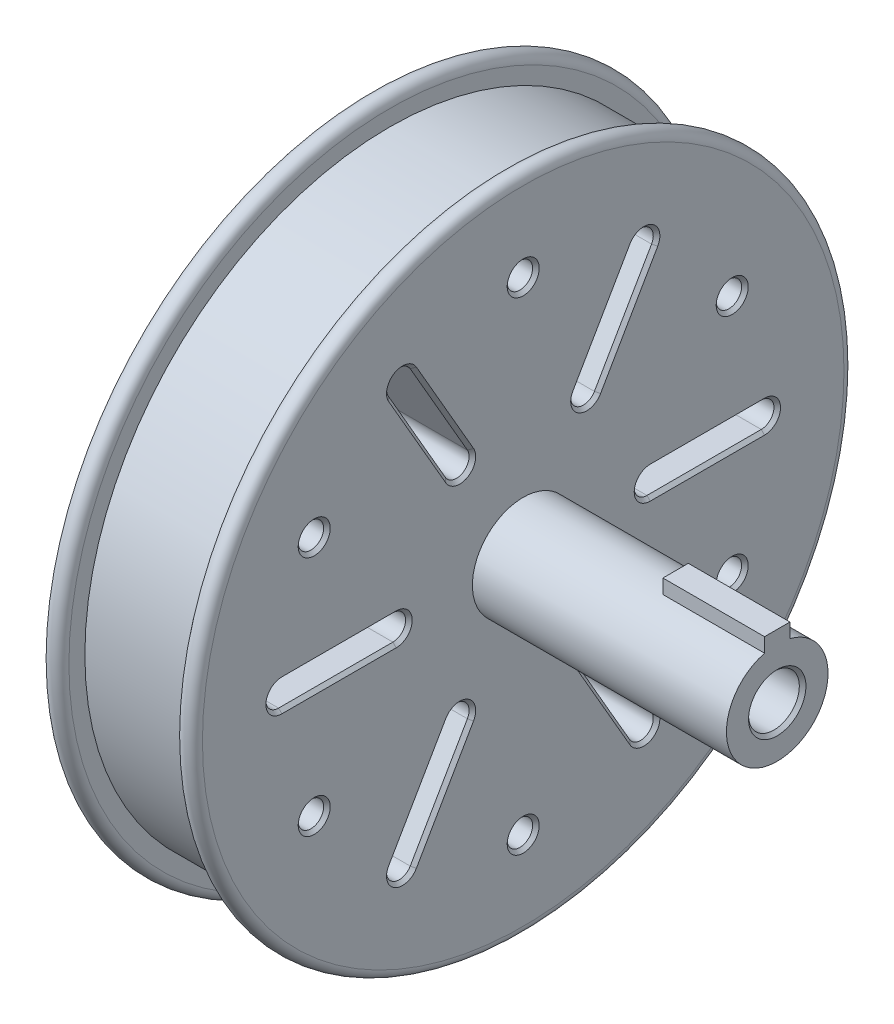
ISO-10303-21;
HEADER;
FILE_DESCRIPTION(('STEP AP214'),'2;1');
FILE_NAME('part.step','',(''),(''),'','','');
FILE_SCHEMA(('AUTOMOTIVE_DESIGN { 1 0 10303 214 1 1 1 1 }'));
ENDSEC;
DATA;
#1=APPLICATION_CONTEXT('core data for automotive mechanical design processes');
#2=APPLICATION_PROTOCOL_DEFINITION('international standard','automotive_design',2000,#1);
#3=PRODUCT_CONTEXT('',#1,'mechanical');
#4=PRODUCT('Part','Part','',(#3));
#5=PRODUCT_RELATED_PRODUCT_CATEGORY('part','',(#4));
#6=PRODUCT_DEFINITION_FORMATION('','',#4);
#7=PRODUCT_DEFINITION_CONTEXT('part definition',#1,'design');
#8=PRODUCT_DEFINITION('design','',#6,#7);
#9=PRODUCT_DEFINITION_SHAPE('','',#8);
#10=(LENGTH_UNIT() NAMED_UNIT(*) SI_UNIT(.MILLI.,.METRE.));
#11=(NAMED_UNIT(*) PLANE_ANGLE_UNIT() SI_UNIT($,.RADIAN.));
#12=(NAMED_UNIT(*) SI_UNIT($,.STERADIAN.) SOLID_ANGLE_UNIT());
#13=UNCERTAINTY_MEASURE_WITH_UNIT(LENGTH_MEASURE(1.E-05),#10,'distance_accuracy_value','');
#14=(GEOMETRIC_REPRESENTATION_CONTEXT(3) GLOBAL_UNCERTAINTY_ASSIGNED_CONTEXT((#13)) GLOBAL_UNIT_ASSIGNED_CONTEXT((#10,
#11,#12)) REPRESENTATION_CONTEXT('',''));
#15=CARTESIAN_POINT('',(0.,0.,0.));
#16=DIRECTION('',(0.,0.,1.));
#17=DIRECTION('',(1.,0.,0.));
#18=AXIS2_PLACEMENT_3D('',#15,#16,#17);
#19=CARTESIAN_POINT('',(63.5,6.35,0.));
#20=DIRECTION('',(1.,0.,0.));
#21=DIRECTION('',(0.,0.,-1.));
#22=AXIS2_PLACEMENT_3D('',#19,#20,#21);
#23=PLANE('',#22);
#24=CARTESIAN_POINT('',(63.5,0.,0.));
#25=DIRECTION('',(1.,0.,0.));
#26=DIRECTION('',(0.,0.,-1.));
#27=AXIS2_PLACEMENT_3D('',#24,#25,#26);
#28=CIRCLE('',#27,7.17549999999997);
#29=CARTESIAN_POINT('',(63.5,0.,-7.17549999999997));
#30=VERTEX_POINT('',#29);
#31=EDGE_CURVE('E11',#30,#30,#28,.F.);
#32=ORIENTED_EDGE('',*,*,#31,.T.);
#33=EDGE_LOOP('',(#32));
#34=FACE_BOUND('',#33,.T.);
#35=CARTESIAN_POINT('',(63.5,0.,0.));
#36=DIRECTION('',(1.,0.,0.));
#37=DIRECTION('',(0.,0.,-1.));
#38=AXIS2_PLACEMENT_3D('',#35,#36,#37);
#39=CIRCLE('',#38,12.7);
#40=CARTESIAN_POINT('',(63.5,12.2967221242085,3.175));
#41=VERTEX_POINT('',#40);
#42=CARTESIAN_POINT('',(63.5,12.2967221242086,-3.175));
#43=VERTEX_POINT('',#42);
#44=EDGE_CURVE('E404',#41,#43,#39,.T.);
#45=ORIENTED_EDGE('',*,*,#44,.T.);
#46=DIRECTION('',(0.,1.,0.));
#47=VECTOR('',#46,1.);
#48=CARTESIAN_POINT('',(63.5,12.2967221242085,-3.175));
#49=LINE('',#48,#47);
#50=CARTESIAN_POINT('',(63.5,15.875,-3.175));
#51=VERTEX_POINT('',#50);
#52=EDGE_CURVE('E389',#43,#51,#49,.T.);
#53=ORIENTED_EDGE('',*,*,#52,.T.);
#54=DIRECTION('',(0.,0.,1.));
#55=VECTOR('',#54,1.);
#56=CARTESIAN_POINT('',(63.5,15.875,3.175));
#57=LINE('',#56,#55);
#58=CARTESIAN_POINT('',(63.5,15.875,3.175));
#59=VERTEX_POINT('',#58);
#60=EDGE_CURVE('E399',#51,#59,#57,.T.);
#61=ORIENTED_EDGE('',*,*,#60,.T.);
#62=DIRECTION('',(0.,-1.,0.));
#63=VECTOR('',#62,1.);
#64=CARTESIAN_POINT('',(63.5,12.2967221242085,3.175));
#65=LINE('',#64,#63);
#66=EDGE_CURVE('E370',#59,#41,#65,.T.);
#67=ORIENTED_EDGE('',*,*,#66,.T.);
#68=EDGE_LOOP('',(#45,#53,#61,#67));
#69=FACE_BOUND('',#68,.T.);
#70=ADVANCED_FACE('F31',(#34,#69),#23,.T.);
#71=CARTESIAN_POINT('',(0.,0.,0.));
#72=DIRECTION('',(1.,0.,0.));
#73=DIRECTION('',(0.,0.,-1.));
#74=AXIS2_PLACEMENT_3D('',#71,#72,#73);
#75=CYLINDRICAL_SURFACE('',#74,6.35);
#76=CARTESIAN_POINT('',(62.6745,0.,0.));
#77=DIRECTION('',(1.,0.,0.));
#78=DIRECTION('',(0.,0.,-1.));
#79=AXIS2_PLACEMENT_3D('',#76,#77,#78);
#80=CIRCLE('',#79,6.35);
#81=CARTESIAN_POINT('',(62.6745,0.,-6.34999999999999));
#82=VERTEX_POINT('',#81);
#83=EDGE_CURVE('E40',#82,#82,#80,.T.);
#84=ORIENTED_EDGE('',*,*,#83,.T.);
#85=EDGE_LOOP('',(#84));
#86=FACE_BOUND('',#85,.T.);
#87=CARTESIAN_POINT('',(-19.05,0.,0.));
#88=DIRECTION('',(1.,0.,0.));
#89=DIRECTION('',(0.,0.,-1.));
#90=AXIS2_PLACEMENT_3D('',#87,#88,#89);
#91=CIRCLE('',#90,6.35);
#92=CARTESIAN_POINT('',(-19.05,0.,-6.35));
#93=VERTEX_POINT('',#92);
#94=EDGE_CURVE('E441',#93,#93,#91,.T.);
#95=ORIENTED_EDGE('',*,*,#94,.F.);
#96=EDGE_LOOP('',(#95));
#97=FACE_BOUND('',#96,.T.);
#98=ADVANCED_FACE('F1046',(#86,#97),#75,.F.);
#99=CARTESIAN_POINT('',(-19.05,22.225,0.));
#100=DIRECTION('',(-1.,0.,0.));
#101=DIRECTION('',(0.,0.,1.));
#102=AXIS2_PLACEMENT_3D('',#99,#100,#101);
#103=PLANE('',#102);
#104=ORIENTED_EDGE('',*,*,#94,.T.);
#105=EDGE_LOOP('',(#104));
#106=FACE_BOUND('',#105,.T.);
#107=CARTESIAN_POINT('',(-19.05,0.,0.));
#108=DIRECTION('',(1.,0.,0.));
#109=DIRECTION('',(0.,0.,-1.));
#110=AXIS2_PLACEMENT_3D('',#107,#108,#109);
#111=CIRCLE('',#110,22.225);
#112=CARTESIAN_POINT('',(-19.05,0.,-22.225));
#113=VERTEX_POINT('',#112);
#114=EDGE_CURVE('E438',#113,#113,#111,.T.);
#115=ORIENTED_EDGE('',*,*,#114,.F.);
#116=EDGE_LOOP('',(#115));
#117=FACE_BOUND('',#116,.T.);
#118=ADVANCED_FACE('F1052',(#106,#117),#103,.T.);
#119=CARTESIAN_POINT('',(0.,0.,0.));
#120=DIRECTION('',(1.,0.,0.));
#121=DIRECTION('',(0.,0.,-1.));
#122=AXIS2_PLACEMENT_3D('',#119,#120,#121);
#123=CYLINDRICAL_SURFACE('',#122,22.225);
#124=ORIENTED_EDGE('',*,*,#114,.T.);
#125=EDGE_LOOP('',(#124));
#126=FACE_BOUND('',#125,.T.);
#127=CARTESIAN_POINT('',(-36.5125,0.,0.));
#128=DIRECTION('',(1.,0.,0.));
#129=DIRECTION('',(0.,0.,-1.));
#130=AXIS2_PLACEMENT_3D('',#127,#128,#129);
#131=CIRCLE('',#130,22.225);
#132=CARTESIAN_POINT('',(-36.5125,0.,-22.225));
#133=VERTEX_POINT('',#132);
#134=EDGE_CURVE('E435',#133,#133,#131,.T.);
#135=ORIENTED_EDGE('',*,*,#134,.F.);
#136=EDGE_LOOP('',(#135));
#137=FACE_BOUND('',#136,.T.);
#138=ADVANCED_FACE('F1969',(#126,#137),#123,.F.);
#139=CARTESIAN_POINT('',(-38.1,0.,0.));
#140=DIRECTION('',(-1.,0.,0.));
#141=DIRECTION('',(0.,0.,1.));
#142=AXIS2_PLACEMENT_3D('',#139,#140,#141);
#143=CONICAL_SURFACE('',#142,23.8125,0.78539816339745);
#144=ORIENTED_EDGE('',*,*,#134,.T.);
#145=EDGE_LOOP('',(#144));
#146=FACE_BOUND('',#145,.T.);
#147=CARTESIAN_POINT('',(-38.1,0.,0.));
#148=DIRECTION('',(1.,0.,0.));
#149=DIRECTION('',(0.,0.,-1.));
#150=AXIS2_PLACEMENT_3D('',#147,#148,#149);
#151=CIRCLE('',#150,23.8125);
#152=CARTESIAN_POINT('',(-38.1,0.,-23.8125));
#153=VERTEX_POINT('',#152);
#154=EDGE_CURVE('E432',#153,#153,#151,.T.);
#155=ORIENTED_EDGE('',*,*,#154,.F.);
#156=EDGE_LOOP('',(#155));
#157=FACE_BOUND('',#156,.T.);
#158=ADVANCED_FACE('F1961',(#146,#157),#143,.F.);
#159=CARTESIAN_POINT('',(-38.1,80.1878,0.));
#160=DIRECTION('',(-1.,0.,0.));
#161=DIRECTION('',(0.,0.,1.));
#162=AXIS2_PLACEMENT_3D('',#159,#160,#161);
#163=PLANE('',#162);
#164=CARTESIAN_POINT('',(-38.1,-30.1624999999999,52.2429824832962));
#165=DIRECTION('',(-1.,0.,0.));
#166=DIRECTION('',(0.,0.,1.));
#167=AXIS2_PLACEMENT_3D('',#164,#165,#166);
#168=CIRCLE('',#167,4.00050000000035);
#169=CARTESIAN_POINT('',(-38.1,-30.1624999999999,56.2434824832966));
#170=VERTEX_POINT('',#169);
#171=EDGE_CURVE('E519',#170,#170,#168,.F.);
#172=ORIENTED_EDGE('',*,*,#171,.T.);
#173=EDGE_LOOP('',(#172));
#174=FACE_BOUND('',#173,.T.);
#175=CARTESIAN_POINT('',(-38.1,-60.3249999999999,0.));
#176=DIRECTION('',(-1.,0.,0.));
#177=DIRECTION('',(0.,0.,1.));
#178=AXIS2_PLACEMENT_3D('',#175,#176,#177);
#179=CIRCLE('',#178,4.00050000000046);
#180=CARTESIAN_POINT('',(-38.1,-60.3249999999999,4.00050000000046));
#181=VERTEX_POINT('',#180);
#182=EDGE_CURVE('E516',#181,#181,#179,.F.);
#183=ORIENTED_EDGE('',*,*,#182,.T.);
#184=EDGE_LOOP('',(#183));
#185=FACE_BOUND('',#184,.T.);
#186=CARTESIAN_POINT('',(-38.1,-30.1624999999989,-52.2429824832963));
#187=DIRECTION('',(-1.,0.,0.));
#188=DIRECTION('',(0.,0.,1.));
#189=AXIS2_PLACEMENT_3D('',#186,#187,#188);
#190=CIRCLE('',#189,4.00049999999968);
#191=CARTESIAN_POINT('',(-38.1,-30.1624999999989,-48.2424824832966));
#192=VERTEX_POINT('',#191);
#193=EDGE_CURVE('E513',#192,#192,#190,.F.);
#194=ORIENTED_EDGE('',*,*,#193,.T.);
#195=EDGE_LOOP('',(#194));
#196=FACE_BOUND('',#195,.T.);
#197=CARTESIAN_POINT('',(-38.1,30.1625,-52.2429824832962));
#198=DIRECTION('',(-1.,0.,0.));
#199=DIRECTION('',(0.,0.,1.));
#200=AXIS2_PLACEMENT_3D('',#197,#198,#199);
#201=CIRCLE('',#200,4.00050000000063);
#202=CARTESIAN_POINT('',(-38.1,30.1625,-48.2424824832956));
#203=VERTEX_POINT('',#202);
#204=EDGE_CURVE('E510',#203,#203,#201,.F.);
#205=ORIENTED_EDGE('',*,*,#204,.T.);
#206=EDGE_LOOP('',(#205));
#207=FACE_BOUND('',#206,.T.);
#208=CARTESIAN_POINT('',(-38.1,60.325,0.));
#209=DIRECTION('',(-1.,0.,0.));
#210=DIRECTION('',(0.,0.,1.));
#211=AXIS2_PLACEMENT_3D('',#208,#209,#210);
#212=CIRCLE('',#211,4.00049999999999);
#213=CARTESIAN_POINT('',(-38.1,60.325,4.00049999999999));
#214=VERTEX_POINT('',#213);
#215=EDGE_CURVE('E507',#214,#214,#212,.F.);
#216=ORIENTED_EDGE('',*,*,#215,.T.);
#217=EDGE_LOOP('',(#216));
#218=FACE_BOUND('',#217,.T.);
#219=CARTESIAN_POINT('',(-38.1,30.1625,52.2429824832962));
#220=DIRECTION('',(-1.,0.,0.));
#221=DIRECTION('',(0.,0.,1.));
#222=AXIS2_PLACEMENT_3D('',#219,#220,#221);
#223=CIRCLE('',#222,4.00050000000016);
#224=CARTESIAN_POINT('',(-38.1,30.1625,56.2434824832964));
#225=VERTEX_POINT('',#224);
#226=EDGE_CURVE('E504',#225,#225,#223,.F.);
#227=ORIENTED_EDGE('',*,*,#226,.T.);
#228=EDGE_LOOP('',(#227));
#229=FACE_BOUND('',#228,.T.);
#230=CARTESIAN_POINT('',(-38.1,-52.2429824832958,30.1624999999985));
#231=DIRECTION('',(-1.,0.,0.));
#232=DIRECTION('',(0.,0.,1.));
#233=AXIS2_PLACEMENT_3D('',#230,#231,#232);
#234=CIRCLE('',#233,4.0005);
#235=CARTESIAN_POINT('',(-38.1,-50.2427324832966,33.6270346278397));
#236=VERTEX_POINT('',#235);
#237=CARTESIAN_POINT('',(-38.1,-54.2432324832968,26.6979653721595));
#238=VERTEX_POINT('',#237);
#239=EDGE_CURVE('E497',#236,#238,#234,.F.);
#240=ORIENTED_EDGE('',*,*,#239,.T.);
#241=DIRECTION('',(0.,0.866025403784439,-0.5));
#242=VECTOR('',#241,1.);
#243=CARTESIAN_POINT('',(-38.1,-29.496556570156,12.4104653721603));
#244=LINE('',#243,#242);
#245=CARTESIAN_POINT('',(-38.1,-29.496556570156,12.4104653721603));
#246=VERTEX_POINT('',#245);
#247=EDGE_CURVE('E501',#238,#246,#244,.T.);
#248=ORIENTED_EDGE('',*,*,#247,.T.);
#249=CARTESIAN_POINT('',(-38.1,-27.496306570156,15.8749999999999));
#250=DIRECTION('',(-1.,0.,0.));
#251=DIRECTION('',(0.,0.,1.));
#252=AXIS2_PLACEMENT_3D('',#249,#250,#251);
#253=CIRCLE('',#252,4.0005);
#254=CARTESIAN_POINT('',(-38.1,-25.496056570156,19.3395346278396));
#255=VERTEX_POINT('',#254);
#256=EDGE_CURVE('E499',#246,#255,#253,.F.);
#257=ORIENTED_EDGE('',*,*,#256,.T.);
#258=DIRECTION('',(0.,-0.866025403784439,0.5));
#259=VECTOR('',#258,1.);
#260=CARTESIAN_POINT('',(-38.1,-50.2427324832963,33.6270346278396));
#261=LINE('',#260,#259);
#262=EDGE_CURVE('E495',#255,#236,#261,.T.);
#263=ORIENTED_EDGE('',*,*,#262,.T.);
#264=EDGE_LOOP('',(#240,#248,#257,#263));
#265=FACE_BOUND('',#264,.T.);
#266=CARTESIAN_POINT('',(-38.1,0.,60.325));
#267=DIRECTION('',(-1.,0.,0.));
#268=DIRECTION('',(0.,0.,1.));
#269=AXIS2_PLACEMENT_3D('',#266,#267,#268);
#270=CIRCLE('',#269,4.00049999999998);
#271=CARTESIAN_POINT('',(-38.1,4.00049999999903,60.3249999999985));
#272=VERTEX_POINT('',#271);
#273=CARTESIAN_POINT('',(-38.1,-4.00049999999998,60.3249999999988));
#274=VERTEX_POINT('',#273);
#275=EDGE_CURVE('E488',#272,#274,#270,.F.);
#276=ORIENTED_EDGE('',*,*,#275,.T.);
#277=DIRECTION('',(0.,0.,-1.));
#278=VECTOR('',#277,1.);
#279=CARTESIAN_POINT('',(-38.1,-4.00050000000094,31.7499999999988));
#280=LINE('',#279,#278);
#281=CARTESIAN_POINT('',(-38.1,-4.00050000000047,31.7499999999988));
#282=VERTEX_POINT('',#281);
#283=EDGE_CURVE('E492',#274,#282,#280,.T.);
#284=ORIENTED_EDGE('',*,*,#283,.T.);
#285=CARTESIAN_POINT('',(-38.1,0.,31.75));
#286=DIRECTION('',(-1.,0.,0.));
#287=DIRECTION('',(0.,0.,1.));
#288=AXIS2_PLACEMENT_3D('',#285,#286,#287);
#289=CIRCLE('',#288,4.00050000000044);
#290=CARTESIAN_POINT('',(-38.1,4.00049999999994,31.75));
#291=VERTEX_POINT('',#290);
#292=EDGE_CURVE('E490',#282,#291,#289,.F.);
#293=ORIENTED_EDGE('',*,*,#292,.T.);
#294=DIRECTION('',(0.,0.,1.));
#295=VECTOR('',#294,1.);
#296=CARTESIAN_POINT('',(-38.1,4.00049999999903,60.3249999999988));
#297=LINE('',#296,#295);
#298=EDGE_CURVE('E486',#291,#272,#297,.T.);
#299=ORIENTED_EDGE('',*,*,#298,.T.);
#300=EDGE_LOOP('',(#276,#284,#293,#299));
#301=FACE_BOUND('',#300,.T.);
#302=CARTESIAN_POINT('',(-38.1,52.2429824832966,30.1624999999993));
#303=DIRECTION('',(-1.,0.,0.));
#304=DIRECTION('',(0.,0.,1.));
#305=AXIS2_PLACEMENT_3D('',#302,#303,#304);
#306=CIRCLE('',#305,4.00050000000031);
#307=CARTESIAN_POINT('',(-38.1,54.2432324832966,26.6979653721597));
#308=VERTEX_POINT('',#307);
#309=CARTESIAN_POINT('',(-38.1,50.2427324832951,33.6270346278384));
#310=VERTEX_POINT('',#309);
#311=EDGE_CURVE('E479',#308,#310,#306,.F.);
#312=ORIENTED_EDGE('',*,*,#311,.T.);
#313=DIRECTION('',(0.,-0.866025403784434,-0.500000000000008));
#314=VECTOR('',#313,1.);
#315=CARTESIAN_POINT('',(-38.1,25.4960565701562,19.3395346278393));
#316=LINE('',#315,#314);
#317=CARTESIAN_POINT('',(-38.1,25.4960565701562,19.3395346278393));
#318=VERTEX_POINT('',#317);
#319=EDGE_CURVE('E483',#310,#318,#316,.T.);
#320=ORIENTED_EDGE('',*,*,#319,.T.);
#321=CARTESIAN_POINT('',(-38.1,27.4963065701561,15.8749999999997));
#322=DIRECTION('',(-1.,0.,0.));
#323=DIRECTION('',(0.,0.,1.));
#324=AXIS2_PLACEMENT_3D('',#321,#322,#323);
#325=CIRCLE('',#324,4.00049999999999);
#326=CARTESIAN_POINT('',(-38.1,29.4965565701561,12.41046537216));
#327=VERTEX_POINT('',#326);
#328=EDGE_CURVE('E481',#318,#327,#325,.F.);
#329=ORIENTED_EDGE('',*,*,#328,.T.);
#330=DIRECTION('',(0.,0.866025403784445,0.499999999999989));
#331=VECTOR('',#330,1.);
#332=CARTESIAN_POINT('',(-38.1,54.2432324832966,26.6979653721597));
#333=LINE('',#332,#331);
#334=EDGE_CURVE('E477',#327,#308,#333,.T.);
#335=ORIENTED_EDGE('',*,*,#334,.T.);
#336=EDGE_LOOP('',(#312,#320,#329,#335));
#337=FACE_BOUND('',#336,.T.);
#338=CARTESIAN_POINT('',(-38.1,52.2429824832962,-30.1625));
#339=DIRECTION('',(-1.,0.,0.));
#340=DIRECTION('',(0.,0.,1.));
#341=AXIS2_PLACEMENT_3D('',#338,#339,#340);
#342=CIRCLE('',#341,4.00049999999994);
#343=CARTESIAN_POINT('',(-38.1,50.2427324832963,-33.6270346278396));
#344=VERTEX_POINT('',#343);
#345=CARTESIAN_POINT('',(-38.1,54.2432324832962,-26.6979653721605));
#346=VERTEX_POINT('',#345);
#347=EDGE_CURVE('E470',#344,#346,#342,.F.);
#348=ORIENTED_EDGE('',*,*,#347,.T.);
#349=DIRECTION('',(0.,-0.866025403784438,0.500000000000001));
#350=VECTOR('',#349,1.);
#351=CARTESIAN_POINT('',(-38.1,29.4965565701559,-12.4104653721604));
#352=LINE('',#351,#350);
#353=CARTESIAN_POINT('',(-38.1,29.4965565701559,-12.4104653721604));
#354=VERTEX_POINT('',#353);
#355=EDGE_CURVE('E474',#346,#354,#352,.T.);
#356=ORIENTED_EDGE('',*,*,#355,.T.);
#357=CARTESIAN_POINT('',(-38.1,27.4963065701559,-15.875));
#358=DIRECTION('',(-1.,0.,0.));
#359=DIRECTION('',(0.,0.,1.));
#360=AXIS2_PLACEMENT_3D('',#357,#358,#359);
#361=CIRCLE('',#360,4.00049999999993);
#362=CARTESIAN_POINT('',(-38.1,25.4960565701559,-19.3395346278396));
#363=VERTEX_POINT('',#362);
#364=EDGE_CURVE('E472',#354,#363,#361,.F.);
#365=ORIENTED_EDGE('',*,*,#364,.T.);
#366=DIRECTION('',(0.,0.866025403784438,-0.500000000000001));
#367=VECTOR('',#366,1.);
#368=CARTESIAN_POINT('',(-38.1,50.2427324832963,-33.6270346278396));
#369=LINE('',#368,#367);
#370=EDGE_CURVE('E468',#363,#344,#369,.T.);
#371=ORIENTED_EDGE('',*,*,#370,.T.);
#372=EDGE_LOOP('',(#348,#356,#365,#371));
#373=FACE_BOUND('',#372,.T.);
#374=CARTESIAN_POINT('',(-38.1,-1.90819582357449E-13,-60.325));
#375=DIRECTION('',(-1.,0.,0.));
#376=DIRECTION('',(0.,0.,1.));
#377=AXIS2_PLACEMENT_3D('',#374,#375,#376);
#378=CIRCLE('',#377,4.00049999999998);
#379=CARTESIAN_POINT('',(-38.1,-4.00049999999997,-60.3250000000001));
#380=VERTEX_POINT('',#379);
#381=CARTESIAN_POINT('',(-38.1,4.00049999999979,-60.3250000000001));
#382=VERTEX_POINT('',#381);
#383=EDGE_CURVE('E461',#380,#382,#378,.F.);
#384=ORIENTED_EDGE('',*,*,#383,.T.);
#385=DIRECTION('',(0.,0.,1.));
#386=VECTOR('',#385,1.);
#387=CARTESIAN_POINT('',(-38.1,4.00050000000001,-31.75));
#388=LINE('',#387,#386);
#389=CARTESIAN_POINT('',(-38.1,4.0005,-31.75));
#390=VERTEX_POINT('',#389);
#391=EDGE_CURVE('E465',#382,#390,#388,.T.);
#392=ORIENTED_EDGE('',*,*,#391,.T.);
#393=CARTESIAN_POINT('',(-38.1,0.,-31.75));
#394=DIRECTION('',(-1.,0.,0.));
#395=DIRECTION('',(0.,0.,1.));
#396=AXIS2_PLACEMENT_3D('',#393,#394,#395);
#397=CIRCLE('',#396,4.00049999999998);
#398=CARTESIAN_POINT('',(-38.1,-4.00049999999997,-31.75));
#399=VERTEX_POINT('',#398);
#400=EDGE_CURVE('E463',#390,#399,#397,.F.);
#401=ORIENTED_EDGE('',*,*,#400,.T.);
#402=DIRECTION('',(0.,0.,-1.));
#403=VECTOR('',#402,1.);
#404=CARTESIAN_POINT('',(-38.1,-4.00049999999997,-60.3250000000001));
#405=LINE('',#404,#403);
#406=EDGE_CURVE('E459',#399,#380,#405,.T.);
#407=ORIENTED_EDGE('',*,*,#406,.T.);
#408=EDGE_LOOP('',(#384,#392,#401,#407));
#409=FACE_BOUND('',#408,.T.);
#410=CARTESIAN_POINT('',(-38.1,-52.2429824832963,-30.1625));
#411=DIRECTION('',(-1.,0.,0.));
#412=DIRECTION('',(0.,0.,1.));
#413=AXIS2_PLACEMENT_3D('',#410,#411,#412);
#414=CIRCLE('',#413,4.0005);
#415=CARTESIAN_POINT('',(-38.1,-54.2432324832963,-26.6979653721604));
#416=VERTEX_POINT('',#415);
#417=CARTESIAN_POINT('',(-38.1,-50.2427324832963,-33.6270346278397));
#418=VERTEX_POINT('',#417);
#419=EDGE_CURVE('E452',#416,#418,#414,.F.);
#420=ORIENTED_EDGE('',*,*,#419,.T.);
#421=DIRECTION('',(0.,0.866025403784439,0.5));
#422=VECTOR('',#421,1.);
#423=CARTESIAN_POINT('',(-38.1,-25.4960565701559,-19.3395346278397));
#424=LINE('',#423,#422);
#425=CARTESIAN_POINT('',(-38.1,-25.4960565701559,-19.3395346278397));
#426=VERTEX_POINT('',#425);
#427=EDGE_CURVE('E456',#418,#426,#424,.T.);
#428=ORIENTED_EDGE('',*,*,#427,.T.);
#429=CARTESIAN_POINT('',(-38.1,-27.4963065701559,-15.8750000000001));
#430=DIRECTION('',(-1.,0.,0.));
#431=DIRECTION('',(0.,0.,1.));
#432=AXIS2_PLACEMENT_3D('',#429,#430,#431);
#433=CIRCLE('',#432,4.0005);
#434=CARTESIAN_POINT('',(-38.1,-29.4965565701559,-12.4104653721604));
#435=VERTEX_POINT('',#434);
#436=EDGE_CURVE('E454',#426,#435,#433,.F.);
#437=ORIENTED_EDGE('',*,*,#436,.T.);
#438=DIRECTION('',(0.,-0.866025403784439,-0.5));
#439=VECTOR('',#438,1.);
#440=CARTESIAN_POINT('',(-38.1,-54.2432324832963,-26.6979653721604));
#441=LINE('',#440,#439);
#442=EDGE_CURVE('E450',#435,#416,#441,.T.);
#443=ORIENTED_EDGE('',*,*,#442,.T.);
#444=EDGE_LOOP('',(#420,#428,#437,#443));
#445=FACE_BOUND('',#444,.T.);
#446=ORIENTED_EDGE('',*,*,#154,.T.);
#447=EDGE_LOOP('',(#446));
#448=FACE_BOUND('',#447,.T.);
#449=CARTESIAN_POINT('',(-38.1,0.,0.));
#450=DIRECTION('',(1.,0.,0.));
#451=DIRECTION('',(0.,0.,-1.));
#452=AXIS2_PLACEMENT_3D('',#449,#450,#451);
#453=CIRCLE('',#452,80.1878);
#454=CARTESIAN_POINT('',(-38.1,0.,-80.1878));
#455=VERTEX_POINT('',#454);
#456=EDGE_CURVE('E429',#455,#455,#453,.T.);
#457=ORIENTED_EDGE('',*,*,#456,.F.);
#458=EDGE_LOOP('',(#457));
#459=FACE_BOUND('',#458,.T.);
#460=ADVANCED_FACE('F1025',(#174,#185,#196,#207,#218,#229,#265,#301,#337,#373,#409,#445,#448,
#459),#163,.T.);
#461=CARTESIAN_POINT('',(-35.7378,0.,0.));
#462=DIRECTION('',(1.,0.,0.));
#463=DIRECTION('',(0.,0.,-1.));
#464=AXIS2_PLACEMENT_3D('',#461,#462,#463);
#465=TOROIDAL_SURFACE('',#464,80.1878,2.36219999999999);
#466=ORIENTED_EDGE('',*,*,#456,.T.);
#467=EDGE_LOOP('',(#466));
#468=FACE_BOUND('',#467,.T.);
#469=CARTESIAN_POINT('',(-33.3756,0.,0.));
#470=DIRECTION('',(1.,0.,0.));
#471=DIRECTION('',(0.,0.,-1.));
#472=AXIS2_PLACEMENT_3D('',#469,#470,#471);
#473=CIRCLE('',#472,80.1878);
#474=CARTESIAN_POINT('',(-33.3756,0.,-80.1878));
#475=VERTEX_POINT('',#474);
#476=EDGE_CURVE('E426',#475,#475,#473,.T.);
#477=ORIENTED_EDGE('',*,*,#476,.F.);
#478=EDGE_LOOP('',(#477));
#479=FACE_BOUND('',#478,.T.);
#480=ADVANCED_FACE('F1944',(#468,#479),#465,.T.);
#481=CARTESIAN_POINT('',(-33.3756,76.2,0.));
#482=DIRECTION('',(1.,0.,0.));
#483=DIRECTION('',(0.,0.,-1.));
#484=AXIS2_PLACEMENT_3D('',#481,#482,#483);
#485=PLANE('',#484);
#486=ORIENTED_EDGE('',*,*,#476,.T.);
#487=EDGE_LOOP('',(#486));
#488=FACE_BOUND('',#487,.T.);
#489=CARTESIAN_POINT('',(-33.3756,0.,0.));
#490=DIRECTION('',(1.,0.,0.));
#491=DIRECTION('',(0.,0.,-1.));
#492=AXIS2_PLACEMENT_3D('',#489,#490,#491);
#493=CIRCLE('',#492,76.2);
#494=CARTESIAN_POINT('',(-33.3756,0.,-76.2));
#495=VERTEX_POINT('',#494);
#496=EDGE_CURVE('E423',#495,#495,#493,.T.);
#497=ORIENTED_EDGE('',*,*,#496,.F.);
#498=EDGE_LOOP('',(#497));
#499=FACE_BOUND('',#498,.T.);
#500=ADVANCED_FACE('F1935',(#488,#499),#485,.T.);
#501=CARTESIAN_POINT('',(0.,0.,0.));
#502=DIRECTION('',(1.,0.,0.));
#503=DIRECTION('',(0.,0.,-1.));
#504=AXIS2_PLACEMENT_3D('',#501,#502,#503);
#505=CYLINDRICAL_SURFACE('',#504,76.2);
#506=ORIENTED_EDGE('',*,*,#496,.T.);
#507=EDGE_LOOP('',(#506));
#508=FACE_BOUND('',#507,.T.);
#509=CARTESIAN_POINT('',(-4.7244,0.,0.));
#510=DIRECTION('',(1.,0.,0.));
#511=DIRECTION('',(0.,0.,-1.));
#512=AXIS2_PLACEMENT_3D('',#509,#510,#511);
#513=CIRCLE('',#512,76.2);
#514=CARTESIAN_POINT('',(-4.7244,0.,-76.2));
#515=VERTEX_POINT('',#514);
#516=EDGE_CURVE('E420',#515,#515,#513,.T.);
#517=ORIENTED_EDGE('',*,*,#516,.F.);
#518=EDGE_LOOP('',(#517));
#519=FACE_BOUND('',#518,.T.);
#520=ADVANCED_FACE('F1926',(#508,#519),#505,.T.);
#521=CARTESIAN_POINT('',(-4.7244,80.1878,0.));
#522=DIRECTION('',(-1.,0.,0.));
#523=DIRECTION('',(0.,0.,1.));
#524=AXIS2_PLACEMENT_3D('',#521,#522,#523);
#525=PLANE('',#524);
#526=ORIENTED_EDGE('',*,*,#516,.T.);
#527=EDGE_LOOP('',(#526));
#528=FACE_BOUND('',#527,.T.);
#529=CARTESIAN_POINT('',(-4.7244,0.,0.));
#530=DIRECTION('',(1.,0.,0.));
#531=DIRECTION('',(0.,0.,-1.));
#532=AXIS2_PLACEMENT_3D('',#529,#530,#531);
#533=CIRCLE('',#532,80.1878);
#534=CARTESIAN_POINT('',(-4.7244,0.,-80.1878));
#535=VERTEX_POINT('',#534);
#536=EDGE_CURVE('E417',#535,#535,#533,.T.);
#537=ORIENTED_EDGE('',*,*,#536,.F.);
#538=EDGE_LOOP('',(#537));
#539=FACE_BOUND('',#538,.T.);
#540=ADVANCED_FACE('F1917',(#528,#539),#525,.T.);
#541=CARTESIAN_POINT('',(-2.3622,0.,0.));
#542=DIRECTION('',(1.,0.,0.));
#543=DIRECTION('',(0.,0.,-1.));
#544=AXIS2_PLACEMENT_3D('',#541,#542,#543);
#545=TOROIDAL_SURFACE('',#544,80.1878,2.3622);
#546=ORIENTED_EDGE('',*,*,#536,.T.);
#547=EDGE_LOOP('',(#546));
#548=FACE_BOUND('',#547,.T.);
#549=CARTESIAN_POINT('',(0.,0.,0.));
#550=DIRECTION('',(1.,0.,0.));
#551=DIRECTION('',(0.,0.,-1.));
#552=AXIS2_PLACEMENT_3D('',#549,#550,#551);
#553=CIRCLE('',#552,80.1878);
#554=CARTESIAN_POINT('',(0.,0.,-80.1878));
#555=VERTEX_POINT('',#554);
#556=EDGE_CURVE('E414',#555,#555,#553,.T.);
#557=ORIENTED_EDGE('',*,*,#556,.F.);
#558=EDGE_LOOP('',(#557));
#559=FACE_BOUND('',#558,.T.);
#560=ADVANCED_FACE('F972',(#548,#559),#545,.T.);
#561=CARTESIAN_POINT('',(0.,12.7,0.));
#562=DIRECTION('',(1.,0.,0.));
#563=DIRECTION('',(0.,0.,-1.));
#564=AXIS2_PLACEMENT_3D('',#561,#562,#563);
#565=PLANE('',#564);
#566=CARTESIAN_POINT('',(0.,-30.1624999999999,52.2429824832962));
#567=DIRECTION('',(1.,0.,0.));
#568=DIRECTION('',(0.,0.,-1.));
#569=AXIS2_PLACEMENT_3D('',#566,#567,#568);
#570=CIRCLE('',#569,4.0005000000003);
#571=CARTESIAN_POINT('',(0.,-30.1624999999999,48.2424824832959));
#572=VERTEX_POINT('',#571);
#573=EDGE_CURVE('E591',#572,#572,#570,.F.);
#574=ORIENTED_EDGE('',*,*,#573,.T.);
#575=EDGE_LOOP('',(#574));
#576=FACE_BOUND('',#575,.T.);
#577=CARTESIAN_POINT('',(0.,-60.3249999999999,0.));
#578=DIRECTION('',(1.,0.,0.));
#579=DIRECTION('',(0.,0.,-1.));
#580=AXIS2_PLACEMENT_3D('',#577,#578,#579);
#581=CIRCLE('',#580,4.00050000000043);
#582=CARTESIAN_POINT('',(0.,-60.3249999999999,-4.00050000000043));
#583=VERTEX_POINT('',#582);
#584=EDGE_CURVE('E588',#583,#583,#581,.F.);
#585=ORIENTED_EDGE('',*,*,#584,.T.);
#586=EDGE_LOOP('',(#585));
#587=FACE_BOUND('',#586,.T.);
#588=CARTESIAN_POINT('',(0.,-30.1624999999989,-52.2429824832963));
#589=DIRECTION('',(1.,0.,0.));
#590=DIRECTION('',(0.,0.,-1.));
#591=AXIS2_PLACEMENT_3D('',#588,#589,#590);
#592=CIRCLE('',#591,4.00049999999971);
#593=CARTESIAN_POINT('',(0.,-30.1624999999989,-56.243482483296));
#594=VERTEX_POINT('',#593);
#595=EDGE_CURVE('E585',#594,#594,#592,.F.);
#596=ORIENTED_EDGE('',*,*,#595,.T.);
#597=EDGE_LOOP('',(#596));
#598=FACE_BOUND('',#597,.T.);
#599=CARTESIAN_POINT('',(0.,30.1625,-52.2429824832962));
#600=DIRECTION('',(1.,0.,0.));
#601=DIRECTION('',(0.,0.,-1.));
#602=AXIS2_PLACEMENT_3D('',#599,#600,#601);
#603=CIRCLE('',#602,4.00050000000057);
#604=CARTESIAN_POINT('',(0.,30.1625,-56.2434824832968));
#605=VERTEX_POINT('',#604);
#606=EDGE_CURVE('E582',#605,#605,#603,.F.);
#607=ORIENTED_EDGE('',*,*,#606,.T.);
#608=EDGE_LOOP('',(#607));
#609=FACE_BOUND('',#608,.T.);
#610=CARTESIAN_POINT('',(0.,60.325,0.));
#611=DIRECTION('',(1.,0.,0.));
#612=DIRECTION('',(0.,0.,-1.));
#613=AXIS2_PLACEMENT_3D('',#610,#611,#612);
#614=CIRCLE('',#613,4.00049999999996);
#615=CARTESIAN_POINT('',(0.,60.325,-4.00049999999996));
#616=VERTEX_POINT('',#615);
#617=EDGE_CURVE('E579',#616,#616,#614,.F.);
#618=ORIENTED_EDGE('',*,*,#617,.T.);
#619=EDGE_LOOP('',(#618));
#620=FACE_BOUND('',#619,.T.);
#621=CARTESIAN_POINT('',(0.,30.1625,52.2429824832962));
#622=DIRECTION('',(1.,0.,0.));
#623=DIRECTION('',(0.,0.,-1.));
#624=AXIS2_PLACEMENT_3D('',#621,#622,#623);
#625=CIRCLE('',#624,4.0005000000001);
#626=CARTESIAN_POINT('',(0.,30.1625,48.2424824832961));
#627=VERTEX_POINT('',#626);
#628=EDGE_CURVE('E576',#627,#627,#625,.F.);
#629=ORIENTED_EDGE('',*,*,#628,.T.);
#630=EDGE_LOOP('',(#629));
#631=FACE_BOUND('',#630,.T.);
#632=CARTESIAN_POINT('',(0.,-27.496306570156,15.8749999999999));
#633=DIRECTION('',(1.,0.,0.));
#634=DIRECTION('',(0.,0.,-1.));
#635=AXIS2_PLACEMENT_3D('',#632,#633,#634);
#636=CIRCLE('',#635,4.00050000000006);
#637=CARTESIAN_POINT('',(0.,-25.4960565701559,19.3395346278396));
#638=VERTEX_POINT('',#637);
#639=CARTESIAN_POINT('',(0.,-29.496556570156,12.4104653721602));
#640=VERTEX_POINT('',#639);
#641=EDGE_CURVE('E571',#638,#640,#636,.F.);
#642=ORIENTED_EDGE('',*,*,#641,.T.);
#643=DIRECTION('',(0.,-0.866025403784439,0.5));
#644=VECTOR('',#643,1.);
#645=CARTESIAN_POINT('',(0.,-54.2432324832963,26.6979653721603));
#646=LINE('',#645,#644);
#647=CARTESIAN_POINT('',(0.,-54.2432324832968,26.6979653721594));
#648=VERTEX_POINT('',#647);
#649=EDGE_CURVE('E573',#640,#648,#646,.T.);
#650=ORIENTED_EDGE('',*,*,#649,.T.);
#651=CARTESIAN_POINT('',(0.,-52.2429824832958,30.1624999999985));
#652=DIRECTION('',(1.,0.,0.));
#653=DIRECTION('',(0.,0.,-1.));
#654=AXIS2_PLACEMENT_3D('',#651,#652,#653);
#655=CIRCLE('',#654,4.00050000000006);
#656=CARTESIAN_POINT('',(0.,-50.2427324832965,33.6270346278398));
#657=VERTEX_POINT('',#656);
#658=EDGE_CURVE('E569',#648,#657,#655,.F.);
#659=ORIENTED_EDGE('',*,*,#658,.T.);
#660=DIRECTION('',(0.,0.866025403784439,-0.5));
#661=VECTOR('',#660,1.);
#662=CARTESIAN_POINT('',(0.,-25.4960565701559,19.3395346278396));
#663=LINE('',#662,#661);
#664=EDGE_CURVE('E567',#657,#638,#663,.T.);
#665=ORIENTED_EDGE('',*,*,#664,.T.);
#666=EDGE_LOOP('',(#642,#650,#659,#665));
#667=FACE_BOUND('',#666,.T.);
#668=CARTESIAN_POINT('',(0.,-27.4963065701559,-15.8750000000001));
#669=DIRECTION('',(1.,0.,0.));
#670=DIRECTION('',(0.,0.,-1.));
#671=AXIS2_PLACEMENT_3D('',#668,#669,#670);
#672=CIRCLE('',#671,4.0005);
#673=CARTESIAN_POINT('',(0.,-29.4965565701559,-12.4104653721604));
#674=VERTEX_POINT('',#673);
#675=CARTESIAN_POINT('',(0.,-25.4960565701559,-19.3395346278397));
#676=VERTEX_POINT('',#675);
#677=EDGE_CURVE('E562',#674,#676,#672,.F.);
#678=ORIENTED_EDGE('',*,*,#677,.T.);
#679=DIRECTION('',(0.,-0.866025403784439,-0.5));
#680=VECTOR('',#679,1.);
#681=CARTESIAN_POINT('',(0.,-50.2427324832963,-33.6270346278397));
#682=LINE('',#681,#680);
#683=CARTESIAN_POINT('',(0.,-50.2427324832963,-33.6270346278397));
#684=VERTEX_POINT('',#683);
#685=EDGE_CURVE('E564',#676,#684,#682,.T.);
#686=ORIENTED_EDGE('',*,*,#685,.T.);
#687=CARTESIAN_POINT('',(0.,-52.2429824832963,-30.1625));
#688=DIRECTION('',(1.,0.,0.));
#689=DIRECTION('',(0.,0.,-1.));
#690=AXIS2_PLACEMENT_3D('',#687,#688,#689);
#691=CIRCLE('',#690,4.0005);
#692=CARTESIAN_POINT('',(0.,-54.2432324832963,-26.6979653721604));
#693=VERTEX_POINT('',#692);
#694=EDGE_CURVE('E560',#684,#693,#691,.F.);
#695=ORIENTED_EDGE('',*,*,#694,.T.);
#696=DIRECTION('',(0.,0.866025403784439,0.5));
#697=VECTOR('',#696,1.);
#698=CARTESIAN_POINT('',(0.,-29.4965565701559,-12.4104653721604));
#699=LINE('',#698,#697);
#700=EDGE_CURVE('E558',#693,#674,#699,.T.);
#701=ORIENTED_EDGE('',*,*,#700,.T.);
#702=EDGE_LOOP('',(#678,#686,#695,#701));
#703=FACE_BOUND('',#702,.T.);
#704=CARTESIAN_POINT('',(0.,-1.90819582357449E-13,-60.325));
#705=DIRECTION('',(1.,0.,0.));
#706=DIRECTION('',(0.,0.,-1.));
#707=AXIS2_PLACEMENT_3D('',#704,#705,#706);
#708=CIRCLE('',#707,4.00050000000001);
#709=CARTESIAN_POINT('',(0.,4.00050000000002,-60.3250000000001));
#710=VERTEX_POINT('',#709);
#711=CARTESIAN_POINT('',(0.,-4.0005000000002,-60.3250000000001));
#712=VERTEX_POINT('',#711);
#713=EDGE_CURVE('E553',#710,#712,#708,.F.);
#714=ORIENTED_EDGE('',*,*,#713,.T.);
#715=DIRECTION('',(0.,0.,1.));
#716=VECTOR('',#715,1.);
#717=CARTESIAN_POINT('',(0.,-4.00049999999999,-31.75));
#718=LINE('',#717,#716);
#719=CARTESIAN_POINT('',(0.,-4.00049999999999,-31.75));
#720=VERTEX_POINT('',#719);
#721=EDGE_CURVE('E555',#712,#720,#718,.T.);
#722=ORIENTED_EDGE('',*,*,#721,.T.);
#723=CARTESIAN_POINT('',(0.,0.,-31.75));
#724=DIRECTION('',(1.,0.,0.));
#725=DIRECTION('',(0.,0.,-1.));
#726=AXIS2_PLACEMENT_3D('',#723,#724,#725);
#727=CIRCLE('',#726,4.00050000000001);
#728=CARTESIAN_POINT('',(0.,4.00050000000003,-31.75));
#729=VERTEX_POINT('',#728);
#730=EDGE_CURVE('E551',#720,#729,#727,.F.);
#731=ORIENTED_EDGE('',*,*,#730,.T.);
#732=DIRECTION('',(0.,0.,-1.));
#733=VECTOR('',#732,1.);
#734=CARTESIAN_POINT('',(0.,4.00050000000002,-60.3250000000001));
#735=LINE('',#734,#733);
#736=EDGE_CURVE('E549',#729,#710,#735,.T.);
#737=ORIENTED_EDGE('',*,*,#736,.T.);
#738=EDGE_LOOP('',(#714,#722,#731,#737));
#739=FACE_BOUND('',#738,.T.);
#740=CARTESIAN_POINT('',(0.,52.2429824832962,-30.1625));
#741=DIRECTION('',(1.,0.,0.));
#742=DIRECTION('',(0.,0.,-1.));
#743=AXIS2_PLACEMENT_3D('',#740,#741,#742);
#744=CIRCLE('',#743,4.0005);
#745=CARTESIAN_POINT('',(0.,54.2432324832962,-26.6979653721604));
#746=VERTEX_POINT('',#745);
#747=CARTESIAN_POINT('',(0.,50.2427324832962,-33.6270346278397));
#748=VERTEX_POINT('',#747);
#749=EDGE_CURVE('E544',#746,#748,#744,.F.);
#750=ORIENTED_EDGE('',*,*,#749,.T.);
#751=DIRECTION('',(0.,-0.866025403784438,0.500000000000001));
#752=VECTOR('',#751,1.);
#753=CARTESIAN_POINT('',(0.,25.4960565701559,-19.3395346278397));
#754=LINE('',#753,#752);
#755=CARTESIAN_POINT('',(0.,25.4960565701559,-19.3395346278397));
#756=VERTEX_POINT('',#755);
#757=EDGE_CURVE('E546',#748,#756,#754,.T.);
#758=ORIENTED_EDGE('',*,*,#757,.T.);
#759=CARTESIAN_POINT('',(0.,27.4963065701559,-15.875));
#760=DIRECTION('',(1.,0.,0.));
#761=DIRECTION('',(0.,0.,-1.));
#762=AXIS2_PLACEMENT_3D('',#759,#760,#761);
#763=CIRCLE('',#762,4.0005);
#764=CARTESIAN_POINT('',(0.,29.4965565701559,-12.4104653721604));
#765=VERTEX_POINT('',#764);
#766=EDGE_CURVE('E542',#756,#765,#763,.F.);
#767=ORIENTED_EDGE('',*,*,#766,.T.);
#768=DIRECTION('',(0.,0.866025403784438,-0.500000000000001));
#769=VECTOR('',#768,1.);
#770=CARTESIAN_POINT('',(0.,54.2432324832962,-26.6979653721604));
#771=LINE('',#770,#769);
#772=EDGE_CURVE('E540',#765,#746,#771,.T.);
#773=ORIENTED_EDGE('',*,*,#772,.T.);
#774=EDGE_LOOP('',(#750,#758,#767,#773));
#775=FACE_BOUND('',#774,.T.);
#776=CARTESIAN_POINT('',(0.,52.2429824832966,30.1624999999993));
#777=DIRECTION('',(1.,0.,0.));
#778=DIRECTION('',(0.,0.,-1.));
#779=AXIS2_PLACEMENT_3D('',#776,#777,#778);
#780=CIRCLE('',#779,4.00050000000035);
#781=CARTESIAN_POINT('',(0.,50.2427324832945,33.6270346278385));
#782=VERTEX_POINT('',#781);
#783=CARTESIAN_POINT('',(0.,54.2432324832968,26.6979653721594));
#784=VERTEX_POINT('',#783);
#785=EDGE_CURVE('E535',#782,#784,#780,.F.);
#786=ORIENTED_EDGE('',*,*,#785,.T.);
#787=DIRECTION('',(0.,-0.866025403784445,-0.499999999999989));
#788=VECTOR('',#787,1.);
#789=CARTESIAN_POINT('',(0.,29.4965565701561,12.41046537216));
#790=LINE('',#789,#788);
#791=CARTESIAN_POINT('',(0.,29.4965565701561,12.41046537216));
#792=VERTEX_POINT('',#791);
#793=EDGE_CURVE('E537',#784,#792,#790,.T.);
#794=ORIENTED_EDGE('',*,*,#793,.T.);
#795=CARTESIAN_POINT('',(0.,27.4963065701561,15.8749999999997));
#796=DIRECTION('',(1.,0.,0.));
#797=DIRECTION('',(0.,0.,-1.));
#798=AXIS2_PLACEMENT_3D('',#795,#796,#797);
#799=CIRCLE('',#798,4.00050000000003);
#800=CARTESIAN_POINT('',(0.,25.4960565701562,19.3395346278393));
#801=VERTEX_POINT('',#800);
#802=EDGE_CURVE('E533',#792,#801,#799,.F.);
#803=ORIENTED_EDGE('',*,*,#802,.T.);
#804=DIRECTION('',(0.,0.866025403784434,0.500000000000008));
#805=VECTOR('',#804,1.);
#806=CARTESIAN_POINT('',(0.,50.2427324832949,33.6270346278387));
#807=LINE('',#806,#805);
#808=EDGE_CURVE('E531',#801,#782,#807,.T.);
#809=ORIENTED_EDGE('',*,*,#808,.T.);
#810=EDGE_LOOP('',(#786,#794,#803,#809));
#811=FACE_BOUND('',#810,.T.);
#812=CARTESIAN_POINT('',(0.,0.,60.325));
#813=DIRECTION('',(1.,0.,0.));
#814=DIRECTION('',(0.,0.,-1.));
#815=AXIS2_PLACEMENT_3D('',#812,#813,#814);
#816=CIRCLE('',#815,4.00050000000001);
#817=CARTESIAN_POINT('',(0.,-4.00050000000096,60.3249999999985));
#818=VERTEX_POINT('',#817);
#819=CARTESIAN_POINT('',(0.,4.00050000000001,60.3249999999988));
#820=VERTEX_POINT('',#819);
#821=EDGE_CURVE('E526',#818,#820,#816,.F.);
#822=ORIENTED_EDGE('',*,*,#821,.T.);
#823=DIRECTION('',(0.,0.,-1.));
#824=VECTOR('',#823,1.);
#825=CARTESIAN_POINT('',(0.,4.00049999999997,31.75));
#826=LINE('',#825,#824);
#827=CARTESIAN_POINT('',(0.,4.00050000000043,31.75));
#828=VERTEX_POINT('',#827);
#829=EDGE_CURVE('E528',#820,#828,#826,.T.);
#830=ORIENTED_EDGE('',*,*,#829,.T.);
#831=CARTESIAN_POINT('',(0.,0.,31.75));
#832=DIRECTION('',(1.,0.,0.));
#833=DIRECTION('',(0.,0.,-1.));
#834=AXIS2_PLACEMENT_3D('',#831,#832,#833);
#835=CIRCLE('',#834,4.00050000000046);
#836=CARTESIAN_POINT('',(0.,-4.00050000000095,31.7499999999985));
#837=VERTEX_POINT('',#836);
#838=EDGE_CURVE('E524',#828,#837,#835,.F.);
#839=ORIENTED_EDGE('',*,*,#838,.T.);
#840=DIRECTION('',(0.,0.,1.));
#841=VECTOR('',#840,1.);
#842=CARTESIAN_POINT('',(0.,-4.00050000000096,60.3249999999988));
#843=LINE('',#842,#841);
#844=EDGE_CURVE('E522',#837,#818,#843,.T.);
#845=ORIENTED_EDGE('',*,*,#844,.T.);
#846=EDGE_LOOP('',(#822,#830,#839,#845));
#847=FACE_BOUND('',#846,.T.);
#848=ORIENTED_EDGE('',*,*,#556,.T.);
#849=EDGE_LOOP('',(#848));
#850=FACE_BOUND('',#849,.T.);
#851=CARTESIAN_POINT('',(0.,0.,0.));
#852=DIRECTION('',(1.,0.,0.));
#853=DIRECTION('',(0.,0.,-1.));
#854=AXIS2_PLACEMENT_3D('',#851,#852,#853);
#855=CIRCLE('',#854,12.7);
#856=CARTESIAN_POINT('',(0.,0.,-12.7));
#857=VERTEX_POINT('',#856);
#858=EDGE_CURVE('E411',#857,#857,#855,.T.);
#859=ORIENTED_EDGE('',*,*,#858,.F.);
#860=EDGE_LOOP('',(#859));
#861=FACE_BOUND('',#860,.T.);
#862=ADVANCED_FACE('F863',(#576,#587,#598,#609,#620,#631,#667,#703,#739,#775,#811,#847,#850,
#861),#565,.T.);
#863=CARTESIAN_POINT('',(0.,0.,0.));
#864=DIRECTION('',(1.,0.,0.));
#865=DIRECTION('',(0.,0.,-1.));
#866=AXIS2_PLACEMENT_3D('',#863,#864,#865);
#867=CYLINDRICAL_SURFACE('',#866,12.7);
#868=DIRECTION('',(1.,0.,0.));
#869=VECTOR('',#868,1.);
#870=CARTESIAN_POINT('',(38.1,12.2967221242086,-3.175));
#871=LINE('',#870,#869);
#872=CARTESIAN_POINT('',(38.1,12.2967221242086,-3.175));
#873=VERTEX_POINT('',#872);
#874=EDGE_CURVE('E405',#873,#43,#871,.T.);
#875=ORIENTED_EDGE('',*,*,#874,.T.);
#876=ORIENTED_EDGE('',*,*,#44,.F.);
#877=DIRECTION('',(1.,0.,0.));
#878=VECTOR('',#877,1.);
#879=CARTESIAN_POINT('',(38.1,12.2967221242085,3.175));
#880=LINE('',#879,#878);
#881=CARTESIAN_POINT('',(38.1,12.2967221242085,3.175));
#882=VERTEX_POINT('',#881);
#883=EDGE_CURVE('E375',#882,#41,#880,.T.);
#884=ORIENTED_EDGE('',*,*,#883,.F.);
#885=CARTESIAN_POINT('',(38.1,0.,0.));
#886=DIRECTION('',(-1.,0.,0.));
#887=DIRECTION('',(0.,0.,-1.));
#888=AXIS2_PLACEMENT_3D('',#885,#886,#887);
#889=CIRCLE('',#888,12.7);
#890=EDGE_CURVE('E385',#882,#873,#889,.T.);
#891=ORIENTED_EDGE('',*,*,#890,.T.);
#892=EDGE_LOOP('',(#875,#876,#884,#891));
#893=FACE_BOUND('',#892,.T.);
#894=ORIENTED_EDGE('',*,*,#858,.T.);
#895=EDGE_LOOP('',(#894));
#896=FACE_BOUND('',#895,.T.);
#897=ADVANCED_FACE('F971',(#893,#896),#867,.T.);
#898=CARTESIAN_POINT('',(38.1,15.875,3.175));
#899=DIRECTION('',(0.,1.,0.));
#900=DIRECTION('',(0.,0.,1.));
#901=AXIS2_PLACEMENT_3D('',#898,#899,#900);
#902=PLANE('',#901);
#903=ORIENTED_EDGE('',*,*,#60,.F.);
#904=DIRECTION('',(1.,0.,0.));
#905=VECTOR('',#904,1.);
#906=CARTESIAN_POINT('',(38.1,15.875,-3.175));
#907=LINE('',#906,#905);
#908=CARTESIAN_POINT('',(38.1,15.875,-3.175));
#909=VERTEX_POINT('',#908);
#910=EDGE_CURVE('E388',#909,#51,#907,.T.);
#911=ORIENTED_EDGE('',*,*,#910,.F.);
#912=DIRECTION('',(0.,0.,1.));
#913=VECTOR('',#912,1.);
#914=CARTESIAN_POINT('',(38.1,15.875,3.175));
#915=LINE('',#914,#913);
#916=CARTESIAN_POINT('',(38.1,15.875,3.175));
#917=VERTEX_POINT('',#916);
#918=EDGE_CURVE('E382',#909,#917,#915,.T.);
#919=ORIENTED_EDGE('',*,*,#918,.T.);
#920=DIRECTION('',(1.,0.,0.));
#921=VECTOR('',#920,1.);
#922=CARTESIAN_POINT('',(38.1,15.875,3.175));
#923=LINE('',#922,#921);
#924=EDGE_CURVE('E364',#917,#59,#923,.T.);
#925=ORIENTED_EDGE('',*,*,#924,.T.);
#926=EDGE_LOOP('',(#903,#911,#919,#925));
#927=FACE_BOUND('',#926,.T.);
#928=ADVANCED_FACE('F387',(#927),#902,.T.);
#929=CARTESIAN_POINT('',(38.1,12.2967221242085,-3.175));
#930=DIRECTION('',(0.,0.,-1.));
#931=DIRECTION('',(-1.,0.,0.));
#932=AXIS2_PLACEMENT_3D('',#929,#930,#931);
#933=PLANE('',#932);
#934=ORIENTED_EDGE('',*,*,#52,.F.);
#935=ORIENTED_EDGE('',*,*,#874,.F.);
#936=DIRECTION('',(0.,1.,0.));
#937=VECTOR('',#936,1.);
#938=CARTESIAN_POINT('',(38.1,12.2967221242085,-3.175));
#939=LINE('',#938,#937);
#940=EDGE_CURVE('E376',#873,#909,#939,.T.);
#941=ORIENTED_EDGE('',*,*,#940,.T.);
#942=ORIENTED_EDGE('',*,*,#910,.T.);
#943=EDGE_LOOP('',(#934,#935,#941,#942));
#944=FACE_BOUND('',#943,.T.);
#945=ADVANCED_FACE('F1872',(#944),#933,.T.);
#946=CARTESIAN_POINT('',(38.1,12.2967221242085,3.175));
#947=DIRECTION('',(0.,0.,1.));
#948=DIRECTION('',(1.,0.,0.));
#949=AXIS2_PLACEMENT_3D('',#946,#947,#948);
#950=PLANE('',#949);
#951=ORIENTED_EDGE('',*,*,#66,.F.);
#952=ORIENTED_EDGE('',*,*,#924,.F.);
#953=DIRECTION('',(0.,-1.,0.));
#954=VECTOR('',#953,1.);
#955=CARTESIAN_POINT('',(38.1,12.2967221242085,3.175));
#956=LINE('',#955,#954);
#957=EDGE_CURVE('E368',#917,#882,#956,.T.);
#958=ORIENTED_EDGE('',*,*,#957,.T.);
#959=ORIENTED_EDGE('',*,*,#883,.T.);
#960=EDGE_LOOP('',(#951,#952,#958,#959));
#961=FACE_BOUND('',#960,.T.);
#962=ADVANCED_FACE('F366',(#961),#950,.T.);
#963=CARTESIAN_POINT('',(38.1,0.,0.));
#964=DIRECTION('',(1.,0.,0.));
#965=DIRECTION('',(0.,0.,-1.));
#966=AXIS2_PLACEMENT_3D('',#963,#964,#965);
#967=PLANE('',#966);
#968=ORIENTED_EDGE('',*,*,#918,.F.);
#969=ORIENTED_EDGE('',*,*,#940,.F.);
#970=ORIENTED_EDGE('',*,*,#890,.F.);
#971=ORIENTED_EDGE('',*,*,#957,.F.);
#972=EDGE_LOOP('',(#968,#969,#970,#971));
#973=FACE_BOUND('',#972,.T.);
#974=ADVANCED_FACE('F380',(#973),#967,.F.);
#975=CARTESIAN_POINT('',(63.5,60.325,0.));
#976=DIRECTION('',(-1.,0.,0.));
#977=DIRECTION('',(0.,0.,1.));
#978=AXIS2_PLACEMENT_3D('',#975,#976,#977);
#979=CYLINDRICAL_SURFACE('',#978,3.175);
#980=CARTESIAN_POINT('',(-37.2745,60.325,0.));
#981=DIRECTION('',(-1.,0.,0.));
#982=DIRECTION('',(0.,0.,1.));
#983=AXIS2_PLACEMENT_3D('',#980,#981,#982);
#984=CIRCLE('',#983,3.175);
#985=CARTESIAN_POINT('',(-37.2745,60.325,3.175));
#986=VERTEX_POINT('',#985);
#987=EDGE_CURVE('E615',#986,#986,#984,.T.);
#988=ORIENTED_EDGE('',*,*,#987,.T.);
#989=EDGE_LOOP('',(#988));
#990=FACE_BOUND('',#989,.T.);
#991=CARTESIAN_POINT('',(-0.825499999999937,60.325,0.));
#992=DIRECTION('',(1.,0.,0.));
#993=DIRECTION('',(0.,0.,-1.));
#994=AXIS2_PLACEMENT_3D('',#991,#992,#993);
#995=CIRCLE('',#994,3.175);
#996=CARTESIAN_POINT('',(-0.825499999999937,60.325,-3.175));
#997=VERTEX_POINT('',#996);
#998=EDGE_CURVE('E612',#997,#997,#995,.T.);
#999=ORIENTED_EDGE('',*,*,#998,.T.);
#1000=EDGE_LOOP('',(#999));
#1001=FACE_BOUND('',#1000,.T.);
#1002=ADVANCED_FACE('F1847',(#990,#1001),#979,.F.);
#1003=CARTESIAN_POINT('',(63.5,30.1625,52.2429824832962));
#1004=DIRECTION('',(-1.,0.,0.));
#1005=DIRECTION('',(0.,0.,1.));
#1006=AXIS2_PLACEMENT_3D('',#1003,#1004,#1005);
#1007=CYLINDRICAL_SURFACE('',#1006,3.17500000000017);
#1008=CARTESIAN_POINT('',(-37.2745,30.1625,52.2429824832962));
#1009=DIRECTION('',(-1.,0.,0.));
#1010=DIRECTION('',(0.,0.,1.));
#1011=AXIS2_PLACEMENT_3D('',#1008,#1009,#1010);
#1012=CIRCLE('',#1011,3.17500000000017);
#1013=CARTESIAN_POINT('',(-37.2745,30.1625,55.4179824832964));
#1014=VERTEX_POINT('',#1013);
#1015=EDGE_CURVE('E621',#1014,#1014,#1012,.T.);
#1016=CARTESIAN_POINT('',(-0.82549999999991,30.1625,52.2429824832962));
#1017=DIRECTION('',(1.,0.,0.));
#1018=DIRECTION('',(0.,0.,-1.));
#1019=AXIS2_PLACEMENT_3D('',#1016,#1017,#1018);
#1020=CIRCLE('',#1019,3.17500000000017);
#1021=CARTESIAN_POINT('',(-0.825499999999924,30.1625,55.4179824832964));
#1022=VERTEX_POINT('',#1021);
#1023=EDGE_CURVE('E618',#1022,#1022,#1020,.T.);
#1024=CARTESIAN_POINT('',(-37.2745,30.1625,55.4179824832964));
#1025=CARTESIAN_POINT('',(-36.8948229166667,30.1625,55.4179824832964));
#1026=CARTESIAN_POINT('',(-36.5151458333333,30.1625,55.4179824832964));
#1027=CARTESIAN_POINT('',(-35.7557916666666,30.1625,55.4179824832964));
#1028=CARTESIAN_POINT('',(-35.3761145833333,30.1625,55.4179824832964));
#1029=CARTESIAN_POINT('',(-34.6167604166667,30.1625,55.4179824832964));
#1030=CARTESIAN_POINT('',(-34.2370833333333,30.1625,55.4179824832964));
#1031=CARTESIAN_POINT('',(-33.4777291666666,30.1625,55.4179824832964));
#1032=CARTESIAN_POINT('',(-33.0980520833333,30.1625,55.4179824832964));
#1033=CARTESIAN_POINT('',(-32.3386979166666,30.1625,55.4179824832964));
#1034=CARTESIAN_POINT('',(-31.9590208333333,30.1625,55.4179824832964));
#1035=CARTESIAN_POINT('',(-31.1996666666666,30.1625,55.4179824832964));
#1036=CARTESIAN_POINT('',(-30.8199895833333,30.1625,55.4179824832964));
#1037=CARTESIAN_POINT('',(-30.0606354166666,30.1625,55.4179824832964));
#1038=CARTESIAN_POINT('',(-29.6809583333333,30.1625,55.4179824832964));
#1039=CARTESIAN_POINT('',(-28.9216041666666,30.1625,55.4179824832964));
#1040=CARTESIAN_POINT('',(-28.5419270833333,30.1625,55.4179824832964));
#1041=CARTESIAN_POINT('',(-27.7825729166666,30.1625,55.4179824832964));
#1042=CARTESIAN_POINT('',(-27.4028958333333,30.1625,55.4179824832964));
#1043=CARTESIAN_POINT('',(-26.6435416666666,30.1625,55.4179824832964));
#1044=CARTESIAN_POINT('',(-26.2638645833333,30.1625,55.4179824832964));
#1045=CARTESIAN_POINT('',(-25.5045104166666,30.1625,55.4179824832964));
#1046=CARTESIAN_POINT('',(-25.1248333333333,30.1625,55.4179824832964));
#1047=CARTESIAN_POINT('',(-24.3654791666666,30.1625,55.4179824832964));
#1048=CARTESIAN_POINT('',(-23.9858020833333,30.1625,55.4179824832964));
#1049=CARTESIAN_POINT('',(-23.2264479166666,30.1625,55.4179824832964));
#1050=CARTESIAN_POINT('',(-22.8467708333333,30.1625,55.4179824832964));
#1051=CARTESIAN_POINT('',(-22.0874166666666,30.1625,55.4179824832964));
#1052=CARTESIAN_POINT('',(-21.7077395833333,30.1625,55.4179824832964));
#1053=CARTESIAN_POINT('',(-20.9483854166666,30.1625,55.4179824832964));
#1054=CARTESIAN_POINT('',(-20.5687083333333,30.1625,55.4179824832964));
#1055=CARTESIAN_POINT('',(-19.8093541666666,30.1625,55.4179824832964));
#1056=CARTESIAN_POINT('',(-19.4296770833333,30.1625,55.4179824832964));
#1057=CARTESIAN_POINT('',(-18.6703229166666,30.1625,55.4179824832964));
#1058=CARTESIAN_POINT('',(-18.2906458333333,30.1625,55.4179824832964));
#1059=CARTESIAN_POINT('',(-17.5312916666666,30.1625,55.4179824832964));
#1060=CARTESIAN_POINT('',(-17.1516145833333,30.1625,55.4179824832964));
#1061=CARTESIAN_POINT('',(-16.3922604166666,30.1625,55.4179824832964));
#1062=CARTESIAN_POINT('',(-16.0125833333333,30.1625,55.4179824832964));
#1063=CARTESIAN_POINT('',(-15.2532291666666,30.1625,55.4179824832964));
#1064=CARTESIAN_POINT('',(-14.8735520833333,30.1625,55.4179824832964));
#1065=CARTESIAN_POINT('',(-14.1141979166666,30.1625,55.4179824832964));
#1066=CARTESIAN_POINT('',(-13.7345208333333,30.1625,55.4179824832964));
#1067=CARTESIAN_POINT('',(-12.9751666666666,30.1625,55.4179824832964));
#1068=CARTESIAN_POINT('',(-12.5954895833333,30.1625,55.4179824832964));
#1069=CARTESIAN_POINT('',(-11.8361354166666,30.1625,55.4179824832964));
#1070=CARTESIAN_POINT('',(-11.4564583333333,30.1625,55.4179824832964));
#1071=CARTESIAN_POINT('',(-10.6971041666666,30.1625,55.4179824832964));
#1072=CARTESIAN_POINT('',(-10.3174270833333,30.1625,55.4179824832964));
#1073=CARTESIAN_POINT('',(-9.5580729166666,30.1625,55.4179824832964));
#1074=CARTESIAN_POINT('',(-9.17839583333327,30.1625,55.4179824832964));
#1075=CARTESIAN_POINT('',(-8.4190416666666,30.1625,55.4179824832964));
#1076=CARTESIAN_POINT('',(-8.03936458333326,30.1625,55.4179824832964));
#1077=CARTESIAN_POINT('',(-7.2800104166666,30.1625,55.4179824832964));
#1078=CARTESIAN_POINT('',(-6.90033333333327,30.1625,55.4179824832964));
#1079=CARTESIAN_POINT('',(-6.1409791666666,30.1625,55.4179824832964));
#1080=CARTESIAN_POINT('',(-5.76130208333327,30.1625,55.4179824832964));
#1081=CARTESIAN_POINT('',(-5.0019479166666,30.1625,55.4179824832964));
#1082=CARTESIAN_POINT('',(-4.62227083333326,30.1625,55.4179824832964));
#1083=CARTESIAN_POINT('',(-3.8629166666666,30.1625,55.4179824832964));
#1084=CARTESIAN_POINT('',(-3.48323958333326,30.1625,55.4179824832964));
#1085=CARTESIAN_POINT('',(-2.7238854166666,30.1625,55.4179824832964));
#1086=CARTESIAN_POINT('',(-2.34420833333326,30.1625,55.4179824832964));
#1087=CARTESIAN_POINT('',(-1.58485416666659,30.1625,55.4179824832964));
#1088=CARTESIAN_POINT('',(-1.20517708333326,30.1625,55.4179824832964));
#1089=CARTESIAN_POINT('',(-0.825499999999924,30.1625,55.4179824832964));
#1090=B_SPLINE_CURVE_WITH_KNOTS('',3,(#1024,#1025,#1026,#1027,#1028,#1029,#1030,#1031,#1032,
#1033,#1034,#1035,#1036,#1037,#1038,#1039,#1040,#1041,#1042,#1043,#1044,#1045,#1046,#1047,#1048,
#1049,#1050,#1051,#1052,#1053,#1054,#1055,#1056,#1057,#1058,#1059,#1060,#1061,#1062,#1063,#1064,
#1065,#1066,#1067,#1068,#1069,#1070,#1071,#1072,#1073,#1074,#1075,#1076,#1077,#1078,#1079,#1080,
#1081,#1082,#1083,#1084,#1085,#1086,#1087,#1088,#1089),.UNSPECIFIED.,.F.,.F.,(4,2,2,2,2,2,2,2,2,
2,2,2,2,2,2,2,2,2,2,2,2,2,2,2,2,2,2,2,2,2,2,2,4),(0.,1.13903125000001,2.27806250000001,
3.41709375,4.55612500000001,5.69515625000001,6.8341875,7.97321875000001,9.11225000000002,
10.25128125,11.3903125,12.52934375,13.668375,14.80740625,15.9464375,17.08546875,18.2245,
19.36353125,20.5025625,21.64159375,22.780625,23.91965625,25.0586875,26.19771875,27.33675,
28.4757812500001,29.6148125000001,30.7538437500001,31.8928750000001,33.0319062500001,
34.1709375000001,35.3099687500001,36.4490000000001),.UNSPECIFIED.);
#1091=EDGE_CURVE('BSEAM1838',#1014,#1022,#1090,.T.);
#1092=ORIENTED_EDGE('',*,*,#1015,.T.);
#1093=ORIENTED_EDGE('',*,*,#1023,.T.);
#1094=ORIENTED_EDGE('',*,*,#1091,.T.);
#1095=ORIENTED_EDGE('',*,*,#1091,.F.);
#1096=EDGE_LOOP('',(#1092,#1094,#1093,#1095));
#1097=FACE_BOUND('',#1096,.T.);
#1098=ADVANCED_FACE('F1838',(#1097),#1007,.F.);
#1099=CARTESIAN_POINT('',(63.5,-30.1624999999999,52.2429824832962));
#1100=DIRECTION('',(-1.,0.,0.));
#1101=DIRECTION('',(0.,0.,1.));
#1102=AXIS2_PLACEMENT_3D('',#1099,#1100,#1101);
#1103=CYLINDRICAL_SURFACE('',#1102,3.17500000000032);
#1104=CARTESIAN_POINT('',(-37.2744999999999,-30.1624999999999,52.2429824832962));
#1105=DIRECTION('',(-1.,0.,0.));
#1106=DIRECTION('',(0.,0.,1.));
#1107=AXIS2_PLACEMENT_3D('',#1104,#1105,#1106);
#1108=CIRCLE('',#1107,3.17500000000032);
#1109=CARTESIAN_POINT('',(-37.2744999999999,-30.1624999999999,55.4179824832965));
#1110=VERTEX_POINT('',#1109);
#1111=EDGE_CURVE('E447',#1110,#1110,#1108,.T.);
#1112=ORIENTED_EDGE('',*,*,#1111,.T.);
#1113=EDGE_LOOP('',(#1112));
#1114=FACE_BOUND('',#1113,.T.);
#1115=CARTESIAN_POINT('',(-0.825499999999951,-30.1624999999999,52.2429824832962));
#1116=DIRECTION('',(1.,0.,0.));
#1117=DIRECTION('',(0.,0.,-1.));
#1118=AXIS2_PLACEMENT_3D('',#1115,#1116,#1117);
#1119=CIRCLE('',#1118,3.17500000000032);
#1120=CARTESIAN_POINT('',(-0.825499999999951,-30.1624999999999,49.0679824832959));
#1121=VERTEX_POINT('',#1120);
#1122=EDGE_CURVE('E444',#1121,#1121,#1119,.T.);
#1123=ORIENTED_EDGE('',*,*,#1122,.T.);
#1124=EDGE_LOOP('',(#1123));
#1125=FACE_BOUND('',#1124,.T.);
#1126=ADVANCED_FACE('F1829',(#1114,#1125),#1103,.F.);
#1127=CARTESIAN_POINT('',(63.5,-60.3249999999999,0.));
#1128=DIRECTION('',(-1.,0.,0.));
#1129=DIRECTION('',(0.,0.,1.));
#1130=AXIS2_PLACEMENT_3D('',#1127,#1128,#1129);
#1131=CYLINDRICAL_SURFACE('',#1130,3.17500000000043);
#1132=CARTESIAN_POINT('',(-37.2744999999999,-60.3249999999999,0.));
#1133=DIRECTION('',(-1.,0.,0.));
#1134=DIRECTION('',(0.,0.,1.));
#1135=AXIS2_PLACEMENT_3D('',#1132,#1133,#1134);
#1136=CIRCLE('',#1135,3.17500000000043);
#1137=CARTESIAN_POINT('',(-37.2744999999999,-60.3249999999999,3.17500000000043));
#1138=VERTEX_POINT('',#1137);
#1139=EDGE_CURVE('E597',#1138,#1138,#1136,.T.);
#1140=ORIENTED_EDGE('',*,*,#1139,.T.);
#1141=EDGE_LOOP('',(#1140));
#1142=FACE_BOUND('',#1141,.T.);
#1143=CARTESIAN_POINT('',(-0.825499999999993,-60.3249999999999,0.));
#1144=DIRECTION('',(1.,0.,0.));
#1145=DIRECTION('',(0.,0.,-1.));
#1146=AXIS2_PLACEMENT_3D('',#1143,#1144,#1145);
#1147=CIRCLE('',#1146,3.17500000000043);
#1148=CARTESIAN_POINT('',(-0.825499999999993,-60.3249999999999,-3.17500000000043));
#1149=VERTEX_POINT('',#1148);
#1150=EDGE_CURVE('E594',#1149,#1149,#1147,.T.);
#1151=ORIENTED_EDGE('',*,*,#1150,.T.);
#1152=EDGE_LOOP('',(#1151));
#1153=FACE_BOUND('',#1152,.T.);
#1154=ADVANCED_FACE('F1820',(#1142,#1153),#1131,.F.);
#1155=CARTESIAN_POINT('',(63.5,-30.1624999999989,-52.2429824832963));
#1156=DIRECTION('',(-1.,0.,0.));
#1157=DIRECTION('',(0.,0.,1.));
#1158=AXIS2_PLACEMENT_3D('',#1155,#1156,#1157);
#1159=CYLINDRICAL_SURFACE('',#1158,3.17499999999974);
#1160=CARTESIAN_POINT('',(-37.2745,-30.1624999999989,-52.2429824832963));
#1161=DIRECTION('',(-1.,0.,0.));
#1162=DIRECTION('',(0.,0.,1.));
#1163=AXIS2_PLACEMENT_3D('',#1160,#1161,#1162);
#1164=CIRCLE('',#1163,3.17499999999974);
#1165=CARTESIAN_POINT('',(-37.2745,-30.1624999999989,-49.0679824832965));
#1166=VERTEX_POINT('',#1165);
#1167=EDGE_CURVE('E603',#1166,#1166,#1164,.T.);
#1168=ORIENTED_EDGE('',*,*,#1167,.T.);
#1169=EDGE_LOOP('',(#1168));
#1170=FACE_BOUND('',#1169,.T.);
#1171=CARTESIAN_POINT('',(-0.825499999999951,-30.1624999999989,-52.2429824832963));
#1172=DIRECTION('',(1.,0.,0.));
#1173=DIRECTION('',(0.,0.,-1.));
#1174=AXIS2_PLACEMENT_3D('',#1171,#1172,#1173);
#1175=CIRCLE('',#1174,3.17499999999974);
#1176=CARTESIAN_POINT('',(-0.825499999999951,-30.1624999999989,-55.417982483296));
#1177=VERTEX_POINT('',#1176);
#1178=EDGE_CURVE('E600',#1177,#1177,#1175,.T.);
#1179=ORIENTED_EDGE('',*,*,#1178,.T.);
#1180=EDGE_LOOP('',(#1179));
#1181=FACE_BOUND('',#1180,.T.);
#1182=ADVANCED_FACE('F1811',(#1170,#1181),#1159,.F.);
#1183=CARTESIAN_POINT('',(63.5,30.1625,-52.2429824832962));
#1184=DIRECTION('',(-1.,0.,0.));
#1185=DIRECTION('',(0.,0.,1.));
#1186=AXIS2_PLACEMENT_3D('',#1183,#1184,#1185);
#1187=CYLINDRICAL_SURFACE('',#1186,3.17500000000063);
#1188=CARTESIAN_POINT('',(-37.2745,30.1625,-52.2429824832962));
#1189=DIRECTION('',(-1.,0.,0.));
#1190=DIRECTION('',(0.,0.,1.));
#1191=AXIS2_PLACEMENT_3D('',#1188,#1189,#1190);
#1192=CIRCLE('',#1191,3.17500000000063);
#1193=CARTESIAN_POINT('',(-37.2745,30.1625,-49.0679824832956));
#1194=VERTEX_POINT('',#1193);
#1195=EDGE_CURVE('E609',#1194,#1194,#1192,.T.);
#1196=ORIENTED_EDGE('',*,*,#1195,.T.);
#1197=EDGE_LOOP('',(#1196));
#1198=FACE_BOUND('',#1197,.T.);
#1199=CARTESIAN_POINT('',(-0.825499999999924,30.1625,-52.2429824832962));
#1200=DIRECTION('',(1.,0.,0.));
#1201=DIRECTION('',(0.,0.,-1.));
#1202=AXIS2_PLACEMENT_3D('',#1199,#1200,#1201);
#1203=CIRCLE('',#1202,3.17500000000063);
#1204=CARTESIAN_POINT('',(-0.825499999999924,30.1625,-55.4179824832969));
#1205=VERTEX_POINT('',#1204);
#1206=EDGE_CURVE('E606',#1205,#1205,#1203,.T.);
#1207=ORIENTED_EDGE('',*,*,#1206,.T.);
#1208=EDGE_LOOP('',(#1207));
#1209=FACE_BOUND('',#1208,.T.);
#1210=ADVANCED_FACE('F1803',(#1198,#1209),#1187,.F.);
#1211=CARTESIAN_POINT('',(-38.1,27.4963065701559,-15.875));
#1212=DIRECTION('',(1.,0.,0.));
#1213=DIRECTION('',(0.,0.,-1.));
#1214=AXIS2_PLACEMENT_3D('',#1211,#1212,#1213);
#1215=CYLINDRICAL_SURFACE('',#1214,3.175);
#1216=DIRECTION('',(1.,0.,0.));
#1217=VECTOR('',#1216,1.);
#1218=CARTESIAN_POINT('',(-38.1,25.9088065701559,-18.6246306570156));
#1219=LINE('',#1218,#1217);
#1220=CARTESIAN_POINT('',(-37.2745,25.9088065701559,-18.6246306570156));
#1221=VERTEX_POINT('',#1220);
#1222=CARTESIAN_POINT('',(-0.825499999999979,25.9088065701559,-18.6246306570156));
#1223=VERTEX_POINT('',#1222);
#1224=EDGE_CURVE('E394',#1221,#1223,#1219,.T.);
#1225=ORIENTED_EDGE('',*,*,#1224,.F.);
#1226=CARTESIAN_POINT('',(-37.2745,27.4963065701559,-15.875));
#1227=DIRECTION('',(-1.,0.,0.));
#1228=DIRECTION('',(0.,0.,1.));
#1229=AXIS2_PLACEMENT_3D('',#1226,#1227,#1228);
#1230=CIRCLE('',#1229,3.175);
#1231=CARTESIAN_POINT('',(-37.2745,29.0838065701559,-13.1253693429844));
#1232=VERTEX_POINT('',#1231);
#1233=EDGE_CURVE('E685',#1221,#1232,#1230,.T.);
#1234=ORIENTED_EDGE('',*,*,#1233,.T.);
#1235=DIRECTION('',(1.,0.,0.));
#1236=VECTOR('',#1235,1.);
#1237=CARTESIAN_POINT('',(-38.1,29.0838065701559,-13.1253693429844));
#1238=LINE('',#1237,#1236);
#1239=CARTESIAN_POINT('',(-0.825499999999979,29.0838065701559,-13.1253693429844));
#1240=VERTEX_POINT('',#1239);
#1241=EDGE_CURVE('E401',#1232,#1240,#1238,.T.);
#1242=ORIENTED_EDGE('',*,*,#1241,.T.);
#1243=CARTESIAN_POINT('',(-0.825499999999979,27.4963065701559,-15.875));
#1244=DIRECTION('',(1.,0.,0.));
#1245=DIRECTION('',(0.,0.,-1.));
#1246=AXIS2_PLACEMENT_3D('',#1243,#1244,#1245);
#1247=CIRCLE('',#1246,3.175);
#1248=EDGE_CURVE('E683',#1240,#1223,#1247,.T.);
#1249=ORIENTED_EDGE('',*,*,#1248,.T.);
#1250=EDGE_LOOP('',(#1225,#1234,#1242,#1249));
#1251=FACE_BOUND('',#1250,.T.);
#1252=ADVANCED_FACE('F1795',(#1251),#1215,.F.);
#1253=CARTESIAN_POINT('',(-38.1,29.0838065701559,-13.1253693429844));
#1254=DIRECTION('',(0.,0.500000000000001,0.866025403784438));
#1255=DIRECTION('',(0.,-0.866025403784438,0.500000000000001));
#1256=AXIS2_PLACEMENT_3D('',#1253,#1254,#1255);
#1257=PLANE('',#1256);
#1258=ORIENTED_EDGE('',*,*,#1241,.F.);
#1259=DIRECTION('',(0.,0.866025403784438,-0.500000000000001));
#1260=VECTOR('',#1259,1.);
#1261=CARTESIAN_POINT('',(-37.2745,53.8304824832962,-27.4128693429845));
#1262=LINE('',#1261,#1260);
#1263=CARTESIAN_POINT('',(-37.2745,53.8304824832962,-27.4128693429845));
#1264=VERTEX_POINT('',#1263);
#1265=EDGE_CURVE('E680',#1232,#1264,#1262,.T.);
#1266=ORIENTED_EDGE('',*,*,#1265,.T.);
#1267=DIRECTION('',(1.,0.,0.));
#1268=VECTOR('',#1267,1.);
#1269=CARTESIAN_POINT('',(-38.1,53.8304824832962,-27.4128693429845));
#1270=LINE('',#1269,#1268);
#1271=CARTESIAN_POINT('',(-0.825499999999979,53.8304824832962,-27.4128693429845));
#1272=VERTEX_POINT('',#1271);
#1273=EDGE_CURVE('E929',#1264,#1272,#1270,.T.);
#1274=ORIENTED_EDGE('',*,*,#1273,.T.);
#1275=DIRECTION('',(0.,-0.866025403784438,0.500000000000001));
#1276=VECTOR('',#1275,1.);
#1277=CARTESIAN_POINT('',(-0.825499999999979,29.0838065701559,-13.1253693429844));
#1278=LINE('',#1277,#1276);
#1279=EDGE_CURVE('E678',#1272,#1240,#1278,.T.);
#1280=ORIENTED_EDGE('',*,*,#1279,.T.);
#1281=EDGE_LOOP('',(#1258,#1266,#1274,#1280));
#1282=FACE_BOUND('',#1281,.T.);
#1283=ADVANCED_FACE('F962',(#1282),#1257,.F.);
#1284=CARTESIAN_POINT('',(-38.1,52.2429824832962,-30.1625));
#1285=DIRECTION('',(1.,0.,0.));
#1286=DIRECTION('',(0.,0.,-1.));
#1287=AXIS2_PLACEMENT_3D('',#1284,#1285,#1286);
#1288=CYLINDRICAL_SURFACE('',#1287,3.175);
#1289=ORIENTED_EDGE('',*,*,#1273,.F.);
#1290=CARTESIAN_POINT('',(-37.2745,52.2429824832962,-30.1625));
#1291=DIRECTION('',(-1.,0.,0.));
#1292=DIRECTION('',(0.,0.,1.));
#1293=AXIS2_PLACEMENT_3D('',#1290,#1291,#1292);
#1294=CIRCLE('',#1293,3.175);
#1295=CARTESIAN_POINT('',(-37.2745,50.6554824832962,-32.9121306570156));
#1296=VERTEX_POINT('',#1295);
#1297=EDGE_CURVE('E689',#1264,#1296,#1294,.T.);
#1298=ORIENTED_EDGE('',*,*,#1297,.T.);
#1299=DIRECTION('',(1.,0.,0.));
#1300=VECTOR('',#1299,1.);
#1301=CARTESIAN_POINT('',(-38.1,50.6554824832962,-32.9121306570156));
#1302=LINE('',#1301,#1300);
#1303=CARTESIAN_POINT('',(-0.825499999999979,50.6554824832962,-32.9121306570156));
#1304=VERTEX_POINT('',#1303);
#1305=EDGE_CURVE('E931',#1296,#1304,#1302,.T.);
#1306=ORIENTED_EDGE('',*,*,#1305,.T.);
#1307=CARTESIAN_POINT('',(-0.825499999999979,52.2429824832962,-30.1625));
#1308=DIRECTION('',(1.,0.,0.));
#1309=DIRECTION('',(0.,0.,-1.));
#1310=AXIS2_PLACEMENT_3D('',#1307,#1308,#1309);
#1311=CIRCLE('',#1310,3.175);
#1312=EDGE_CURVE('E687',#1304,#1272,#1311,.T.);
#1313=ORIENTED_EDGE('',*,*,#1312,.T.);
#1314=EDGE_LOOP('',(#1289,#1298,#1306,#1313));
#1315=FACE_BOUND('',#1314,.T.);
#1316=ADVANCED_FACE('F958',(#1315),#1288,.F.);
#1317=CARTESIAN_POINT('',(-38.1,25.9088065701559,-18.6246306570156));
#1318=DIRECTION('',(0.,-0.500000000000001,-0.866025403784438));
#1319=DIRECTION('',(0.,0.866025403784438,-0.500000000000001));
#1320=AXIS2_PLACEMENT_3D('',#1317,#1318,#1319);
#1321=PLANE('',#1320);
#1322=ORIENTED_EDGE('',*,*,#1305,.F.);
#1323=DIRECTION('',(0.,-0.866025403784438,0.500000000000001));
#1324=VECTOR('',#1323,1.);
#1325=CARTESIAN_POINT('',(-37.2745,25.9088065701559,-18.6246306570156));
#1326=LINE('',#1325,#1324);
#1327=EDGE_CURVE('E694',#1296,#1221,#1326,.T.);
#1328=ORIENTED_EDGE('',*,*,#1327,.T.);
#1329=ORIENTED_EDGE('',*,*,#1224,.T.);
#1330=DIRECTION('',(0.,0.866025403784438,-0.500000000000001));
#1331=VECTOR('',#1330,1.);
#1332=CARTESIAN_POINT('',(-0.825499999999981,50.6554824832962,-32.9121306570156));
#1333=LINE('',#1332,#1331);
#1334=EDGE_CURVE('E691',#1223,#1304,#1333,.T.);
#1335=ORIENTED_EDGE('',*,*,#1334,.T.);
#1336=EDGE_LOOP('',(#1322,#1328,#1329,#1335));
#1337=FACE_BOUND('',#1336,.T.);
#1338=ADVANCED_FACE('F939',(#1337),#1321,.F.);
#1339=CARTESIAN_POINT('',(-38.1,0.,-31.75));
#1340=DIRECTION('',(1.,0.,0.));
#1341=DIRECTION('',(0.,0.,-1.));
#1342=AXIS2_PLACEMENT_3D('',#1339,#1340,#1341);
#1343=CYLINDRICAL_SURFACE('',#1342,3.175);
#1344=DIRECTION('',(1.,0.,0.));
#1345=VECTOR('',#1344,1.);
#1346=CARTESIAN_POINT('',(-38.1,-3.17499999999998,-31.75));
#1347=LINE('',#1346,#1345);
#1348=CARTESIAN_POINT('',(-37.2745,-3.17499999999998,-31.75));
#1349=VERTEX_POINT('',#1348);
#1350=CARTESIAN_POINT('',(-0.825499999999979,-3.17499999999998,-31.75));
#1351=VERTEX_POINT('',#1350);
#1352=EDGE_CURVE('E909',#1349,#1351,#1347,.T.);
#1353=ORIENTED_EDGE('',*,*,#1352,.F.);
#1354=CARTESIAN_POINT('',(-37.2745,0.,-31.75));
#1355=DIRECTION('',(-1.,0.,0.));
#1356=DIRECTION('',(0.,0.,1.));
#1357=AXIS2_PLACEMENT_3D('',#1354,#1355,#1356);
#1358=CIRCLE('',#1357,3.175);
#1359=CARTESIAN_POINT('',(-37.2745,3.17500000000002,-31.75));
#1360=VERTEX_POINT('',#1359);
#1361=EDGE_CURVE('E703',#1349,#1360,#1358,.T.);
#1362=ORIENTED_EDGE('',*,*,#1361,.T.);
#1363=DIRECTION('',(1.,0.,0.));
#1364=VECTOR('',#1363,1.);
#1365=CARTESIAN_POINT('',(-38.1,3.17500000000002,-31.75));
#1366=LINE('',#1365,#1364);
#1367=CARTESIAN_POINT('',(-0.825499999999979,3.17500000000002,-31.75));
#1368=VERTEX_POINT('',#1367);
#1369=EDGE_CURVE('E916',#1360,#1368,#1366,.T.);
#1370=ORIENTED_EDGE('',*,*,#1369,.T.);
#1371=CARTESIAN_POINT('',(-0.825499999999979,0.,-31.75));
#1372=DIRECTION('',(1.,0.,0.));
#1373=DIRECTION('',(0.,0.,-1.));
#1374=AXIS2_PLACEMENT_3D('',#1371,#1372,#1373);
#1375=CIRCLE('',#1374,3.175);
#1376=EDGE_CURVE('E701',#1368,#1351,#1375,.T.);
#1377=ORIENTED_EDGE('',*,*,#1376,.T.);
#1378=EDGE_LOOP('',(#1353,#1362,#1370,#1377));
#1379=FACE_BOUND('',#1378,.T.);
#1380=ADVANCED_FACE('F1764',(#1379),#1343,.F.);
#1381=CARTESIAN_POINT('',(-38.1,3.17500000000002,-31.75));
#1382=DIRECTION('',(0.,1.,0.));
#1383=DIRECTION('',(0.,0.,1.));
#1384=AXIS2_PLACEMENT_3D('',#1381,#1382,#1383);
#1385=PLANE('',#1384);
#1386=ORIENTED_EDGE('',*,*,#1369,.F.);
#1387=DIRECTION('',(0.,0.,-1.));
#1388=VECTOR('',#1387,1.);
#1389=CARTESIAN_POINT('',(-37.2745,3.17500000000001,-60.3250000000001));
#1390=LINE('',#1389,#1388);
#1391=CARTESIAN_POINT('',(-37.2745,3.17499999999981,-60.3250000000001));
#1392=VERTEX_POINT('',#1391);
#1393=EDGE_CURVE('E698',#1360,#1392,#1390,.T.);
#1394=ORIENTED_EDGE('',*,*,#1393,.T.);
#1395=DIRECTION('',(1.,0.,0.));
#1396=VECTOR('',#1395,1.);
#1397=CARTESIAN_POINT('',(-38.1,3.17499999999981,-60.3250000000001));
#1398=LINE('',#1397,#1396);
#1399=CARTESIAN_POINT('',(-0.825499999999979,3.17499999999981,-60.3250000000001));
#1400=VERTEX_POINT('',#1399);
#1401=EDGE_CURVE('E919',#1392,#1400,#1398,.T.);
#1402=ORIENTED_EDGE('',*,*,#1401,.T.);
#1403=DIRECTION('',(0.,0.,1.));
#1404=VECTOR('',#1403,1.);
#1405=CARTESIAN_POINT('',(-0.825499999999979,3.17500000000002,-31.75));
#1406=LINE('',#1405,#1404);
#1407=EDGE_CURVE('E696',#1400,#1368,#1406,.T.);
#1408=ORIENTED_EDGE('',*,*,#1407,.T.);
#1409=EDGE_LOOP('',(#1386,#1394,#1402,#1408));
#1410=FACE_BOUND('',#1409,.T.);
#1411=ADVANCED_FACE('F1755',(#1410),#1385,.F.);
#1412=CARTESIAN_POINT('',(-38.1,-1.90819582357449E-13,-60.325));
#1413=DIRECTION('',(1.,0.,0.));
#1414=DIRECTION('',(0.,0.,-1.));
#1415=AXIS2_PLACEMENT_3D('',#1412,#1413,#1414);
#1416=CYLINDRICAL_SURFACE('',#1415,3.175);
#1417=ORIENTED_EDGE('',*,*,#1401,.F.);
#1418=CARTESIAN_POINT('',(-37.2745,-1.90819582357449E-13,-60.325));
#1419=DIRECTION('',(-1.,0.,0.));
#1420=DIRECTION('',(0.,0.,1.));
#1421=AXIS2_PLACEMENT_3D('',#1418,#1419,#1420);
#1422=CIRCLE('',#1421,3.175);
#1423=CARTESIAN_POINT('',(-37.2745,-3.17499999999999,-60.3250000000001));
#1424=VERTEX_POINT('',#1423);
#1425=EDGE_CURVE('E707',#1392,#1424,#1422,.T.);
#1426=ORIENTED_EDGE('',*,*,#1425,.T.);
#1427=DIRECTION('',(1.,0.,0.));
#1428=VECTOR('',#1427,1.);
#1429=CARTESIAN_POINT('',(-38.1,-3.17499999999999,-60.3250000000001));
#1430=LINE('',#1429,#1428);
#1431=CARTESIAN_POINT('',(-0.825499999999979,-3.17499999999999,-60.3250000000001));
#1432=VERTEX_POINT('',#1431);
#1433=EDGE_CURVE('E922',#1424,#1432,#1430,.T.);
#1434=ORIENTED_EDGE('',*,*,#1433,.T.);
#1435=CARTESIAN_POINT('',(-0.825499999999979,-1.90819582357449E-13,-60.325));
#1436=DIRECTION('',(1.,0.,0.));
#1437=DIRECTION('',(0.,0.,-1.));
#1438=AXIS2_PLACEMENT_3D('',#1435,#1436,#1437);
#1439=CIRCLE('',#1438,3.175);
#1440=EDGE_CURVE('E705',#1432,#1400,#1439,.T.);
#1441=ORIENTED_EDGE('',*,*,#1440,.T.);
#1442=EDGE_LOOP('',(#1417,#1426,#1434,#1441));
#1443=FACE_BOUND('',#1442,.T.);
#1444=ADVANCED_FACE('F1746',(#1443),#1416,.F.);
#1445=CARTESIAN_POINT('',(-38.1,-3.17499999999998,-31.75));
#1446=DIRECTION('',(0.,-1.,0.));
#1447=DIRECTION('',(0.,0.,-1.));
#1448=AXIS2_PLACEMENT_3D('',#1445,#1446,#1447);
#1449=PLANE('',#1448);
#1450=ORIENTED_EDGE('',*,*,#1433,.F.);
#1451=DIRECTION('',(0.,0.,1.));
#1452=VECTOR('',#1451,1.);
#1453=CARTESIAN_POINT('',(-37.2745,-3.17499999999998,-31.75));
#1454=LINE('',#1453,#1452);
#1455=EDGE_CURVE('E712',#1424,#1349,#1454,.T.);
#1456=ORIENTED_EDGE('',*,*,#1455,.T.);
#1457=ORIENTED_EDGE('',*,*,#1352,.T.);
#1458=DIRECTION('',(0.,0.,-1.));
#1459=VECTOR('',#1458,1.);
#1460=CARTESIAN_POINT('',(-0.825499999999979,-3.17499999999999,-60.3250000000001));
#1461=LINE('',#1460,#1459);
#1462=EDGE_CURVE('E709',#1351,#1432,#1461,.T.);
#1463=ORIENTED_EDGE('',*,*,#1462,.T.);
#1464=EDGE_LOOP('',(#1450,#1456,#1457,#1463));
#1465=FACE_BOUND('',#1464,.T.);
#1466=ADVANCED_FACE('F1737',(#1465),#1449,.F.);
#1467=CARTESIAN_POINT('',(-38.1,-27.4963065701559,-15.8750000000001));
#1468=DIRECTION('',(1.,0.,0.));
#1469=DIRECTION('',(0.,0.,-1.));
#1470=AXIS2_PLACEMENT_3D('',#1467,#1468,#1469);
#1471=CYLINDRICAL_SURFACE('',#1470,3.175);
#1472=DIRECTION('',(1.,0.,0.));
#1473=VECTOR('',#1472,1.);
#1474=CARTESIAN_POINT('',(-38.1,-29.0838065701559,-13.1253693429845));
#1475=LINE('',#1474,#1473);
#1476=CARTESIAN_POINT('',(-37.2745,-29.0838065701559,-13.1253693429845));
#1477=VERTEX_POINT('',#1476);
#1478=CARTESIAN_POINT('',(-0.825499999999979,-29.0838065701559,-13.1253693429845));
#1479=VERTEX_POINT('',#1478);
#1480=EDGE_CURVE('E896',#1477,#1479,#1475,.T.);
#1481=ORIENTED_EDGE('',*,*,#1480,.F.);
#1482=CARTESIAN_POINT('',(-37.2745,-27.4963065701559,-15.8750000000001));
#1483=DIRECTION('',(-1.,0.,0.));
#1484=DIRECTION('',(0.,0.,1.));
#1485=AXIS2_PLACEMENT_3D('',#1482,#1483,#1484);
#1486=CIRCLE('',#1485,3.175);
#1487=CARTESIAN_POINT('',(-37.2745,-25.9088065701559,-18.6246306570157));
#1488=VERTEX_POINT('',#1487);
#1489=EDGE_CURVE('E722',#1477,#1488,#1486,.T.);
#1490=ORIENTED_EDGE('',*,*,#1489,.T.);
#1491=DIRECTION('',(1.,0.,0.));
#1492=VECTOR('',#1491,1.);
#1493=CARTESIAN_POINT('',(-38.1,-25.9088065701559,-18.6246306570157));
#1494=LINE('',#1493,#1492);
#1495=CARTESIAN_POINT('',(-0.825499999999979,-25.9088065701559,-18.6246306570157));
#1496=VERTEX_POINT('',#1495);
#1497=EDGE_CURVE('E906',#1488,#1496,#1494,.T.);
#1498=ORIENTED_EDGE('',*,*,#1497,.T.);
#1499=CARTESIAN_POINT('',(-0.825499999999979,-27.4963065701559,-15.8750000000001));
#1500=DIRECTION('',(1.,0.,0.));
#1501=DIRECTION('',(0.,0.,-1.));
#1502=AXIS2_PLACEMENT_3D('',#1499,#1500,#1501);
#1503=CIRCLE('',#1502,3.175);
#1504=EDGE_CURVE('E720',#1496,#1479,#1503,.T.);
#1505=ORIENTED_EDGE('',*,*,#1504,.T.);
#1506=EDGE_LOOP('',(#1481,#1490,#1498,#1505));
#1507=FACE_BOUND('',#1506,.T.);
#1508=ADVANCED_FACE('F1728',(#1507),#1471,.F.);
#1509=CARTESIAN_POINT('',(-38.1,-25.9088065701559,-18.6246306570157));
#1510=DIRECTION('',(0.,0.5,-0.866025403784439));
#1511=DIRECTION('',(0.,0.866025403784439,0.5));
#1512=AXIS2_PLACEMENT_3D('',#1509,#1510,#1511);
#1513=PLANE('',#1512);
#1514=ORIENTED_EDGE('',*,*,#1497,.F.);
#1515=DIRECTION('',(0.,-0.866025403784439,-0.5));
#1516=VECTOR('',#1515,1.);
#1517=CARTESIAN_POINT('',(-37.2745,-50.6554824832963,-32.9121306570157));
#1518=LINE('',#1517,#1516);
#1519=CARTESIAN_POINT('',(-37.2745,-50.6554824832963,-32.9121306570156));
#1520=VERTEX_POINT('',#1519);
#1521=EDGE_CURVE('E717',#1488,#1520,#1518,.T.);
#1522=ORIENTED_EDGE('',*,*,#1521,.T.);
#1523=DIRECTION('',(1.,0.,0.));
#1524=VECTOR('',#1523,1.);
#1525=CARTESIAN_POINT('',(-38.1,-50.6554824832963,-32.9121306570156));
#1526=LINE('',#1525,#1524);
#1527=CARTESIAN_POINT('',(-0.825499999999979,-50.6554824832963,-32.9121306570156));
#1528=VERTEX_POINT('',#1527);
#1529=EDGE_CURVE('E910',#1520,#1528,#1526,.T.);
#1530=ORIENTED_EDGE('',*,*,#1529,.T.);
#1531=DIRECTION('',(0.,0.866025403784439,0.5));
#1532=VECTOR('',#1531,1.);
#1533=CARTESIAN_POINT('',(-0.825499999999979,-25.9088065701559,-18.6246306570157));
#1534=LINE('',#1533,#1532);
#1535=EDGE_CURVE('E714',#1528,#1496,#1534,.T.);
#1536=ORIENTED_EDGE('',*,*,#1535,.T.);
#1537=EDGE_LOOP('',(#1514,#1522,#1530,#1536));
#1538=FACE_BOUND('',#1537,.T.);
#1539=ADVANCED_FACE('F1720',(#1538),#1513,.F.);
#1540=CARTESIAN_POINT('',(-38.1,-52.2429824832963,-30.1625));
#1541=DIRECTION('',(1.,0.,0.));
#1542=DIRECTION('',(0.,0.,-1.));
#1543=AXIS2_PLACEMENT_3D('',#1540,#1541,#1542);
#1544=CYLINDRICAL_SURFACE('',#1543,3.175);
#1545=ORIENTED_EDGE('',*,*,#1529,.F.);
#1546=CARTESIAN_POINT('',(-37.2745,-52.2429824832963,-30.1625));
#1547=DIRECTION('',(-1.,0.,0.));
#1548=DIRECTION('',(0.,0.,1.));
#1549=AXIS2_PLACEMENT_3D('',#1546,#1547,#1548);
#1550=CIRCLE('',#1549,3.175);
#1551=CARTESIAN_POINT('',(-37.2745,-53.8304824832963,-27.4128693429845));
#1552=VERTEX_POINT('',#1551);
#1553=EDGE_CURVE('E55',#1520,#1552,#1550,.T.);
#1554=ORIENTED_EDGE('',*,*,#1553,.T.);
#1555=DIRECTION('',(1.,0.,0.));
#1556=VECTOR('',#1555,1.);
#1557=CARTESIAN_POINT('',(-38.1,-53.8304824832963,-27.4128693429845));
#1558=LINE('',#1557,#1556);
#1559=CARTESIAN_POINT('',(-0.825499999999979,-53.8304824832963,-27.4128693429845));
#1560=VERTEX_POINT('',#1559);
#1561=EDGE_CURVE('E913',#1552,#1560,#1558,.T.);
#1562=ORIENTED_EDGE('',*,*,#1561,.T.);
#1563=CARTESIAN_POINT('',(-0.825499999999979,-52.2429824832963,-30.1625));
#1564=DIRECTION('',(1.,0.,0.));
#1565=DIRECTION('',(0.,0.,-1.));
#1566=AXIS2_PLACEMENT_3D('',#1563,#1564,#1565);
#1567=CIRCLE('',#1566,3.175);
#1568=EDGE_CURVE('E724',#1560,#1528,#1567,.T.);
#1569=ORIENTED_EDGE('',*,*,#1568,.T.);
#1570=EDGE_LOOP('',(#1545,#1554,#1562,#1569));
#1571=FACE_BOUND('',#1570,.T.);
#1572=ADVANCED_FACE('F1712',(#1571),#1544,.F.);
#1573=CARTESIAN_POINT('',(-38.1,-29.0838065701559,-13.1253693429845));
#1574=DIRECTION('',(0.,-0.5,0.866025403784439));
#1575=DIRECTION('',(0.,-0.866025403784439,-0.5));
#1576=AXIS2_PLACEMENT_3D('',#1573,#1574,#1575);
#1577=PLANE('',#1576);
#1578=ORIENTED_EDGE('',*,*,#1561,.F.);
#1579=DIRECTION('',(0.,0.866025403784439,0.5));
#1580=VECTOR('',#1579,1.);
#1581=CARTESIAN_POINT('',(-37.2745,-29.0838065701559,-13.1253693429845));
#1582=LINE('',#1581,#1580);
#1583=EDGE_CURVE('E728',#1552,#1477,#1582,.T.);
#1584=ORIENTED_EDGE('',*,*,#1583,.T.);
#1585=ORIENTED_EDGE('',*,*,#1480,.T.);
#1586=DIRECTION('',(0.,-0.866025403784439,-0.5));
#1587=VECTOR('',#1586,1.);
#1588=CARTESIAN_POINT('',(-0.825499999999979,-53.8304824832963,-27.4128693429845));
#1589=LINE('',#1588,#1587);
#1590=EDGE_CURVE('E48',#1479,#1560,#1589,.T.);
#1591=ORIENTED_EDGE('',*,*,#1590,.T.);
#1592=EDGE_LOOP('',(#1578,#1584,#1585,#1591));
#1593=FACE_BOUND('',#1592,.T.);
#1594=ADVANCED_FACE('F1703',(#1593),#1577,.F.);
#1595=CARTESIAN_POINT('',(-38.1,-27.496306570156,15.8749999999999));
#1596=DIRECTION('',(1.,0.,0.));
#1597=DIRECTION('',(0.,0.,-1.));
#1598=AXIS2_PLACEMENT_3D('',#1595,#1596,#1597);
#1599=CYLINDRICAL_SURFACE('',#1598,3.175);
#1600=DIRECTION('',(1.,0.,0.));
#1601=VECTOR('',#1600,1.);
#1602=CARTESIAN_POINT('',(-38.1,-25.908806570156,18.6246306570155));
#1603=LINE('',#1602,#1601);
#1604=CARTESIAN_POINT('',(-37.2745,-25.908806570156,18.6246306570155));
#1605=VERTEX_POINT('',#1604);
#1606=CARTESIAN_POINT('',(-0.825500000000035,-25.908806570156,18.6246306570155));
#1607=VERTEX_POINT('',#1606);
#1608=EDGE_CURVE('E903',#1605,#1607,#1603,.T.);
#1609=ORIENTED_EDGE('',*,*,#1608,.F.);
#1610=CARTESIAN_POINT('',(-37.2745,-27.496306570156,15.8749999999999));
#1611=DIRECTION('',(-1.,0.,0.));
#1612=DIRECTION('',(0.,0.,1.));
#1613=AXIS2_PLACEMENT_3D('',#1610,#1611,#1612);
#1614=CIRCLE('',#1613,3.175);
#1615=CARTESIAN_POINT('',(-37.2745,-29.083806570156,13.1253693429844));
#1616=VERTEX_POINT('',#1615);
#1617=EDGE_CURVE('E632',#1605,#1616,#1614,.T.);
#1618=ORIENTED_EDGE('',*,*,#1617,.T.);
#1619=DIRECTION('',(1.,0.,0.));
#1620=VECTOR('',#1619,1.);
#1621=CARTESIAN_POINT('',(-38.1,-29.083806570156,13.1253693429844));
#1622=LINE('',#1621,#1620);
#1623=CARTESIAN_POINT('',(-0.825500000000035,-29.083806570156,13.1253693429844));
#1624=VERTEX_POINT('',#1623);
#1625=EDGE_CURVE('E893',#1616,#1624,#1622,.T.);
#1626=ORIENTED_EDGE('',*,*,#1625,.T.);
#1627=CARTESIAN_POINT('',(-0.825500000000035,-27.496306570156,15.8749999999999));
#1628=DIRECTION('',(1.,0.,0.));
#1629=DIRECTION('',(0.,0.,-1.));
#1630=AXIS2_PLACEMENT_3D('',#1627,#1628,#1629);
#1631=CIRCLE('',#1630,3.175);
#1632=EDGE_CURVE('E630',#1624,#1607,#1631,.T.);
#1633=ORIENTED_EDGE('',*,*,#1632,.T.);
#1634=EDGE_LOOP('',(#1609,#1618,#1626,#1633));
#1635=FACE_BOUND('',#1634,.T.);
#1636=ADVANCED_FACE('F1694',(#1635),#1599,.F.);
#1637=CARTESIAN_POINT('',(-38.1,-29.083806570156,13.1253693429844));
#1638=DIRECTION('',(0.,-0.5,-0.866025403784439));
#1639=DIRECTION('',(0.,0.866025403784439,-0.5));
#1640=AXIS2_PLACEMENT_3D('',#1637,#1638,#1639);
#1641=PLANE('',#1640);
#1642=ORIENTED_EDGE('',*,*,#1625,.F.);
#1643=DIRECTION('',(0.,-0.866025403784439,0.5));
#1644=VECTOR('',#1643,1.);
#1645=CARTESIAN_POINT('',(-37.2745,-53.8304824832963,27.4128693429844));
#1646=LINE('',#1645,#1644);
#1647=CARTESIAN_POINT('',(-37.2745,-53.8304824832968,27.4128693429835));
#1648=VERTEX_POINT('',#1647);
#1649=EDGE_CURVE('E627',#1616,#1648,#1646,.T.);
#1650=ORIENTED_EDGE('',*,*,#1649,.T.);
#1651=DIRECTION('',(1.,0.,0.));
#1652=VECTOR('',#1651,1.);
#1653=CARTESIAN_POINT('',(-38.1,-53.8304824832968,27.4128693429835));
#1654=LINE('',#1653,#1652);
#1655=CARTESIAN_POINT('',(-0.825500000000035,-53.8304824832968,27.4128693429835));
#1656=VERTEX_POINT('',#1655);
#1657=EDGE_CURVE('E897',#1648,#1656,#1654,.T.);
#1658=ORIENTED_EDGE('',*,*,#1657,.T.);
#1659=DIRECTION('',(0.,0.866025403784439,-0.5));
#1660=VECTOR('',#1659,1.);
#1661=CARTESIAN_POINT('',(-0.825500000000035,-29.083806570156,13.1253693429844));
#1662=LINE('',#1661,#1660);
#1663=EDGE_CURVE('E624',#1656,#1624,#1662,.T.);
#1664=ORIENTED_EDGE('',*,*,#1663,.T.);
#1665=EDGE_LOOP('',(#1642,#1650,#1658,#1664));
#1666=FACE_BOUND('',#1665,.T.);
#1667=ADVANCED_FACE('F1685',(#1666),#1641,.F.);
#1668=CARTESIAN_POINT('',(-38.1,-52.2429824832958,30.1624999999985));
#1669=DIRECTION('',(1.,0.,0.));
#1670=DIRECTION('',(0.,0.,-1.));
#1671=AXIS2_PLACEMENT_3D('',#1668,#1669,#1670);
#1672=CYLINDRICAL_SURFACE('',#1671,3.175);
#1673=ORIENTED_EDGE('',*,*,#1657,.F.);
#1674=CARTESIAN_POINT('',(-37.2745,-52.2429824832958,30.1624999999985));
#1675=DIRECTION('',(-1.,0.,0.));
#1676=DIRECTION('',(0.,0.,1.));
#1677=AXIS2_PLACEMENT_3D('',#1674,#1675,#1676);
#1678=CIRCLE('',#1677,3.175);
#1679=CARTESIAN_POINT('',(-37.2745,-50.6554824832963,32.9121306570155));
#1680=VERTEX_POINT('',#1679);
#1681=EDGE_CURVE('E636',#1648,#1680,#1678,.T.);
#1682=ORIENTED_EDGE('',*,*,#1681,.T.);
#1683=DIRECTION('',(1.,0.,0.));
#1684=VECTOR('',#1683,1.);
#1685=CARTESIAN_POINT('',(-38.1,-50.6554824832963,32.9121306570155));
#1686=LINE('',#1685,#1684);
#1687=CARTESIAN_POINT('',(-0.825500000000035,-50.6554824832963,32.9121306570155));
#1688=VERTEX_POINT('',#1687);
#1689=EDGE_CURVE('E900',#1680,#1688,#1686,.T.);
#1690=ORIENTED_EDGE('',*,*,#1689,.T.);
#1691=CARTESIAN_POINT('',(-0.825500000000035,-52.2429824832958,30.1624999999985));
#1692=DIRECTION('',(1.,0.,0.));
#1693=DIRECTION('',(0.,0.,-1.));
#1694=AXIS2_PLACEMENT_3D('',#1691,#1692,#1693);
#1695=CIRCLE('',#1694,3.175);
#1696=EDGE_CURVE('E634',#1688,#1656,#1695,.T.);
#1697=ORIENTED_EDGE('',*,*,#1696,.T.);
#1698=EDGE_LOOP('',(#1673,#1682,#1690,#1697));
#1699=FACE_BOUND('',#1698,.T.);
#1700=ADVANCED_FACE('F1676',(#1699),#1672,.F.);
#1701=CARTESIAN_POINT('',(-38.1,-25.908806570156,18.6246306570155));
#1702=DIRECTION('',(0.,0.5,0.866025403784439));
#1703=DIRECTION('',(0.,-0.866025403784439,0.5));
#1704=AXIS2_PLACEMENT_3D('',#1701,#1702,#1703);
#1705=PLANE('',#1704);
#1706=ORIENTED_EDGE('',*,*,#1689,.F.);
#1707=DIRECTION('',(0.,0.866025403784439,-0.5));
#1708=VECTOR('',#1707,1.);
#1709=CARTESIAN_POINT('',(-37.2745,-25.908806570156,18.6246306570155));
#1710=LINE('',#1709,#1708);
#1711=EDGE_CURVE('E640',#1680,#1605,#1710,.T.);
#1712=ORIENTED_EDGE('',*,*,#1711,.T.);
#1713=ORIENTED_EDGE('',*,*,#1608,.T.);
#1714=DIRECTION('',(0.,-0.866025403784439,0.5));
#1715=VECTOR('',#1714,1.);
#1716=CARTESIAN_POINT('',(-0.825500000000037,-50.6554824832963,32.9121306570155));
#1717=LINE('',#1716,#1715);
#1718=EDGE_CURVE('E638',#1607,#1688,#1717,.T.);
#1719=ORIENTED_EDGE('',*,*,#1718,.T.);
#1720=EDGE_LOOP('',(#1706,#1712,#1713,#1719));
#1721=FACE_BOUND('',#1720,.T.);
#1722=ADVANCED_FACE('F1668',(#1721),#1705,.F.);
#1723=CARTESIAN_POINT('',(-38.1,0.,31.75));
#1724=DIRECTION('',(1.,0.,0.));
#1725=DIRECTION('',(0.,0.,-1.));
#1726=AXIS2_PLACEMENT_3D('',#1723,#1724,#1725);
#1727=CYLINDRICAL_SURFACE('',#1726,3.17500000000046);
#1728=DIRECTION('',(1.,0.,0.));
#1729=VECTOR('',#1728,1.);
#1730=CARTESIAN_POINT('',(-38.1,3.17499999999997,31.75));
#1731=LINE('',#1730,#1729);
#1732=CARTESIAN_POINT('',(-37.2745,3.17499999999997,31.75));
#1733=VERTEX_POINT('',#1732);
#1734=CARTESIAN_POINT('',(-0.825499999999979,3.17499999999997,31.75));
#1735=VERTEX_POINT('',#1734);
#1736=EDGE_CURVE('E882',#1733,#1735,#1731,.T.);
#1737=ORIENTED_EDGE('',*,*,#1736,.F.);
#1738=CARTESIAN_POINT('',(-37.2745,0.,31.75));
#1739=DIRECTION('',(-1.,0.,0.));
#1740=DIRECTION('',(0.,0.,1.));
#1741=AXIS2_PLACEMENT_3D('',#1738,#1739,#1740);
#1742=CIRCLE('',#1741,3.17500000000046);
#1743=CARTESIAN_POINT('',(-37.2745,-3.17500000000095,31.7499999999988));
#1744=VERTEX_POINT('',#1743);
#1745=EDGE_CURVE('E649',#1733,#1744,#1742,.T.);
#1746=ORIENTED_EDGE('',*,*,#1745,.T.);
#1747=DIRECTION('',(1.,0.,0.));
#1748=VECTOR('',#1747,1.);
#1749=CARTESIAN_POINT('',(-38.1,-3.17500000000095,31.7499999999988));
#1750=LINE('',#1749,#1748);
#1751=CARTESIAN_POINT('',(-0.825499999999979,-3.17500000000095,31.7499999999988));
#1752=VERTEX_POINT('',#1751);
#1753=EDGE_CURVE('E887',#1744,#1752,#1750,.T.);
#1754=ORIENTED_EDGE('',*,*,#1753,.T.);
#1755=CARTESIAN_POINT('',(-0.825499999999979,0.,31.75));
#1756=DIRECTION('',(1.,0.,0.));
#1757=DIRECTION('',(0.,0.,-1.));
#1758=AXIS2_PLACEMENT_3D('',#1755,#1756,#1757);
#1759=CIRCLE('',#1758,3.17500000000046);
#1760=EDGE_CURVE('E647',#1752,#1735,#1759,.T.);
#1761=ORIENTED_EDGE('',*,*,#1760,.T.);
#1762=EDGE_LOOP('',(#1737,#1746,#1754,#1761));
#1763=FACE_BOUND('',#1762,.T.);
#1764=ADVANCED_FACE('F1009',(#1763),#1727,.F.);
#1765=CARTESIAN_POINT('',(-38.1,-3.17500000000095,31.7499999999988));
#1766=DIRECTION('',(0.,-1.,0.));
#1767=DIRECTION('',(0.,0.,-1.));
#1768=AXIS2_PLACEMENT_3D('',#1765,#1766,#1767);
#1769=PLANE('',#1768);
#1770=ORIENTED_EDGE('',*,*,#1753,.F.);
#1771=DIRECTION('',(0.,0.,1.));
#1772=VECTOR('',#1771,1.);
#1773=CARTESIAN_POINT('',(-37.2745,-3.17500000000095,60.3249999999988));
#1774=LINE('',#1773,#1772);
#1775=CARTESIAN_POINT('',(-37.2745,-3.175,60.3249999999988));
#1776=VERTEX_POINT('',#1775);
#1777=EDGE_CURVE('E644',#1744,#1776,#1774,.T.);
#1778=ORIENTED_EDGE('',*,*,#1777,.T.);
#1779=DIRECTION('',(1.,0.,0.));
#1780=VECTOR('',#1779,1.);
#1781=CARTESIAN_POINT('',(-38.1,-3.175,60.3249999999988));
#1782=LINE('',#1781,#1780);
#1783=CARTESIAN_POINT('',(-0.825499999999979,-3.175,60.3249999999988));
#1784=VERTEX_POINT('',#1783);
#1785=EDGE_CURVE('E885',#1776,#1784,#1782,.T.);
#1786=ORIENTED_EDGE('',*,*,#1785,.T.);
#1787=DIRECTION('',(0.,0.,-1.));
#1788=VECTOR('',#1787,1.);
#1789=CARTESIAN_POINT('',(-0.825499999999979,-3.17500000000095,31.7499999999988));
#1790=LINE('',#1789,#1788);
#1791=EDGE_CURVE('E642',#1784,#1752,#1790,.T.);
#1792=ORIENTED_EDGE('',*,*,#1791,.T.);
#1793=EDGE_LOOP('',(#1770,#1778,#1786,#1792));
#1794=FACE_BOUND('',#1793,.T.);
#1795=ADVANCED_FACE('F1013',(#1794),#1769,.F.);
#1796=CARTESIAN_POINT('',(-38.1,0.,60.325));
#1797=DIRECTION('',(1.,0.,0.));
#1798=DIRECTION('',(0.,0.,-1.));
#1799=AXIS2_PLACEMENT_3D('',#1796,#1797,#1798);
#1800=CYLINDRICAL_SURFACE('',#1799,3.175);
#1801=ORIENTED_EDGE('',*,*,#1785,.F.);
#1802=CARTESIAN_POINT('',(-37.2745,0.,60.325));
#1803=DIRECTION('',(-1.,0.,0.));
#1804=DIRECTION('',(0.,0.,1.));
#1805=AXIS2_PLACEMENT_3D('',#1802,#1803,#1804);
#1806=CIRCLE('',#1805,3.175);
#1807=CARTESIAN_POINT('',(-37.2745,3.17499999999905,60.3249999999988));
#1808=VERTEX_POINT('',#1807);
#1809=EDGE_CURVE('E653',#1776,#1808,#1806,.T.);
#1810=ORIENTED_EDGE('',*,*,#1809,.T.);
#1811=DIRECTION('',(1.,0.,0.));
#1812=VECTOR('',#1811,1.);
#1813=CARTESIAN_POINT('',(-38.1,3.17499999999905,60.3249999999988));
#1814=LINE('',#1813,#1812);
#1815=CARTESIAN_POINT('',(-0.825499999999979,3.17499999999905,60.3249999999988));
#1816=VERTEX_POINT('',#1815);
#1817=EDGE_CURVE('E879',#1808,#1816,#1814,.T.);
#1818=ORIENTED_EDGE('',*,*,#1817,.T.);
#1819=CARTESIAN_POINT('',(-0.825499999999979,0.,60.325));
#1820=DIRECTION('',(1.,0.,0.));
#1821=DIRECTION('',(0.,0.,-1.));
#1822=AXIS2_PLACEMENT_3D('',#1819,#1820,#1821);
#1823=CIRCLE('',#1822,3.175);
#1824=EDGE_CURVE('E651',#1816,#1784,#1823,.T.);
#1825=ORIENTED_EDGE('',*,*,#1824,.T.);
#1826=EDGE_LOOP('',(#1801,#1810,#1818,#1825));
#1827=FACE_BOUND('',#1826,.T.);
#1828=ADVANCED_FACE('F883',(#1827),#1800,.F.);
#1829=CARTESIAN_POINT('',(-38.1,3.17499999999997,31.75));
#1830=DIRECTION('',(0.,1.,0.));
#1831=DIRECTION('',(0.,0.,1.));
#1832=AXIS2_PLACEMENT_3D('',#1829,#1830,#1831);
#1833=PLANE('',#1832);
#1834=ORIENTED_EDGE('',*,*,#1817,.F.);
#1835=DIRECTION('',(0.,0.,-1.));
#1836=VECTOR('',#1835,1.);
#1837=CARTESIAN_POINT('',(-37.2745,3.17499999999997,31.75));
#1838=LINE('',#1837,#1836);
#1839=EDGE_CURVE('E658',#1808,#1733,#1838,.T.);
#1840=ORIENTED_EDGE('',*,*,#1839,.T.);
#1841=ORIENTED_EDGE('',*,*,#1736,.T.);
#1842=DIRECTION('',(0.,0.,1.));
#1843=VECTOR('',#1842,1.);
#1844=CARTESIAN_POINT('',(-0.825499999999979,3.17499999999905,60.3249999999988));
#1845=LINE('',#1844,#1843);
#1846=EDGE_CURVE('E655',#1735,#1816,#1845,.T.);
#1847=ORIENTED_EDGE('',*,*,#1846,.T.);
#1848=EDGE_LOOP('',(#1834,#1840,#1841,#1847));
#1849=FACE_BOUND('',#1848,.T.);
#1850=ADVANCED_FACE('F878',(#1849),#1833,.F.);
#1851=CARTESIAN_POINT('',(-38.1,27.4963065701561,15.8749999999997));
#1852=DIRECTION('',(1.,0.,0.));
#1853=DIRECTION('',(0.,0.,-1.));
#1854=AXIS2_PLACEMENT_3D('',#1851,#1852,#1853);
#1855=CYLINDRICAL_SURFACE('',#1854,3.175);
#1856=DIRECTION('',(1.,0.,0.));
#1857=VECTOR('',#1856,1.);
#1858=CARTESIAN_POINT('',(-38.1,29.0838065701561,13.125369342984));
#1859=LINE('',#1858,#1857);
#1860=CARTESIAN_POINT('',(-37.2745,29.0838065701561,13.125369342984));
#1861=VERTEX_POINT('',#1860);
#1862=CARTESIAN_POINT('',(-0.825500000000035,29.0838065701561,13.125369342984));
#1863=VERTEX_POINT('',#1862);
#1864=EDGE_CURVE('E743',#1861,#1863,#1859,.T.);
#1865=ORIENTED_EDGE('',*,*,#1864,.F.);
#1866=CARTESIAN_POINT('',(-37.2745,27.4963065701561,15.8749999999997));
#1867=DIRECTION('',(-1.,0.,0.));
#1868=DIRECTION('',(0.,0.,1.));
#1869=AXIS2_PLACEMENT_3D('',#1866,#1867,#1868);
#1870=CIRCLE('',#1869,3.175);
#1871=CARTESIAN_POINT('',(-37.2745,25.9088065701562,18.6246306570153));
#1872=VERTEX_POINT('',#1871);
#1873=EDGE_CURVE('E667',#1861,#1872,#1870,.T.);
#1874=ORIENTED_EDGE('',*,*,#1873,.T.);
#1875=DIRECTION('',(1.,0.,0.));
#1876=VECTOR('',#1875,1.);
#1877=CARTESIAN_POINT('',(-38.1,25.9088065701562,18.6246306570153));
#1878=LINE('',#1877,#1876);
#1879=CARTESIAN_POINT('',(-0.825500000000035,25.9088065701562,18.6246306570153));
#1880=VERTEX_POINT('',#1879);
#1881=EDGE_CURVE('E889',#1872,#1880,#1878,.T.);
#1882=ORIENTED_EDGE('',*,*,#1881,.T.);
#1883=CARTESIAN_POINT('',(-0.825500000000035,27.4963065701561,15.8749999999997));
#1884=DIRECTION('',(1.,0.,0.));
#1885=DIRECTION('',(0.,0.,-1.));
#1886=AXIS2_PLACEMENT_3D('',#1883,#1884,#1885);
#1887=CIRCLE('',#1886,3.175);
#1888=EDGE_CURVE('E665',#1880,#1863,#1887,.T.);
#1889=ORIENTED_EDGE('',*,*,#1888,.T.);
#1890=EDGE_LOOP('',(#1865,#1874,#1882,#1889));
#1891=FACE_BOUND('',#1890,.T.);
#1892=ADVANCED_FACE('F1630',(#1891),#1855,.F.);
#1893=CARTESIAN_POINT('',(-38.1,25.9088065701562,18.6246306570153));
#1894=DIRECTION('',(0.,-0.500000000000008,0.866025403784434));
#1895=DIRECTION('',(0.,-0.866025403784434,-0.500000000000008));
#1896=AXIS2_PLACEMENT_3D('',#1893,#1894,#1895);
#1897=PLANE('',#1896);
#1898=ORIENTED_EDGE('',*,*,#1881,.F.);
#1899=DIRECTION('',(0.,0.866025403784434,0.500000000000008));
#1900=VECTOR('',#1899,1.);
#1901=CARTESIAN_POINT('',(-37.2745,50.6554824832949,32.9121306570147));
#1902=LINE('',#1901,#1900);
#1903=CARTESIAN_POINT('',(-37.2745,50.6554824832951,32.9121306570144));
#1904=VERTEX_POINT('',#1903);
#1905=EDGE_CURVE('E662',#1872,#1904,#1902,.T.);
#1906=ORIENTED_EDGE('',*,*,#1905,.T.);
#1907=DIRECTION('',(1.,0.,0.));
#1908=VECTOR('',#1907,1.);
#1909=CARTESIAN_POINT('',(-38.1,50.6554824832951,32.9121306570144));
#1910=LINE('',#1909,#1908);
#1911=CARTESIAN_POINT('',(-0.825500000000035,50.6554824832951,32.9121306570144));
#1912=VERTEX_POINT('',#1911);
#1913=EDGE_CURVE('E1001',#1904,#1912,#1910,.T.);
#1914=ORIENTED_EDGE('',*,*,#1913,.T.);
#1915=DIRECTION('',(0.,-0.866025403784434,-0.500000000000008));
#1916=VECTOR('',#1915,1.);
#1917=CARTESIAN_POINT('',(-0.825500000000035,25.9088065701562,18.6246306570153));
#1918=LINE('',#1917,#1916);
#1919=EDGE_CURVE('E660',#1912,#1880,#1918,.T.);
#1920=ORIENTED_EDGE('',*,*,#1919,.T.);
#1921=EDGE_LOOP('',(#1898,#1906,#1914,#1920));
#1922=FACE_BOUND('',#1921,.T.);
#1923=ADVANCED_FACE('F1622',(#1922),#1897,.F.);
#1924=CARTESIAN_POINT('',(-38.1,52.2429824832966,30.1624999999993));
#1925=DIRECTION('',(1.,0.,0.));
#1926=DIRECTION('',(0.,0.,-1.));
#1927=AXIS2_PLACEMENT_3D('',#1924,#1925,#1926);
#1928=CYLINDRICAL_SURFACE('',#1927,3.17500000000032);
#1929=ORIENTED_EDGE('',*,*,#1913,.F.);
#1930=CARTESIAN_POINT('',(-37.2745,52.2429824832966,30.1624999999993));
#1931=DIRECTION('',(-1.,0.,0.));
#1932=DIRECTION('',(0.,0.,1.));
#1933=AXIS2_PLACEMENT_3D('',#1930,#1931,#1932);
#1934=CIRCLE('',#1933,3.17500000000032);
#1935=CARTESIAN_POINT('',(-37.2745,53.8304824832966,27.4128693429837));
#1936=VERTEX_POINT('',#1935);
#1937=EDGE_CURVE('E671',#1904,#1936,#1934,.T.);
#1938=ORIENTED_EDGE('',*,*,#1937,.T.);
#1939=DIRECTION('',(1.,0.,0.));
#1940=VECTOR('',#1939,1.);
#1941=CARTESIAN_POINT('',(-38.1,53.8304824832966,27.4128693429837));
#1942=LINE('',#1941,#1940);
#1943=CARTESIAN_POINT('',(-0.825500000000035,53.8304824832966,27.4128693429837));
#1944=VERTEX_POINT('',#1943);
#1945=EDGE_CURVE('E996',#1936,#1944,#1942,.T.);
#1946=ORIENTED_EDGE('',*,*,#1945,.T.);
#1947=CARTESIAN_POINT('',(-0.825500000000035,52.2429824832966,30.1624999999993));
#1948=DIRECTION('',(1.,0.,0.));
#1949=DIRECTION('',(0.,0.,-1.));
#1950=AXIS2_PLACEMENT_3D('',#1947,#1948,#1949);
#1951=CIRCLE('',#1950,3.17500000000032);
#1952=EDGE_CURVE('E669',#1944,#1912,#1951,.T.);
#1953=ORIENTED_EDGE('',*,*,#1952,.T.);
#1954=EDGE_LOOP('',(#1929,#1938,#1946,#1953));
#1955=FACE_BOUND('',#1954,.T.);
#1956=ADVANCED_FACE('F999',(#1955),#1928,.F.);
#1957=CARTESIAN_POINT('',(-38.1,29.0838065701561,13.125369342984));
#1958=DIRECTION('',(0.,0.499999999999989,-0.866025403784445));
#1959=DIRECTION('',(0.,0.866025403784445,0.499999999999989));
#1960=AXIS2_PLACEMENT_3D('',#1957,#1958,#1959);
#1961=PLANE('',#1960);
#1962=ORIENTED_EDGE('',*,*,#1945,.F.);
#1963=DIRECTION('',(0.,-0.866025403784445,-0.499999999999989));
#1964=VECTOR('',#1963,1.);
#1965=CARTESIAN_POINT('',(-37.2745,29.0838065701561,13.125369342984));
#1966=LINE('',#1965,#1964);
#1967=EDGE_CURVE('E676',#1936,#1861,#1966,.T.);
#1968=ORIENTED_EDGE('',*,*,#1967,.T.);
#1969=ORIENTED_EDGE('',*,*,#1864,.T.);
#1970=DIRECTION('',(0.,0.866025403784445,0.499999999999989));
#1971=VECTOR('',#1970,1.);
#1972=CARTESIAN_POINT('',(-0.825500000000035,53.8304824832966,27.4128693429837));
#1973=LINE('',#1972,#1971);
#1974=EDGE_CURVE('E673',#1863,#1944,#1973,.T.);
#1975=ORIENTED_EDGE('',*,*,#1974,.T.);
#1976=EDGE_LOOP('',(#1962,#1968,#1969,#1975));
#1977=FACE_BOUND('',#1976,.T.);
#1978=ADVANCED_FACE('F995',(#1977),#1961,.F.);
#1979=CARTESIAN_POINT('',(-37.2744999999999,-30.1624999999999,52.2429824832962));
#1980=DIRECTION('',(-1.,0.,0.));
#1981=DIRECTION('',(0.,0.,1.));
#1982=AXIS2_PLACEMENT_3D('',#1979,#1980,#1981);
#1983=CONICAL_SURFACE('',#1982,3.17500000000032,0.785398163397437);
#1984=ORIENTED_EDGE('',*,*,#171,.F.);
#1985=EDGE_LOOP('',(#1984));
#1986=FACE_BOUND('',#1985,.T.);
#1987=ORIENTED_EDGE('',*,*,#1111,.F.);
#1988=EDGE_LOOP('',(#1987));
#1989=FACE_BOUND('',#1988,.T.);
#1990=ADVANCED_FACE('F1058',(#1986,#1989),#1983,.F.);
#1991=CARTESIAN_POINT('',(-0.825499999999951,-30.1624999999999,52.2429824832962));
#1992=DIRECTION('',(1.,0.,0.));
#1993=DIRECTION('',(0.,0.,-1.));
#1994=AXIS2_PLACEMENT_3D('',#1991,#1992,#1993);
#1995=CONICAL_SURFACE('',#1994,3.17500000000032,0.785398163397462);
#1996=ORIENTED_EDGE('',*,*,#573,.F.);
#1997=EDGE_LOOP('',(#1996));
#1998=FACE_BOUND('',#1997,.T.);
#1999=ORIENTED_EDGE('',*,*,#1122,.F.);
#2000=EDGE_LOOP('',(#1999));
#2001=FACE_BOUND('',#2000,.T.);
#2002=ADVANCED_FACE('F1061',(#1998,#2001),#1995,.F.);
#2003=CARTESIAN_POINT('',(-37.2744999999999,-60.3249999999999,0.));
#2004=DIRECTION('',(-1.,0.,0.));
#2005=DIRECTION('',(0.,0.,1.));
#2006=AXIS2_PLACEMENT_3D('',#2003,#2004,#2005);
#2007=CONICAL_SURFACE('',#2006,3.17500000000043,0.785398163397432);
#2008=ORIENTED_EDGE('',*,*,#182,.F.);
#2009=EDGE_LOOP('',(#2008));
#2010=FACE_BOUND('',#2009,.T.);
#2011=ORIENTED_EDGE('',*,*,#1139,.F.);
#2012=EDGE_LOOP('',(#2011));
#2013=FACE_BOUND('',#2012,.T.);
#2014=ADVANCED_FACE('F1065',(#2010,#2013),#2007,.F.);
#2015=CARTESIAN_POINT('',(-0.825499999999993,-60.3249999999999,0.));
#2016=DIRECTION('',(1.,0.,0.));
#2017=DIRECTION('',(0.,0.,-1.));
#2018=AXIS2_PLACEMENT_3D('',#2015,#2016,#2017);
#2019=CONICAL_SURFACE('',#2018,3.17500000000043,0.785398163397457);
#2020=ORIENTED_EDGE('',*,*,#584,.F.);
#2021=EDGE_LOOP('',(#2020));
#2022=FACE_BOUND('',#2021,.T.);
#2023=ORIENTED_EDGE('',*,*,#1150,.F.);
#2024=EDGE_LOOP('',(#2023));
#2025=FACE_BOUND('',#2024,.T.);
#2026=ADVANCED_FACE('F1069',(#2022,#2025),#2019,.F.);
#2027=CARTESIAN_POINT('',(-37.2745,-30.1624999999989,-52.2429824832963));
#2028=DIRECTION('',(-1.,0.,0.));
#2029=DIRECTION('',(0.,0.,1.));
#2030=AXIS2_PLACEMENT_3D('',#2027,#2028,#2029);
#2031=CONICAL_SURFACE('',#2030,3.17499999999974,0.785398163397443);
#2032=ORIENTED_EDGE('',*,*,#193,.F.);
#2033=EDGE_LOOP('',(#2032));
#2034=FACE_BOUND('',#2033,.T.);
#2035=ORIENTED_EDGE('',*,*,#1167,.F.);
#2036=EDGE_LOOP('',(#2035));
#2037=FACE_BOUND('',#2036,.T.);
#2038=ADVANCED_FACE('F1073',(#2034,#2037),#2031,.F.);
#2039=CARTESIAN_POINT('',(-0.825499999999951,-30.1624999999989,-52.2429824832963));
#2040=DIRECTION('',(1.,0.,0.));
#2041=DIRECTION('',(0.,0.,-1.));
#2042=AXIS2_PLACEMENT_3D('',#2039,#2040,#2041);
#2043=CONICAL_SURFACE('',#2042,3.17499999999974,0.785398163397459);
#2044=ORIENTED_EDGE('',*,*,#595,.F.);
#2045=EDGE_LOOP('',(#2044));
#2046=FACE_BOUND('',#2045,.T.);
#2047=ORIENTED_EDGE('',*,*,#1178,.F.);
#2048=EDGE_LOOP('',(#2047));
#2049=FACE_BOUND('',#2048,.T.);
#2050=ADVANCED_FACE('F1077',(#2046,#2049),#2043,.F.);
#2051=CARTESIAN_POINT('',(-37.2745,30.1625,-52.2429824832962));
#2052=DIRECTION('',(-1.,0.,0.));
#2053=DIRECTION('',(0.,0.,1.));
#2054=AXIS2_PLACEMENT_3D('',#2051,#2052,#2053);
#2055=CONICAL_SURFACE('',#2054,3.17500000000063,0.785398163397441);
#2056=CARTESIAN_POINT('',(-38.1,30.1625,-48.2424824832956));
#2057=CARTESIAN_POINT('',(-38.0914010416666,30.1625,-48.2510814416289));
#2058=CARTESIAN_POINT('',(-38.0828020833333,30.1625,-48.2596803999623));
#2059=CARTESIAN_POINT('',(-38.0656041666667,30.1625,-48.2768783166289));
#2060=CARTESIAN_POINT('',(-38.0570052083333,30.1625,-48.2854772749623));
#2061=CARTESIAN_POINT('',(-38.0398072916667,30.1625,-48.3026751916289));
#2062=CARTESIAN_POINT('',(-38.0312083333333,30.1625,-48.3112741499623));
#2063=CARTESIAN_POINT('',(-38.0140104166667,30.1625,-48.3284720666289));
#2064=CARTESIAN_POINT('',(-38.0054114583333,30.1625,-48.3370710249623));
#2065=CARTESIAN_POINT('',(-37.9882135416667,30.1625,-48.3542689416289));
#2066=CARTESIAN_POINT('',(-37.9796145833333,30.1625,-48.3628678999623));
#2067=CARTESIAN_POINT('',(-37.9624166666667,30.1625,-48.3800658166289));
#2068=CARTESIAN_POINT('',(-37.9538177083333,30.1625,-48.3886647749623));
#2069=CARTESIAN_POINT('',(-37.9366197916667,30.1625,-48.4058626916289));
#2070=CARTESIAN_POINT('',(-37.9280208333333,30.1625,-48.4144616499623));
#2071=CARTESIAN_POINT('',(-37.9108229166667,30.1625,-48.4316595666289));
#2072=CARTESIAN_POINT('',(-37.9022239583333,30.1625,-48.4402585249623));
#2073=CARTESIAN_POINT('',(-37.8850260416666,30.1625,-48.4574564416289));
#2074=CARTESIAN_POINT('',(-37.8764270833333,30.1625,-48.4660553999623));
#2075=CARTESIAN_POINT('',(-37.8592291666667,30.1625,-48.4832533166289));
#2076=CARTESIAN_POINT('',(-37.8506302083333,30.1625,-48.4918522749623));
#2077=CARTESIAN_POINT('',(-37.8334322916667,30.1625,-48.5090501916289));
#2078=CARTESIAN_POINT('',(-37.8248333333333,30.1625,-48.5176491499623));
#2079=CARTESIAN_POINT('',(-37.8076354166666,30.1625,-48.5348470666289));
#2080=CARTESIAN_POINT('',(-37.7990364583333,30.1625,-48.5434460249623));
#2081=CARTESIAN_POINT('',(-37.7818385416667,30.1625,-48.5606439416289));
#2082=CARTESIAN_POINT('',(-37.7732395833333,30.1625,-48.5692428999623));
#2083=CARTESIAN_POINT('',(-37.7560416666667,30.1625,-48.5864408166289));
#2084=CARTESIAN_POINT('',(-37.7474427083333,30.1625,-48.5950397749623));
#2085=CARTESIAN_POINT('',(-37.7302447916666,30.1625,-48.6122376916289));
#2086=CARTESIAN_POINT('',(-37.7216458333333,30.1625,-48.6208366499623));
#2087=CARTESIAN_POINT('',(-37.7044479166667,30.1625,-48.6380345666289));
#2088=CARTESIAN_POINT('',(-37.6958489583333,30.1625,-48.6466335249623));
#2089=CARTESIAN_POINT('',(-37.6786510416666,30.1625,-48.6638314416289));
#2090=CARTESIAN_POINT('',(-37.6700520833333,30.1625,-48.6724303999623));
#2091=CARTESIAN_POINT('',(-37.6528541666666,30.1625,-48.6896283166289));
#2092=CARTESIAN_POINT('',(-37.6442552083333,30.1625,-48.6982272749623));
#2093=CARTESIAN_POINT('',(-37.6270572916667,30.1625,-48.7154251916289));
#2094=CARTESIAN_POINT('',(-37.6184583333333,30.1625,-48.7240241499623));
#2095=CARTESIAN_POINT('',(-37.6012604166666,30.1625,-48.7412220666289));
#2096=CARTESIAN_POINT('',(-37.5926614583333,30.1625,-48.7498210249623));
#2097=CARTESIAN_POINT('',(-37.5754635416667,30.1625,-48.7670189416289));
#2098=CARTESIAN_POINT('',(-37.5668645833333,30.1625,-48.7756178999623));
#2099=CARTESIAN_POINT('',(-37.5496666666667,30.1625,-48.7928158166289));
#2100=CARTESIAN_POINT('',(-37.5410677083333,30.1625,-48.8014147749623));
#2101=CARTESIAN_POINT('',(-37.5238697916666,30.1625,-48.8186126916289));
#2102=CARTESIAN_POINT('',(-37.5152708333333,30.1625,-48.8272116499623));
#2103=CARTESIAN_POINT('',(-37.4980729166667,30.1625,-48.8444095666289));
#2104=CARTESIAN_POINT('',(-37.4894739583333,30.1625,-48.8530085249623));
#2105=CARTESIAN_POINT('',(-37.4722760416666,30.1625,-48.8702064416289));
#2106=CARTESIAN_POINT('',(-37.4636770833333,30.1625,-48.8788053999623));
#2107=CARTESIAN_POINT('',(-37.4464791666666,30.1625,-48.8960033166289));
#2108=CARTESIAN_POINT('',(-37.4378802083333,30.1625,-48.9046022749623));
#2109=CARTESIAN_POINT('',(-37.4206822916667,30.1625,-48.9218001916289));
#2110=CARTESIAN_POINT('',(-37.4120833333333,30.1625,-48.9303991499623));
#2111=CARTESIAN_POINT('',(-37.3948854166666,30.1625,-48.9475970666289));
#2112=CARTESIAN_POINT('',(-37.3862864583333,30.1625,-48.9561960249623));
#2113=CARTESIAN_POINT('',(-37.3690885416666,30.1625,-48.9733939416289));
#2114=CARTESIAN_POINT('',(-37.3604895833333,30.1625,-48.9819928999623));
#2115=CARTESIAN_POINT('',(-37.3432916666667,30.1625,-48.9991908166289));
#2116=CARTESIAN_POINT('',(-37.3346927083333,30.1625,-49.0077897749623));
#2117=CARTESIAN_POINT('',(-37.3174947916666,30.1625,-49.0249876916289));
#2118=CARTESIAN_POINT('',(-37.3088958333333,30.1625,-49.0335866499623));
#2119=CARTESIAN_POINT('',(-37.2916979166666,30.1625,-49.0507845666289));
#2120=CARTESIAN_POINT('',(-37.2830989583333,30.1625,-49.0593835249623));
#2121=CARTESIAN_POINT('',(-37.2745,30.1625,-49.0679824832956));
#2122=B_SPLINE_CURVE_WITH_KNOTS('',3,(#2056,#2057,#2058,#2059,#2060,#2061,#2062,#2063,#2064,
#2065,#2066,#2067,#2068,#2069,#2070,#2071,#2072,#2073,#2074,#2075,#2076,#2077,#2078,#2079,#2080,
#2081,#2082,#2083,#2084,#2085,#2086,#2087,#2088,#2089,#2090,#2091,#2092,#2093,#2094,#2095,#2096,
#2097,#2098,#2099,#2100,#2101,#2102,#2103,#2104,#2105,#2106,#2107,#2108,#2109,#2110,#2111,#2112,
#2113,#2114,#2115,#2116,#2117,#2118,#2119,#2120,#2121),.UNSPECIFIED.,.F.,.F.,(4,2,2,2,2,2,2,2,2,
2,2,2,2,2,2,2,2,2,2,2,2,2,2,2,2,2,2,2,2,2,2,2,4),(0.,0.036482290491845,0.072964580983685,
0.109446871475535,0.145929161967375,0.182411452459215,0.21889374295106,0.255376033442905,
0.29185832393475,0.32834061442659,0.364822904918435,0.40130519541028,0.43778748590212,
0.474269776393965,0.51075206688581,0.54723435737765,0.5837166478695,0.62019893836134,
0.65668122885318,0.693163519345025,0.72964580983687,0.76612810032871,0.802610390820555,
0.8390926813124,0.875574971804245,0.912057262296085,0.94853955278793,0.985021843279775,
1.02150413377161,1.05798642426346,1.0944687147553,1.13095100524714,1.16743329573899),.UNSPECIFIED.);
#2123=EDGE_CURVE('BSEAM1081',#203,#1194,#2122,.T.);
#2124=ORIENTED_EDGE('',*,*,#204,.F.);
#2125=ORIENTED_EDGE('',*,*,#1195,.F.);
#2126=ORIENTED_EDGE('',*,*,#2123,.T.);
#2127=ORIENTED_EDGE('',*,*,#2123,.F.);
#2128=EDGE_LOOP('',(#2124,#2126,#2125,#2127));
#2129=FACE_BOUND('',#2128,.T.);
#2130=ADVANCED_FACE('F1081',(#2129),#2055,.F.);
#2131=CARTESIAN_POINT('',(-0.825499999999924,30.1625,-52.2429824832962));
#2132=DIRECTION('',(1.,0.,0.));
#2133=DIRECTION('',(0.,0.,-1.));
#2134=AXIS2_PLACEMENT_3D('',#2131,#2132,#2133);
#2135=CONICAL_SURFACE('',#2134,3.17500000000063,0.785398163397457);
#2136=ORIENTED_EDGE('',*,*,#606,.F.);
#2137=EDGE_LOOP('',(#2136));
#2138=FACE_BOUND('',#2137,.T.);
#2139=ORIENTED_EDGE('',*,*,#1206,.F.);
#2140=EDGE_LOOP('',(#2139));
#2141=FACE_BOUND('',#2140,.T.);
#2142=ADVANCED_FACE('F1085',(#2138,#2141),#2135,.F.);
#2143=CARTESIAN_POINT('',(-37.2745,60.325,0.));
#2144=DIRECTION('',(-1.,0.,0.));
#2145=DIRECTION('',(0.,0.,1.));
#2146=AXIS2_PLACEMENT_3D('',#2143,#2144,#2145);
#2147=CONICAL_SURFACE('',#2146,3.175,0.785398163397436);
#2148=CARTESIAN_POINT('',(-38.1,60.325,4.00049999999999));
#2149=CARTESIAN_POINT('',(-38.0914010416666,60.325,3.99190104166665));
#2150=CARTESIAN_POINT('',(-38.0828020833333,60.325,3.98330208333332));
#2151=CARTESIAN_POINT('',(-38.0656041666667,60.325,3.96610416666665));
#2152=CARTESIAN_POINT('',(-38.0570052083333,60.325,3.95750520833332));
#2153=CARTESIAN_POINT('',(-38.0398072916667,60.325,3.94030729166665));
#2154=CARTESIAN_POINT('',(-38.0312083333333,60.325,3.93170833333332));
#2155=CARTESIAN_POINT('',(-38.0140104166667,60.325,3.91451041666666));
#2156=CARTESIAN_POINT('',(-38.0054114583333,60.325,3.90591145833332));
#2157=CARTESIAN_POINT('',(-37.9882135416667,60.325,3.88871354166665));
#2158=CARTESIAN_POINT('',(-37.9796145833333,60.325,3.88011458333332));
#2159=CARTESIAN_POINT('',(-37.9624166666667,60.325,3.86291666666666));
#2160=CARTESIAN_POINT('',(-37.9538177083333,60.325,3.85431770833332));
#2161=CARTESIAN_POINT('',(-37.9366197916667,60.325,3.83711979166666));
#2162=CARTESIAN_POINT('',(-37.9280208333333,60.325,3.82852083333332));
#2163=CARTESIAN_POINT('',(-37.9108229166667,60.325,3.81132291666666));
#2164=CARTESIAN_POINT('',(-37.9022239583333,60.325,3.80272395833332));
#2165=CARTESIAN_POINT('',(-37.8850260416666,60.325,3.78552604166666));
#2166=CARTESIAN_POINT('',(-37.8764270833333,60.325,3.77692708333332));
#2167=CARTESIAN_POINT('',(-37.8592291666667,60.325,3.75972916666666));
#2168=CARTESIAN_POINT('',(-37.8506302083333,60.325,3.75113020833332));
#2169=CARTESIAN_POINT('',(-37.8334322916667,60.325,3.73393229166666));
#2170=CARTESIAN_POINT('',(-37.8248333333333,60.325,3.72533333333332));
#2171=CARTESIAN_POINT('',(-37.8076354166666,60.325,3.70813541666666));
#2172=CARTESIAN_POINT('',(-37.7990364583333,60.325,3.69953645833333));
#2173=CARTESIAN_POINT('',(-37.7818385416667,60.325,3.68233854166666));
#2174=CARTESIAN_POINT('',(-37.7732395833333,60.325,3.67373958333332));
#2175=CARTESIAN_POINT('',(-37.7560416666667,60.325,3.65654166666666));
#2176=CARTESIAN_POINT('',(-37.7474427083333,60.325,3.64794270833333));
#2177=CARTESIAN_POINT('',(-37.7302447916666,60.325,3.63074479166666));
#2178=CARTESIAN_POINT('',(-37.7216458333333,60.325,3.62214583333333));
#2179=CARTESIAN_POINT('',(-37.7044479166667,60.325,3.60494791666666));
#2180=CARTESIAN_POINT('',(-37.6958489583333,60.325,3.59634895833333));
#2181=CARTESIAN_POINT('',(-37.6786510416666,60.325,3.57915104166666));
#2182=CARTESIAN_POINT('',(-37.6700520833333,60.325,3.57055208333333));
#2183=CARTESIAN_POINT('',(-37.6528541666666,60.325,3.55335416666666));
#2184=CARTESIAN_POINT('',(-37.6442552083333,60.325,3.54475520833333));
#2185=CARTESIAN_POINT('',(-37.6270572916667,60.325,3.52755729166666));
#2186=CARTESIAN_POINT('',(-37.6184583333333,60.325,3.51895833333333));
#2187=CARTESIAN_POINT('',(-37.6012604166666,60.325,3.50176041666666));
#2188=CARTESIAN_POINT('',(-37.5926614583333,60.325,3.49316145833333));
#2189=CARTESIAN_POINT('',(-37.5754635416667,60.325,3.47596354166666));
#2190=CARTESIAN_POINT('',(-37.5668645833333,60.325,3.46736458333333));
#2191=CARTESIAN_POINT('',(-37.5496666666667,60.325,3.45016666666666));
#2192=CARTESIAN_POINT('',(-37.5410677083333,60.325,3.44156770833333));
#2193=CARTESIAN_POINT('',(-37.5238697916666,60.325,3.42436979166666));
#2194=CARTESIAN_POINT('',(-37.5152708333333,60.325,3.41577083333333));
#2195=CARTESIAN_POINT('',(-37.4980729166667,60.325,3.39857291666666));
#2196=CARTESIAN_POINT('',(-37.4894739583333,60.325,3.38997395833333));
#2197=CARTESIAN_POINT('',(-37.4722760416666,60.325,3.37277604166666));
#2198=CARTESIAN_POINT('',(-37.4636770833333,60.325,3.36417708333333));
#2199=CARTESIAN_POINT('',(-37.4464791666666,60.325,3.34697916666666));
#2200=CARTESIAN_POINT('',(-37.4378802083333,60.325,3.33838020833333));
#2201=CARTESIAN_POINT('',(-37.4206822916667,60.325,3.32118229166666));
#2202=CARTESIAN_POINT('',(-37.4120833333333,60.325,3.31258333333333));
#2203=CARTESIAN_POINT('',(-37.3948854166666,60.325,3.29538541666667));
#2204=CARTESIAN_POINT('',(-37.3862864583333,60.325,3.28678645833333));
#2205=CARTESIAN_POINT('',(-37.3690885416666,60.325,3.26958854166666));
#2206=CARTESIAN_POINT('',(-37.3604895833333,60.325,3.26098958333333));
#2207=CARTESIAN_POINT('',(-37.3432916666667,60.325,3.24379166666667));
#2208=CARTESIAN_POINT('',(-37.3346927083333,60.325,3.23519270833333));
#2209=CARTESIAN_POINT('',(-37.3174947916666,60.325,3.21799479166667));
#2210=CARTESIAN_POINT('',(-37.3088958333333,60.325,3.20939583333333));
#2211=CARTESIAN_POINT('',(-37.2916979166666,60.325,3.19219791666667));
#2212=CARTESIAN_POINT('',(-37.2830989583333,60.325,3.18359895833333));
#2213=CARTESIAN_POINT('',(-37.2745,60.325,3.175));
#2214=B_SPLINE_CURVE_WITH_KNOTS('',3,(#2148,#2149,#2150,#2151,#2152,#2153,#2154,#2155,#2156,
#2157,#2158,#2159,#2160,#2161,#2162,#2163,#2164,#2165,#2166,#2167,#2168,#2169,#2170,#2171,#2172,
#2173,#2174,#2175,#2176,#2177,#2178,#2179,#2180,#2181,#2182,#2183,#2184,#2185,#2186,#2187,#2188,
#2189,#2190,#2191,#2192,#2193,#2194,#2195,#2196,#2197,#2198,#2199,#2200,#2201,#2202,#2203,#2204,
#2205,#2206,#2207,#2208,#2209,#2210,#2211,#2212,#2213),.UNSPECIFIED.,.F.,.F.,(4,2,2,2,2,2,2,2,2,
2,2,2,2,2,2,2,2,2,2,2,2,2,2,2,2,2,2,2,2,2,2,2,4),(0.,0.0364822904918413,0.0729645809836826,
0.109446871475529,0.145929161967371,0.182411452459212,0.218893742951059,0.2553760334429,
0.291858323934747,0.328340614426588,0.364822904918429,0.401305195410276,0.437787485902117,
0.474269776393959,0.510752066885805,0.547234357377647,0.583716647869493,0.620198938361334,
0.656681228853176,0.693163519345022,0.729645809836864,0.766128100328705,0.802610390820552,
0.839092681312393,0.87557497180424,0.912057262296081,0.948539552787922,0.985021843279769,
1.02150413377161,1.05798642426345,1.0944687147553,1.13095100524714,1.16743329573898),.UNSPECIFIED.);
#2215=EDGE_CURVE('BSEAM1089',#214,#986,#2214,.T.);
#2216=ORIENTED_EDGE('',*,*,#215,.F.);
#2217=ORIENTED_EDGE('',*,*,#987,.F.);
#2218=ORIENTED_EDGE('',*,*,#2215,.T.);
#2219=ORIENTED_EDGE('',*,*,#2215,.F.);
#2220=EDGE_LOOP('',(#2216,#2218,#2217,#2219));
#2221=FACE_BOUND('',#2220,.T.);
#2222=ADVANCED_FACE('F1089',(#2221),#2147,.F.);
#2223=CARTESIAN_POINT('',(-0.825499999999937,60.325,0.));
#2224=DIRECTION('',(1.,0.,0.));
#2225=DIRECTION('',(0.,0.,-1.));
#2226=AXIS2_PLACEMENT_3D('',#2223,#2224,#2225);
#2227=CONICAL_SURFACE('',#2226,3.175,0.785398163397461);
#2228=ORIENTED_EDGE('',*,*,#617,.F.);
#2229=EDGE_LOOP('',(#2228));
#2230=FACE_BOUND('',#2229,.T.);
#2231=ORIENTED_EDGE('',*,*,#998,.F.);
#2232=EDGE_LOOP('',(#2231));
#2233=FACE_BOUND('',#2232,.T.);
#2234=ADVANCED_FACE('F1093',(#2230,#2233),#2227,.F.);
#2235=CARTESIAN_POINT('',(-37.2745,30.1625,52.2429824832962));
#2236=DIRECTION('',(-1.,0.,0.));
#2237=DIRECTION('',(0.,0.,1.));
#2238=AXIS2_PLACEMENT_3D('',#2235,#2236,#2237);
#2239=CONICAL_SURFACE('',#2238,3.17500000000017,0.785398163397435);
#2240=CARTESIAN_POINT('',(-38.1,30.1625,56.2434824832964));
#2241=CARTESIAN_POINT('',(-38.0914010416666,30.1625,56.234883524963));
#2242=CARTESIAN_POINT('',(-38.0828020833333,30.1625,56.2262845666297));
#2243=CARTESIAN_POINT('',(-38.0656041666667,30.1625,56.209086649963));
#2244=CARTESIAN_POINT('',(-38.0570052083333,30.1625,56.2004876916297));
#2245=CARTESIAN_POINT('',(-38.0398072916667,30.1625,56.183289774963));
#2246=CARTESIAN_POINT('',(-38.0312083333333,30.1625,56.1746908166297));
#2247=CARTESIAN_POINT('',(-38.0140104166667,30.1625,56.157492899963));
#2248=CARTESIAN_POINT('',(-38.0054114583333,30.1625,56.1488939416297));
#2249=CARTESIAN_POINT('',(-37.9882135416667,30.1625,56.131696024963));
#2250=CARTESIAN_POINT('',(-37.9796145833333,30.1625,56.1230970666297));
#2251=CARTESIAN_POINT('',(-37.9624166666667,30.1625,56.105899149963));
#2252=CARTESIAN_POINT('',(-37.9538177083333,30.1625,56.0973001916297));
#2253=CARTESIAN_POINT('',(-37.9366197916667,30.1625,56.080102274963));
#2254=CARTESIAN_POINT('',(-37.9280208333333,30.1625,56.0715033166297));
#2255=CARTESIAN_POINT('',(-37.9108229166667,30.1625,56.054305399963));
#2256=CARTESIAN_POINT('',(-37.9022239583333,30.1625,56.0457064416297));
#2257=CARTESIAN_POINT('',(-37.8850260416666,30.1625,56.028508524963));
#2258=CARTESIAN_POINT('',(-37.8764270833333,30.1625,56.0199095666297));
#2259=CARTESIAN_POINT('',(-37.8592291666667,30.1625,56.002711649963));
#2260=CARTESIAN_POINT('',(-37.8506302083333,30.1625,55.9941126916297));
#2261=CARTESIAN_POINT('',(-37.8334322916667,30.1625,55.976914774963));
#2262=CARTESIAN_POINT('',(-37.8248333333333,30.1625,55.9683158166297));
#2263=CARTESIAN_POINT('',(-37.8076354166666,30.1625,55.951117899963));
#2264=CARTESIAN_POINT('',(-37.7990364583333,30.1625,55.9425189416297));
#2265=CARTESIAN_POINT('',(-37.7818385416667,30.1625,55.925321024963));
#2266=CARTESIAN_POINT('',(-37.7732395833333,30.1625,55.9167220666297));
#2267=CARTESIAN_POINT('',(-37.7560416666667,30.1625,55.899524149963));
#2268=CARTESIAN_POINT('',(-37.7474427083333,30.1625,55.8909251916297));
#2269=CARTESIAN_POINT('',(-37.7302447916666,30.1625,55.873727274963));
#2270=CARTESIAN_POINT('',(-37.7216458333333,30.1625,55.8651283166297));
#2271=CARTESIAN_POINT('',(-37.7044479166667,30.1625,55.847930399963));
#2272=CARTESIAN_POINT('',(-37.6958489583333,30.1625,55.8393314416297));
#2273=CARTESIAN_POINT('',(-37.6786510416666,30.1625,55.822133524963));
#2274=CARTESIAN_POINT('',(-37.6700520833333,30.1625,55.8135345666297));
#2275=CARTESIAN_POINT('',(-37.6528541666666,30.1625,55.796336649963));
#2276=CARTESIAN_POINT('',(-37.6442552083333,30.1625,55.7877376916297));
#2277=CARTESIAN_POINT('',(-37.6270572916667,30.1625,55.770539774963));
#2278=CARTESIAN_POINT('',(-37.6184583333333,30.1625,55.7619408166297));
#2279=CARTESIAN_POINT('',(-37.6012604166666,30.1625,55.744742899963));
#2280=CARTESIAN_POINT('',(-37.5926614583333,30.1625,55.7361439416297));
#2281=CARTESIAN_POINT('',(-37.5754635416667,30.1625,55.718946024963));
#2282=CARTESIAN_POINT('',(-37.5668645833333,30.1625,55.7103470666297));
#2283=CARTESIAN_POINT('',(-37.5496666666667,30.1625,55.693149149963));
#2284=CARTESIAN_POINT('',(-37.5410677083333,30.1625,55.6845501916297));
#2285=CARTESIAN_POINT('',(-37.5238697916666,30.1625,55.667352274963));
#2286=CARTESIAN_POINT('',(-37.5152708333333,30.1625,55.6587533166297));
#2287=CARTESIAN_POINT('',(-37.4980729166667,30.1625,55.641555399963));
#2288=CARTESIAN_POINT('',(-37.4894739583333,30.1625,55.6329564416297));
#2289=CARTESIAN_POINT('',(-37.4722760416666,30.1625,55.615758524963));
#2290=CARTESIAN_POINT('',(-37.4636770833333,30.1625,55.6071595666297));
#2291=CARTESIAN_POINT('',(-37.4464791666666,30.1625,55.5899616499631));
#2292=CARTESIAN_POINT('',(-37.4378802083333,30.1625,55.5813626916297));
#2293=CARTESIAN_POINT('',(-37.4206822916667,30.1625,55.564164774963));
#2294=CARTESIAN_POINT('',(-37.4120833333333,30.1625,55.5555658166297));
#2295=CARTESIAN_POINT('',(-37.3948854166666,30.1625,55.538367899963));
#2296=CARTESIAN_POINT('',(-37.3862864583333,30.1625,55.5297689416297));
#2297=CARTESIAN_POINT('',(-37.3690885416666,30.1625,55.5125710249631));
#2298=CARTESIAN_POINT('',(-37.3604895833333,30.1625,55.5039720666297));
#2299=CARTESIAN_POINT('',(-37.3432916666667,30.1625,55.4867741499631));
#2300=CARTESIAN_POINT('',(-37.3346927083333,30.1625,55.4781751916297));
#2301=CARTESIAN_POINT('',(-37.3174947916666,30.1625,55.460977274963));
#2302=CARTESIAN_POINT('',(-37.3088958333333,30.1625,55.4523783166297));
#2303=CARTESIAN_POINT('',(-37.2916979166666,30.1625,55.4351803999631));
#2304=CARTESIAN_POINT('',(-37.2830989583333,30.1625,55.4265814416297));
#2305=CARTESIAN_POINT('',(-37.2745,30.1625,55.4179824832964));
#2306=B_SPLINE_CURVE_WITH_KNOTS('',3,(#2240,#2241,#2242,#2243,#2244,#2245,#2246,#2247,#2248,
#2249,#2250,#2251,#2252,#2253,#2254,#2255,#2256,#2257,#2258,#2259,#2260,#2261,#2262,#2263,#2264,
#2265,#2266,#2267,#2268,#2269,#2270,#2271,#2272,#2273,#2274,#2275,#2276,#2277,#2278,#2279,#2280,
#2281,#2282,#2283,#2284,#2285,#2286,#2287,#2288,#2289,#2290,#2291,#2292,#2293,#2294,#2295,#2296,
#2297,#2298,#2299,#2300,#2301,#2302,#2303,#2304,#2305),.UNSPECIFIED.,.F.,.F.,(4,2,2,2,2,2,2,2,2,
2,2,2,2,2,2,2,2,2,2,2,2,2,2,2,2,2,2,2,2,2,2,2,4),(0.,0.036482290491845,0.072964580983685,
0.10944687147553,0.145929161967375,0.182411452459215,0.21889374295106,0.2553760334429,
0.29185832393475,0.32834061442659,0.36482290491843,0.40130519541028,0.43778748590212,
0.47426977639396,0.510752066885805,0.54723435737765,0.583716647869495,0.620198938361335,
0.656681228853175,0.693163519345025,0.729645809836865,0.766128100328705,0.802610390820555,
0.839092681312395,0.87557497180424,0.91205726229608,0.948539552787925,0.98502184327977,
1.02150413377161,1.05798642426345,1.0944687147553,1.13095100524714,1.16743329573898),.UNSPECIFIED.);
#2307=EDGE_CURVE('BSEAM1097',#225,#1014,#2306,.T.);
#2308=ORIENTED_EDGE('',*,*,#226,.F.);
#2309=ORIENTED_EDGE('',*,*,#1015,.F.);
#2310=ORIENTED_EDGE('',*,*,#2307,.T.);
#2311=ORIENTED_EDGE('',*,*,#2307,.F.);
#2312=EDGE_LOOP('',(#2308,#2310,#2309,#2311));
#2313=FACE_BOUND('',#2312,.T.);
#2314=ADVANCED_FACE('F1097',(#2313),#2239,.F.);
#2315=CARTESIAN_POINT('',(-0.82549999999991,30.1625,52.2429824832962));
#2316=DIRECTION('',(1.,0.,0.));
#2317=DIRECTION('',(0.,0.,-1.));
#2318=AXIS2_PLACEMENT_3D('',#2315,#2316,#2317);
#2319=CONICAL_SURFACE('',#2318,3.17500000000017,0.78539816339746);
#2320=ORIENTED_EDGE('',*,*,#628,.F.);
#2321=EDGE_LOOP('',(#2320));
#2322=FACE_BOUND('',#2321,.T.);
#2323=ORIENTED_EDGE('',*,*,#1023,.F.);
#2324=EDGE_LOOP('',(#2323));
#2325=FACE_BOUND('',#2324,.T.);
#2326=ADVANCED_FACE('F1101',(#2322,#2325),#2319,.F.);
#2327=CARTESIAN_POINT('',(-38.1,62.1411,-31.2578013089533));
#2328=DIRECTION('',(-0.707106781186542,-0.353553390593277,-0.6123724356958));
#2329=DIRECTION('',(-0.654653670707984,0.,0.755928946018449));
#2330=AXIS2_PLACEMENT_3D('',#2327,#2328,#2329);
#2331=PLANE('',#2330);
#2332=DIRECTION('',(-0.707106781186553,0.353553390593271,0.61237243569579));
#2333=VECTOR('',#2332,1.);
#2334=CARTESIAN_POINT('',(-37.2745,-25.908806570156,18.6246306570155));
#2335=LINE('',#2334,#2333);
#2336=EDGE_CURVE('E737',#1605,#255,#2335,.T.);
#2337=ORIENTED_EDGE('',*,*,#2336,.F.);
#2338=ORIENTED_EDGE('',*,*,#1711,.F.);
#2339=DIRECTION('',(0.707106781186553,-0.353553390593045,-0.612372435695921));
#2340=VECTOR('',#2339,1.);
#2341=CARTESIAN_POINT('',(-38.1,-50.2427324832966,33.6270346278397));
#2342=LINE('',#2341,#2340);
#2343=EDGE_CURVE('E740',#236,#1680,#2342,.T.);
#2344=ORIENTED_EDGE('',*,*,#2343,.F.);
#2345=ORIENTED_EDGE('',*,*,#262,.F.);
#2346=EDGE_LOOP('',(#2337,#2338,#2344,#2345));
#2347=FACE_BOUND('',#2346,.T.);
#2348=ADVANCED_FACE('F1104',(#2347),#2331,.T.);
#2349=CARTESIAN_POINT('',(-38.1,-52.2429824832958,30.1624999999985));
#2350=DIRECTION('',(-1.,0.,0.));
#2351=DIRECTION('',(0.,0.,1.));
#2352=AXIS2_PLACEMENT_3D('',#2349,#2350,#2351);
#2353=CONICAL_SURFACE('',#2352,4.0005,0.785398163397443);
#2354=ORIENTED_EDGE('',*,*,#2343,.T.);
#2355=ORIENTED_EDGE('',*,*,#1681,.F.);
#2356=DIRECTION('',(0.707106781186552,0.35355339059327,0.612372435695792));
#2357=VECTOR('',#2356,1.);
#2358=CARTESIAN_POINT('',(-38.1,-54.2432324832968,26.6979653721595));
#2359=LINE('',#2358,#2357);
#2360=EDGE_CURVE('E734',#238,#1648,#2359,.T.);
#2361=ORIENTED_EDGE('',*,*,#2360,.F.);
#2362=ORIENTED_EDGE('',*,*,#239,.F.);
#2363=EDGE_LOOP('',(#2354,#2355,#2361,#2362));
#2364=FACE_BOUND('',#2363,.T.);
#2365=ADVANCED_FACE('F1109',(#2364),#2353,.F.);
#2366=CARTESIAN_POINT('',(-38.1,-27.496306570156,15.8749999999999));
#2367=DIRECTION('',(-1.,0.,0.));
#2368=DIRECTION('',(0.,0.,1.));
#2369=AXIS2_PLACEMENT_3D('',#2366,#2367,#2368);
#2370=CONICAL_SURFACE('',#2369,4.0005,0.785398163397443);
#2371=ORIENTED_EDGE('',*,*,#2336,.T.);
#2372=ORIENTED_EDGE('',*,*,#256,.F.);
#2373=DIRECTION('',(-0.707106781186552,-0.353553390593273,-0.612372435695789));
#2374=VECTOR('',#2373,1.);
#2375=CARTESIAN_POINT('',(-37.2745,-29.083806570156,13.1253693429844));
#2376=LINE('',#2375,#2374);
#2377=EDGE_CURVE('E732',#1616,#246,#2376,.T.);
#2378=ORIENTED_EDGE('',*,*,#2377,.F.);
#2379=ORIENTED_EDGE('',*,*,#1617,.F.);
#2380=EDGE_LOOP('',(#2371,#2372,#2378,#2379));
#2381=FACE_BOUND('',#2380,.T.);
#2382=ADVANCED_FACE('F1041',(#2381),#2370,.F.);
#2383=CARTESIAN_POINT('',(-38.1,58.1406,-38.1868705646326));
#2384=DIRECTION('',(-0.707106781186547,0.353553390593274,0.612372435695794));
#2385=DIRECTION('',(0.654653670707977,0.,0.755928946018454));
#2386=AXIS2_PLACEMENT_3D('',#2383,#2384,#2385);
#2387=PLANE('',#2386);
#2388=ORIENTED_EDGE('',*,*,#2360,.T.);
#2389=ORIENTED_EDGE('',*,*,#1649,.F.);
#2390=ORIENTED_EDGE('',*,*,#2377,.T.);
#2391=ORIENTED_EDGE('',*,*,#247,.F.);
#2392=EDGE_LOOP('',(#2388,#2389,#2390,#2391));
#2393=FACE_BOUND('',#2392,.T.);
#2394=ADVANCED_FACE('F1034',(#2393),#2387,.T.);
#2395=CARTESIAN_POINT('',(-38.1,4.00050000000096,-2.44092728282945E-12));
#2396=DIRECTION('',(-0.707106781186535,-0.70710678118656,0.));
#2397=DIRECTION('',(0.70710678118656,-0.707106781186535,0.));
#2398=AXIS2_PLACEMENT_3D('',#2395,#2396,#2397);
#2399=PLANE('',#2398);
#2400=DIRECTION('',(-0.70710678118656,0.707106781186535,0.));
#2401=VECTOR('',#2400,1.);
#2402=CARTESIAN_POINT('',(-37.2745,3.17499999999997,31.75));
#2403=LINE('',#2402,#2401);
#2404=EDGE_CURVE('E749',#1733,#291,#2403,.T.);
#2405=ORIENTED_EDGE('',*,*,#2404,.F.);
#2406=ORIENTED_EDGE('',*,*,#1839,.F.);
#2407=DIRECTION('',(0.70710678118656,-0.707106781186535,2.73411012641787E-13));
#2408=VECTOR('',#2407,1.);
#2409=CARTESIAN_POINT('',(-38.1,4.00049999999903,60.3249999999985));
#2410=LINE('',#2409,#2408);
#2411=EDGE_CURVE('E735',#272,#1808,#2410,.T.);
#2412=ORIENTED_EDGE('',*,*,#2411,.F.);
#2413=ORIENTED_EDGE('',*,*,#298,.F.);
#2414=EDGE_LOOP('',(#2405,#2406,#2412,#2413));
#2415=FACE_BOUND('',#2414,.T.);
#2416=ADVANCED_FACE('F1032',(#2415),#2399,.T.);
#2417=CARTESIAN_POINT('',(-38.1,0.,60.325));
#2418=DIRECTION('',(-1.,0.,0.));
#2419=DIRECTION('',(0.,0.,1.));
#2420=AXIS2_PLACEMENT_3D('',#2417,#2418,#2419);
#2421=CONICAL_SURFACE('',#2420,4.00049999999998,0.785398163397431);
#2422=ORIENTED_EDGE('',*,*,#2411,.T.);
#2423=ORIENTED_EDGE('',*,*,#1809,.F.);
#2424=DIRECTION('',(0.70710678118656,0.707106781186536,0.));
#2425=VECTOR('',#2424,1.);
#2426=CARTESIAN_POINT('',(-38.1,-4.00049999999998,60.3249999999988));
#2427=LINE('',#2426,#2425);
#2428=EDGE_CURVE('E746',#274,#1776,#2427,.T.);
#2429=ORIENTED_EDGE('',*,*,#2428,.F.);
#2430=ORIENTED_EDGE('',*,*,#275,.F.);
#2431=EDGE_LOOP('',(#2422,#2423,#2429,#2430));
#2432=FACE_BOUND('',#2431,.T.);
#2433=ADVANCED_FACE('F1030',(#2432),#2421,.F.);
#2434=CARTESIAN_POINT('',(-38.1,0.,31.75));
#2435=DIRECTION('',(-1.,0.,0.));
#2436=DIRECTION('',(0.,0.,1.));
#2437=AXIS2_PLACEMENT_3D('',#2434,#2435,#2436);
#2438=CONICAL_SURFACE('',#2437,4.00050000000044,0.785398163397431);
#2439=ORIENTED_EDGE('',*,*,#2404,.T.);
#2440=ORIENTED_EDGE('',*,*,#292,.F.);
#2441=DIRECTION('',(-0.70710678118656,-0.707106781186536,0.));
#2442=VECTOR('',#2441,1.);
#2443=CARTESIAN_POINT('',(-37.2745,-3.17500000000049,31.7499999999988));
#2444=LINE('',#2443,#2442);
#2445=EDGE_CURVE('E744',#1744,#282,#2444,.T.);
#2446=ORIENTED_EDGE('',*,*,#2445,.F.);
#2447=ORIENTED_EDGE('',*,*,#1745,.F.);
#2448=EDGE_LOOP('',(#2439,#2440,#2446,#2447));
#2449=FACE_BOUND('',#2448,.T.);
#2450=ADVANCED_FACE('F1021',(#2449),#2438,.F.);
#2451=CARTESIAN_POINT('',(-38.1,-4.00050000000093,0.));
#2452=DIRECTION('',(-0.707106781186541,0.707106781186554,0.));
#2453=DIRECTION('',(-0.707106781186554,-0.707106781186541,0.));
#2454=AXIS2_PLACEMENT_3D('',#2451,#2452,#2453);
#2455=PLANE('',#2454);
#2456=ORIENTED_EDGE('',*,*,#2428,.T.);
#2457=ORIENTED_EDGE('',*,*,#1777,.F.);
#2458=ORIENTED_EDGE('',*,*,#2445,.T.);
#2459=ORIENTED_EDGE('',*,*,#283,.F.);
#2460=EDGE_LOOP('',(#2456,#2457,#2458,#2459));
#2461=FACE_BOUND('',#2460,.T.);
#2462=ADVANCED_FACE('F1016',(#2461),#2455,.T.);
#2463=CARTESIAN_POINT('',(-38.1,62.1411000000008,31.2578013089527));
#2464=DIRECTION('',(-0.707106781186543,-0.353553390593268,0.612372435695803));
#2465=DIRECTION('',(0.654653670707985,0.,0.755928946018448));
#2466=AXIS2_PLACEMENT_3D('',#2463,#2464,#2465);
#2467=PLANE('',#2466);
#2468=DIRECTION('',(-0.707106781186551,0.353553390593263,-0.612372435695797));
#2469=VECTOR('',#2468,1.);
#2470=CARTESIAN_POINT('',(-37.2745,29.0838065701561,13.125369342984));
#2471=LINE('',#2470,#2469);
#2472=EDGE_CURVE('E759',#1861,#327,#2471,.T.);
#2473=ORIENTED_EDGE('',*,*,#2472,.F.);
#2474=ORIENTED_EDGE('',*,*,#1967,.F.);
#2475=DIRECTION('',(0.707106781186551,-0.353553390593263,0.612372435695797));
#2476=VECTOR('',#2475,1.);
#2477=CARTESIAN_POINT('',(-38.1,54.2432324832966,26.6979653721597));
#2478=LINE('',#2477,#2476);
#2479=EDGE_CURVE('E747',#308,#1936,#2478,.T.);
#2480=ORIENTED_EDGE('',*,*,#2479,.F.);
#2481=ORIENTED_EDGE('',*,*,#334,.F.);
#2482=EDGE_LOOP('',(#2473,#2474,#2480,#2481));
#2483=FACE_BOUND('',#2482,.T.);
#2484=ADVANCED_FACE('F1119',(#2483),#2467,.T.);
#2485=CARTESIAN_POINT('',(-38.1,52.2429824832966,30.1624999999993));
#2486=DIRECTION('',(-1.,0.,0.));
#2487=DIRECTION('',(0.,0.,1.));
#2488=AXIS2_PLACEMENT_3D('',#2485,#2486,#2487);
#2489=CONICAL_SURFACE('',#2488,4.00050000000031,0.785398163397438);
#2490=ORIENTED_EDGE('',*,*,#2479,.T.);
#2491=ORIENTED_EDGE('',*,*,#1937,.F.);
#2492=DIRECTION('',(0.707106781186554,0.353553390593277,-0.612372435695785));
#2493=VECTOR('',#2492,1.);
#2494=CARTESIAN_POINT('',(-38.1,50.2427324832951,33.6270346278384));
#2495=LINE('',#2494,#2493);
#2496=EDGE_CURVE('E756',#310,#1904,#2495,.T.);
#2497=ORIENTED_EDGE('',*,*,#2496,.F.);
#2498=ORIENTED_EDGE('',*,*,#311,.F.);
#2499=EDGE_LOOP('',(#2490,#2491,#2497,#2498));
#2500=FACE_BOUND('',#2499,.T.);
#2501=ADVANCED_FACE('F1135',(#2500),#2489,.F.);
#2502=CARTESIAN_POINT('',(-38.1,27.4963065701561,15.8749999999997));
#2503=DIRECTION('',(-1.,0.,0.));
#2504=DIRECTION('',(0.,0.,1.));
#2505=AXIS2_PLACEMENT_3D('',#2502,#2503,#2504);
#2506=CONICAL_SURFACE('',#2505,4.00049999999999,0.785398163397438);
#2507=ORIENTED_EDGE('',*,*,#2472,.T.);
#2508=ORIENTED_EDGE('',*,*,#328,.F.);
#2509=DIRECTION('',(-0.707106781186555,-0.353553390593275,0.612372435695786));
#2510=VECTOR('',#2509,1.);
#2511=CARTESIAN_POINT('',(-37.2745,25.9088065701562,18.6246306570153));
#2512=LINE('',#2511,#2510);
#2513=EDGE_CURVE('E754',#1872,#318,#2512,.T.);
#2514=ORIENTED_EDGE('',*,*,#2513,.F.);
#2515=ORIENTED_EDGE('',*,*,#1873,.F.);
#2516=EDGE_LOOP('',(#2507,#2508,#2514,#2515));
#2517=FACE_BOUND('',#2516,.T.);
#2518=ADVANCED_FACE('F1143',(#2517),#2506,.F.);
#2519=CARTESIAN_POINT('',(-38.1,58.1405999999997,38.1868705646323));
#2520=DIRECTION('',(-0.707106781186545,0.353553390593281,-0.612372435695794));
#2521=DIRECTION('',(-0.654653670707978,0.,0.755928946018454));
#2522=AXIS2_PLACEMENT_3D('',#2519,#2520,#2521);
#2523=PLANE('',#2522);
#2524=ORIENTED_EDGE('',*,*,#2496,.T.);
#2525=ORIENTED_EDGE('',*,*,#1905,.F.);
#2526=ORIENTED_EDGE('',*,*,#2513,.T.);
#2527=ORIENTED_EDGE('',*,*,#319,.F.);
#2528=EDGE_LOOP('',(#2524,#2525,#2526,#2527));
#2529=FACE_BOUND('',#2528,.T.);
#2530=ADVANCED_FACE('F1151',(#2529),#2523,.T.);
#2531=CARTESIAN_POINT('',(-38.1,58.1406,-38.1868705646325));
#2532=DIRECTION('',(-0.707106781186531,0.353553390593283,0.612372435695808));
#2533=DIRECTION('',(0.654653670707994,0.,0.75592894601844));
#2534=AXIS2_PLACEMENT_3D('',#2531,#2532,#2533);
#2535=PLANE('',#2534);
#2536=DIRECTION('',(-0.707106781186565,-0.353553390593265,-0.612372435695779));
#2537=VECTOR('',#2536,1.);
#2538=CARTESIAN_POINT('',(-37.2745,25.9088065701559,-18.6246306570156));
#2539=LINE('',#2538,#2537);
#2540=EDGE_CURVE('E769',#1221,#363,#2539,.T.);
#2541=ORIENTED_EDGE('',*,*,#2540,.F.);
#2542=ORIENTED_EDGE('',*,*,#1327,.F.);
#2543=DIRECTION('',(0.707106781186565,0.353553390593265,0.612372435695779));
#2544=VECTOR('',#2543,1.);
#2545=CARTESIAN_POINT('',(-38.1,50.2427324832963,-33.6270346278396));
#2546=LINE('',#2545,#2544);
#2547=EDGE_CURVE('E757',#344,#1296,#2546,.T.);
#2548=ORIENTED_EDGE('',*,*,#2547,.F.);
#2549=ORIENTED_EDGE('',*,*,#370,.F.);
#2550=EDGE_LOOP('',(#2541,#2542,#2548,#2549));
#2551=FACE_BOUND('',#2550,.T.);
#2552=ADVANCED_FACE('F1159',(#2551),#2535,.T.);
#2553=CARTESIAN_POINT('',(-38.1,52.2429824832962,-30.1625));
#2554=DIRECTION('',(-1.,0.,0.));
#2555=DIRECTION('',(0.,0.,1.));
#2556=AXIS2_PLACEMENT_3D('',#2553,#2554,#2555);
#2557=CONICAL_SURFACE('',#2556,4.00049999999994,0.785398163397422);
#2558=ORIENTED_EDGE('',*,*,#2547,.T.);
#2559=ORIENTED_EDGE('',*,*,#1297,.F.);
#2560=DIRECTION('',(0.707106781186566,-0.353553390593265,-0.612372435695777));
#2561=VECTOR('',#2560,1.);
#2562=CARTESIAN_POINT('',(-38.1,54.2432324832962,-26.6979653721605));
#2563=LINE('',#2562,#2561);
#2564=EDGE_CURVE('E766',#346,#1264,#2563,.T.);
#2565=ORIENTED_EDGE('',*,*,#2564,.F.);
#2566=ORIENTED_EDGE('',*,*,#347,.F.);
#2567=EDGE_LOOP('',(#2558,#2559,#2565,#2566));
#2568=FACE_BOUND('',#2567,.T.);
#2569=ADVANCED_FACE('F1166',(#2568),#2557,.F.);
#2570=CARTESIAN_POINT('',(-38.1,27.4963065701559,-15.875));
#2571=DIRECTION('',(-1.,0.,0.));
#2572=DIRECTION('',(0.,0.,1.));
#2573=AXIS2_PLACEMENT_3D('',#2570,#2571,#2572);
#2574=CONICAL_SURFACE('',#2573,4.00049999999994,0.785398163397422);
#2575=ORIENTED_EDGE('',*,*,#2540,.T.);
#2576=ORIENTED_EDGE('',*,*,#364,.F.);
#2577=DIRECTION('',(-0.707106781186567,0.353553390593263,0.612372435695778));
#2578=VECTOR('',#2577,1.);
#2579=CARTESIAN_POINT('',(-37.2745,29.0838065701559,-13.1253693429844));
#2580=LINE('',#2579,#2578);
#2581=EDGE_CURVE('E764',#1232,#354,#2580,.T.);
#2582=ORIENTED_EDGE('',*,*,#2581,.F.);
#2583=ORIENTED_EDGE('',*,*,#1233,.F.);
#2584=EDGE_LOOP('',(#2575,#2576,#2582,#2583));
#2585=FACE_BOUND('',#2584,.T.);
#2586=ADVANCED_FACE('F1174',(#2585),#2574,.F.);
#2587=CARTESIAN_POINT('',(-38.1,62.1410999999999,-31.2578013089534));
#2588=DIRECTION('',(-0.707106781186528,-0.353553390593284,-0.612372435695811));
#2589=DIRECTION('',(-0.654653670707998,0.,0.755928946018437));
#2590=AXIS2_PLACEMENT_3D('',#2587,#2588,#2589);
#2591=PLANE('',#2590);
#2592=ORIENTED_EDGE('',*,*,#2564,.T.);
#2593=ORIENTED_EDGE('',*,*,#1265,.F.);
#2594=ORIENTED_EDGE('',*,*,#2581,.T.);
#2595=ORIENTED_EDGE('',*,*,#355,.F.);
#2596=EDGE_LOOP('',(#2592,#2593,#2594,#2595));
#2597=FACE_BOUND('',#2596,.T.);
#2598=ADVANCED_FACE('F1182',(#2597),#2591,.T.);
#2599=CARTESIAN_POINT('',(-38.1,-4.00049999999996,0.));
#2600=DIRECTION('',(-0.707106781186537,0.707106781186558,0.));
#2601=DIRECTION('',(-0.707106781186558,-0.707106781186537,0.));
#2602=AXIS2_PLACEMENT_3D('',#2599,#2600,#2601);
#2603=PLANE('',#2602);
#2604=DIRECTION('',(-0.707106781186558,-0.707106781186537,0.));
#2605=VECTOR('',#2604,1.);
#2606=CARTESIAN_POINT('',(-37.2745,-3.17499999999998,-31.75));
#2607=LINE('',#2606,#2605);
#2608=EDGE_CURVE('E779',#1349,#399,#2607,.T.);
#2609=ORIENTED_EDGE('',*,*,#2608,.F.);
#2610=ORIENTED_EDGE('',*,*,#1455,.F.);
#2611=DIRECTION('',(0.707106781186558,0.707106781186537,0.));
#2612=VECTOR('',#2611,1.);
#2613=CARTESIAN_POINT('',(-38.1,-4.00049999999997,-60.3250000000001));
#2614=LINE('',#2613,#2612);
#2615=EDGE_CURVE('E767',#380,#1424,#2614,.T.);
#2616=ORIENTED_EDGE('',*,*,#2615,.F.);
#2617=ORIENTED_EDGE('',*,*,#406,.F.);
#2618=EDGE_LOOP('',(#2609,#2610,#2616,#2617));
#2619=FACE_BOUND('',#2618,.T.);
#2620=ADVANCED_FACE('F1190',(#2619),#2603,.T.);
#2621=CARTESIAN_POINT('',(-38.1,-1.90819582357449E-13,-60.325));
#2622=DIRECTION('',(-1.,0.,0.));
#2623=DIRECTION('',(0.,0.,1.));
#2624=AXIS2_PLACEMENT_3D('',#2621,#2622,#2623);
#2625=CONICAL_SURFACE('',#2624,4.00049999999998,0.785398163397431);
#2626=ORIENTED_EDGE('',*,*,#2615,.T.);
#2627=ORIENTED_EDGE('',*,*,#1425,.F.);
#2628=DIRECTION('',(0.70710678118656,-0.707106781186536,0.));
#2629=VECTOR('',#2628,1.);
#2630=CARTESIAN_POINT('',(-38.1,4.00049999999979,-60.3250000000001));
#2631=LINE('',#2630,#2629);
#2632=EDGE_CURVE('E776',#382,#1392,#2631,.T.);
#2633=ORIENTED_EDGE('',*,*,#2632,.F.);
#2634=ORIENTED_EDGE('',*,*,#383,.F.);
#2635=EDGE_LOOP('',(#2626,#2627,#2633,#2634));
#2636=FACE_BOUND('',#2635,.T.);
#2637=ADVANCED_FACE('F1198',(#2636),#2625,.F.);
#2638=CARTESIAN_POINT('',(-38.1,0.,-31.75));
#2639=DIRECTION('',(-1.,0.,0.));
#2640=DIRECTION('',(0.,0.,1.));
#2641=AXIS2_PLACEMENT_3D('',#2638,#2639,#2640);
#2642=CONICAL_SURFACE('',#2641,4.00049999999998,0.785398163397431);
#2643=ORIENTED_EDGE('',*,*,#2608,.T.);
#2644=ORIENTED_EDGE('',*,*,#400,.F.);
#2645=DIRECTION('',(-0.70710678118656,0.707106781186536,0.));
#2646=VECTOR('',#2645,1.);
#2647=CARTESIAN_POINT('',(-37.2745,3.17500000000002,-31.75));
#2648=LINE('',#2647,#2646);
#2649=EDGE_CURVE('E774',#1360,#390,#2648,.T.);
#2650=ORIENTED_EDGE('',*,*,#2649,.F.);
#2651=ORIENTED_EDGE('',*,*,#1361,.F.);
#2652=EDGE_LOOP('',(#2643,#2644,#2650,#2651));
#2653=FACE_BOUND('',#2652,.T.);
#2654=ADVANCED_FACE('F1206',(#2653),#2642,.F.);
#2655=CARTESIAN_POINT('',(-38.1,4.00050000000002,0.));
#2656=DIRECTION('',(-0.707106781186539,-0.707106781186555,0.));
#2657=DIRECTION('',(0.707106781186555,-0.70710678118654,0.));
#2658=AXIS2_PLACEMENT_3D('',#2655,#2656,#2657);
#2659=PLANE('',#2658);
#2660=ORIENTED_EDGE('',*,*,#2632,.T.);
#2661=ORIENTED_EDGE('',*,*,#1393,.F.);
#2662=ORIENTED_EDGE('',*,*,#2649,.T.);
#2663=ORIENTED_EDGE('',*,*,#391,.F.);
#2664=EDGE_LOOP('',(#2660,#2661,#2662,#2663));
#2665=FACE_BOUND('',#2664,.T.);
#2666=ADVANCED_FACE('F1214',(#2665),#2659,.T.);
#2667=CARTESIAN_POINT('',(-38.1,58.1406,38.1868705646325));
#2668=DIRECTION('',(-0.707106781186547,0.353553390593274,-0.612372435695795));
#2669=DIRECTION('',(-0.654653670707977,0.,0.755928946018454));
#2670=AXIS2_PLACEMENT_3D('',#2667,#2668,#2669);
#2671=PLANE('',#2670);
#2672=DIRECTION('',(-0.707106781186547,-0.353553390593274,0.612372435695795));
#2673=VECTOR('',#2672,1.);
#2674=CARTESIAN_POINT('',(-37.2745,-29.0838065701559,-13.1253693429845));
#2675=LINE('',#2674,#2673);
#2676=EDGE_CURVE('E789',#1477,#435,#2675,.T.);
#2677=ORIENTED_EDGE('',*,*,#2676,.F.);
#2678=ORIENTED_EDGE('',*,*,#1583,.F.);
#2679=DIRECTION('',(0.707106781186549,0.353553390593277,-0.612372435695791));
#2680=VECTOR('',#2679,1.);
#2681=CARTESIAN_POINT('',(-38.1,-54.2432324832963,-26.6979653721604));
#2682=LINE('',#2681,#2680);
#2683=EDGE_CURVE('E777',#416,#1552,#2682,.T.);
#2684=ORIENTED_EDGE('',*,*,#2683,.F.);
#2685=ORIENTED_EDGE('',*,*,#442,.F.);
#2686=EDGE_LOOP('',(#2677,#2678,#2684,#2685));
#2687=FACE_BOUND('',#2686,.T.);
#2688=ADVANCED_FACE('F1222',(#2687),#2671,.T.);
#2689=CARTESIAN_POINT('',(-38.1,-52.2429824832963,-30.1625));
#2690=DIRECTION('',(-1.,0.,0.));
#2691=DIRECTION('',(0.,0.,1.));
#2692=AXIS2_PLACEMENT_3D('',#2689,#2690,#2691);
#2693=CONICAL_SURFACE('',#2692,4.0005,0.785398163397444);
#2694=ORIENTED_EDGE('',*,*,#2683,.T.);
#2695=ORIENTED_EDGE('',*,*,#1553,.F.);
#2696=DIRECTION('',(0.707106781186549,-0.353553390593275,0.612372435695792));
#2697=VECTOR('',#2696,1.);
#2698=CARTESIAN_POINT('',(-38.1,-50.2427324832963,-33.6270346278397));
#2699=LINE('',#2698,#2697);
#2700=EDGE_CURVE('E786',#418,#1520,#2699,.T.);
#2701=ORIENTED_EDGE('',*,*,#2700,.F.);
#2702=ORIENTED_EDGE('',*,*,#419,.F.);
#2703=EDGE_LOOP('',(#2694,#2695,#2701,#2702));
#2704=FACE_BOUND('',#2703,.T.);
#2705=ADVANCED_FACE('F1230',(#2704),#2693,.F.);
#2706=CARTESIAN_POINT('',(-38.1,-27.4963065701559,-15.8750000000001));
#2707=DIRECTION('',(-1.,0.,0.));
#2708=DIRECTION('',(0.,0.,1.));
#2709=AXIS2_PLACEMENT_3D('',#2706,#2707,#2708);
#2710=CONICAL_SURFACE('',#2709,4.0005,0.785398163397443);
#2711=ORIENTED_EDGE('',*,*,#2676,.T.);
#2712=ORIENTED_EDGE('',*,*,#436,.F.);
#2713=DIRECTION('',(-0.707106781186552,0.353553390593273,-0.612372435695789));
#2714=VECTOR('',#2713,1.);
#2715=CARTESIAN_POINT('',(-37.2745,-25.9088065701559,-18.6246306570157));
#2716=LINE('',#2715,#2714);
#2717=EDGE_CURVE('E784',#1488,#426,#2716,.T.);
#2718=ORIENTED_EDGE('',*,*,#2717,.F.);
#2719=ORIENTED_EDGE('',*,*,#1489,.F.);
#2720=EDGE_LOOP('',(#2711,#2712,#2718,#2719));
#2721=FACE_BOUND('',#2720,.T.);
#2722=ADVANCED_FACE('F1238',(#2721),#2710,.F.);
#2723=CARTESIAN_POINT('',(-38.1,62.1411,31.2578013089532));
#2724=DIRECTION('',(-0.707106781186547,-0.353553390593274,0.612372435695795));
#2725=DIRECTION('',(0.654653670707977,0.,0.755928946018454));
#2726=AXIS2_PLACEMENT_3D('',#2723,#2724,#2725);
#2727=PLANE('',#2726);
#2728=ORIENTED_EDGE('',*,*,#2700,.T.);
#2729=ORIENTED_EDGE('',*,*,#1521,.F.);
#2730=ORIENTED_EDGE('',*,*,#2717,.T.);
#2731=ORIENTED_EDGE('',*,*,#427,.F.);
#2732=EDGE_LOOP('',(#2728,#2729,#2730,#2731));
#2733=FACE_BOUND('',#2732,.T.);
#2734=ADVANCED_FACE('F1246',(#2733),#2727,.T.);
#2735=CARTESIAN_POINT('',(62.6745,0.,0.));
#2736=DIRECTION('',(1.,0.,0.));
#2737=DIRECTION('',(0.,0.,-1.));
#2738=AXIS2_PLACEMENT_3D('',#2735,#2736,#2737);
#2739=CONICAL_SURFACE('',#2738,6.35,0.78539816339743);
#2740=CARTESIAN_POINT('',(63.5,0.,-7.17549999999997));
#2741=CARTESIAN_POINT('',(63.4914010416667,0.,-7.16690104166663));
#2742=CARTESIAN_POINT('',(63.4828020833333,0.,-7.1583020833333));
#2743=CARTESIAN_POINT('',(63.4656041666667,0.,-7.14110416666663));
#2744=CARTESIAN_POINT('',(63.4570052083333,0.,-7.1325052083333));
#2745=CARTESIAN_POINT('',(63.4398072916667,0.,-7.11530729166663));
#2746=CARTESIAN_POINT('',(63.4312083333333,0.,-7.1067083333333));
#2747=CARTESIAN_POINT('',(63.4140104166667,0.,-7.08951041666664));
#2748=CARTESIAN_POINT('',(63.4054114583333,0.,-7.0809114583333));
#2749=CARTESIAN_POINT('',(63.3882135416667,0.,-7.06371354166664));
#2750=CARTESIAN_POINT('',(63.3796145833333,0.,-7.0551145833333));
#2751=CARTESIAN_POINT('',(63.3624166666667,0.,-7.03791666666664));
#2752=CARTESIAN_POINT('',(63.3538177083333,0.,-7.0293177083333));
#2753=CARTESIAN_POINT('',(63.3366197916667,0.,-7.01211979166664));
#2754=CARTESIAN_POINT('',(63.3280208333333,0.,-7.0035208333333));
#2755=CARTESIAN_POINT('',(63.3108229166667,0.,-6.98632291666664));
#2756=CARTESIAN_POINT('',(63.3022239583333,0.,-6.97772395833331));
#2757=CARTESIAN_POINT('',(63.2850260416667,0.,-6.96052604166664));
#2758=CARTESIAN_POINT('',(63.2764270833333,0.,-6.95192708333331));
#2759=CARTESIAN_POINT('',(63.2592291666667,0.,-6.93472916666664));
#2760=CARTESIAN_POINT('',(63.2506302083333,0.,-6.92613020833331));
#2761=CARTESIAN_POINT('',(63.2334322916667,0.,-6.90893229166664));
#2762=CARTESIAN_POINT('',(63.2248333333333,0.,-6.90033333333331));
#2763=CARTESIAN_POINT('',(63.2076354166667,0.,-6.88313541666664));
#2764=CARTESIAN_POINT('',(63.1990364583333,0.,-6.87453645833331));
#2765=CARTESIAN_POINT('',(63.1818385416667,0.,-6.85733854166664));
#2766=CARTESIAN_POINT('',(63.1732395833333,0.,-6.84873958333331));
#2767=CARTESIAN_POINT('',(63.1560416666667,0.,-6.83154166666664));
#2768=CARTESIAN_POINT('',(63.1474427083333,0.,-6.82294270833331));
#2769=CARTESIAN_POINT('',(63.1302447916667,0.,-6.80574479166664));
#2770=CARTESIAN_POINT('',(63.1216458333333,0.,-6.79714583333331));
#2771=CARTESIAN_POINT('',(63.1044479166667,0.,-6.77994791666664));
#2772=CARTESIAN_POINT('',(63.0958489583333,0.,-6.77134895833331));
#2773=CARTESIAN_POINT('',(63.0786510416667,0.,-6.75415104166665));
#2774=CARTESIAN_POINT('',(63.0700520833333,0.,-6.74555208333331));
#2775=CARTESIAN_POINT('',(63.0528541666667,0.,-6.72835416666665));
#2776=CARTESIAN_POINT('',(63.0442552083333,0.,-6.71975520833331));
#2777=CARTESIAN_POINT('',(63.0270572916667,0.,-6.70255729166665));
#2778=CARTESIAN_POINT('',(63.0184583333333,0.,-6.69395833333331));
#2779=CARTESIAN_POINT('',(63.0012604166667,0.,-6.67676041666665));
#2780=CARTESIAN_POINT('',(62.9926614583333,0.,-6.66816145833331));
#2781=CARTESIAN_POINT('',(62.9754635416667,0.,-6.65096354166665));
#2782=CARTESIAN_POINT('',(62.9668645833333,0.,-6.64236458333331));
#2783=CARTESIAN_POINT('',(62.9496666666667,0.,-6.62516666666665));
#2784=CARTESIAN_POINT('',(62.9410677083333,0.,-6.61656770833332));
#2785=CARTESIAN_POINT('',(62.9238697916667,0.,-6.59936979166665));
#2786=CARTESIAN_POINT('',(62.9152708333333,0.,-6.59077083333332));
#2787=CARTESIAN_POINT('',(62.8980729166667,0.,-6.57357291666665));
#2788=CARTESIAN_POINT('',(62.8894739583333,0.,-6.56497395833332));
#2789=CARTESIAN_POINT('',(62.8722760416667,0.,-6.54777604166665));
#2790=CARTESIAN_POINT('',(62.8636770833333,0.,-6.53917708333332));
#2791=CARTESIAN_POINT('',(62.8464791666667,0.,-6.52197916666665));
#2792=CARTESIAN_POINT('',(62.8378802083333,0.,-6.51338020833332));
#2793=CARTESIAN_POINT('',(62.8206822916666,0.,-6.49618229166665));
#2794=CARTESIAN_POINT('',(62.8120833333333,0.,-6.48758333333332));
#2795=CARTESIAN_POINT('',(62.7948854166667,0.,-6.47038541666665));
#2796=CARTESIAN_POINT('',(62.7862864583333,0.,-6.46178645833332));
#2797=CARTESIAN_POINT('',(62.7690885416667,0.,-6.44458854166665));
#2798=CARTESIAN_POINT('',(62.7604895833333,0.,-6.43598958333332));
#2799=CARTESIAN_POINT('',(62.7432916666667,0.,-6.41879166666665));
#2800=CARTESIAN_POINT('',(62.7346927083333,0.,-6.41019270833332));
#2801=CARTESIAN_POINT('',(62.7174947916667,0.,-6.39299479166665));
#2802=CARTESIAN_POINT('',(62.7088958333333,0.,-6.38439583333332));
#2803=CARTESIAN_POINT('',(62.6916979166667,0.,-6.36719791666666));
#2804=CARTESIAN_POINT('',(62.6830989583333,0.,-6.35859895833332));
#2805=CARTESIAN_POINT('',(62.6745,0.,-6.34999999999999));
#2806=B_SPLINE_CURVE_WITH_KNOTS('',3,(#2740,#2741,#2742,#2743,#2744,#2745,#2746,#2747,#2748,
#2749,#2750,#2751,#2752,#2753,#2754,#2755,#2756,#2757,#2758,#2759,#2760,#2761,#2762,#2763,#2764,
#2765,#2766,#2767,#2768,#2769,#2770,#2771,#2772,#2773,#2774,#2775,#2776,#2777,#2778,#2779,#2780,
#2781,#2782,#2783,#2784,#2785,#2786,#2787,#2788,#2789,#2790,#2791,#2792,#2793,#2794,#2795,#2796,
#2797,#2798,#2799,#2800,#2801,#2802,#2803,#2804,#2805),.UNSPECIFIED.,.F.,.F.,(4,2,2,2,2,2,2,2,2,
2,2,2,2,2,2,2,2,2,2,2,2,2,2,2,2,2,2,2,2,2,2,2,4),(0.,0.0364822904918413,0.0729645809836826,
0.109446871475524,0.145929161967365,0.182411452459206,0.218893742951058,0.255376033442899,
0.29185832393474,0.328340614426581,0.364822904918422,0.401305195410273,0.437787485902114,
0.474269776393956,0.510752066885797,0.547234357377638,0.58371664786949,0.620198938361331,
0.656681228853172,0.693163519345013,0.729645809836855,0.766128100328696,0.802610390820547,
0.839092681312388,0.875574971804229,0.91205726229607,0.948539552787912,0.985021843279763,
1.0215041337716,1.05798642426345,1.09446871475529,1.13095100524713,1.16743329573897),.UNSPECIFIED.);
#2807=EDGE_CURVE('BSEAM1254',#30,#82,#2806,.T.);
#2808=ORIENTED_EDGE('',*,*,#31,.F.);
#2809=ORIENTED_EDGE('',*,*,#83,.F.);
#2810=ORIENTED_EDGE('',*,*,#2807,.T.);
#2811=ORIENTED_EDGE('',*,*,#2807,.F.);
#2812=EDGE_LOOP('',(#2808,#2810,#2809,#2811));
#2813=FACE_BOUND('',#2812,.T.);
#2814=ADVANCED_FACE('F1254',(#2813),#2739,.F.);
#2815=CARTESIAN_POINT('',(-0.825500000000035,-25.908806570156,18.6246306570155));
#2816=DIRECTION('',(0.707106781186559,-0.353553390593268,-0.612372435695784));
#2817=DIRECTION('',(-0.654653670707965,0.,-0.755928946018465));
#2818=AXIS2_PLACEMENT_3D('',#2815,#2816,#2817);
#2819=PLANE('',#2818);
#2820=DIRECTION('',(-0.707106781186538,-0.35355339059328,-0.612372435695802));
#2821=VECTOR('',#2820,1.);
#2822=CARTESIAN_POINT('',(0.,-25.4960565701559,19.3395346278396));
#2823=LINE('',#2822,#2821);
#2824=EDGE_CURVE('E799',#638,#1607,#2823,.T.);
#2825=ORIENTED_EDGE('',*,*,#2824,.F.);
#2826=ORIENTED_EDGE('',*,*,#664,.F.);
#2827=DIRECTION('',(0.707106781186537,0.353553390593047,0.612372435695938));
#2828=VECTOR('',#2827,1.);
#2829=CARTESIAN_POINT('',(-0.825500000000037,-50.6554824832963,32.9121306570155));
#2830=LINE('',#2829,#2828);
#2831=EDGE_CURVE('E787',#1688,#657,#2830,.T.);
#2832=ORIENTED_EDGE('',*,*,#2831,.F.);
#2833=ORIENTED_EDGE('',*,*,#1718,.F.);
#2834=EDGE_LOOP('',(#2825,#2826,#2832,#2833));
#2835=FACE_BOUND('',#2834,.T.);
#2836=ADVANCED_FACE('F1262',(#2835),#2819,.T.);
#2837=CARTESIAN_POINT('',(-0.825500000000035,-52.2429824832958,30.1624999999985));
#2838=DIRECTION('',(1.,0.,0.));
#2839=DIRECTION('',(0.,0.,-1.));
#2840=AXIS2_PLACEMENT_3D('',#2837,#2838,#2839);
#2841=CONICAL_SURFACE('',#2840,3.175,0.785398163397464);
#2842=ORIENTED_EDGE('',*,*,#2831,.T.);
#2843=ORIENTED_EDGE('',*,*,#658,.F.);
#2844=DIRECTION('',(0.707106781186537,-0.35355339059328,-0.612372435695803));
#2845=VECTOR('',#2844,1.);
#2846=CARTESIAN_POINT('',(-0.825500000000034,-53.8304824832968,27.4128693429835));
#2847=LINE('',#2846,#2845);
#2848=EDGE_CURVE('E796',#1656,#648,#2847,.T.);
#2849=ORIENTED_EDGE('',*,*,#2848,.F.);
#2850=ORIENTED_EDGE('',*,*,#1696,.F.);
#2851=EDGE_LOOP('',(#2842,#2843,#2849,#2850));
#2852=FACE_BOUND('',#2851,.T.);
#2853=ADVANCED_FACE('F1270',(#2852),#2841,.F.);
#2854=CARTESIAN_POINT('',(-0.825500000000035,-27.496306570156,15.8749999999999));
#2855=DIRECTION('',(1.,0.,0.));
#2856=DIRECTION('',(0.,0.,-1.));
#2857=AXIS2_PLACEMENT_3D('',#2854,#2855,#2856);
#2858=CONICAL_SURFACE('',#2857,3.175,0.785398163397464);
#2859=ORIENTED_EDGE('',*,*,#2824,.T.);
#2860=ORIENTED_EDGE('',*,*,#1632,.F.);
#2861=DIRECTION('',(-0.707106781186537,0.35355339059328,0.612372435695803));
#2862=VECTOR('',#2861,1.);
#2863=CARTESIAN_POINT('',(0.,-29.496556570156,12.4104653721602));
#2864=LINE('',#2863,#2862);
#2865=EDGE_CURVE('E794',#640,#1624,#2864,.T.);
#2866=ORIENTED_EDGE('',*,*,#2865,.F.);
#2867=ORIENTED_EDGE('',*,*,#641,.F.);
#2868=EDGE_LOOP('',(#2859,#2860,#2866,#2867));
#2869=FACE_BOUND('',#2868,.T.);
#2870=ADVANCED_FACE('F1278',(#2869),#2858,.F.);
#2871=CARTESIAN_POINT('',(-0.825500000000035,-29.083806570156,13.1253693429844));
#2872=DIRECTION('',(0.707106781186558,0.353553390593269,0.612372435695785));
#2873=DIRECTION('',(0.654653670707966,0.,-0.755928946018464));
#2874=AXIS2_PLACEMENT_3D('',#2871,#2872,#2873);
#2875=PLANE('',#2874);
#2876=ORIENTED_EDGE('',*,*,#2848,.T.);
#2877=ORIENTED_EDGE('',*,*,#649,.F.);
#2878=ORIENTED_EDGE('',*,*,#2865,.T.);
#2879=ORIENTED_EDGE('',*,*,#1663,.F.);
#2880=EDGE_LOOP('',(#2876,#2877,#2878,#2879));
#2881=FACE_BOUND('',#2880,.T.);
#2882=ADVANCED_FACE('F1286',(#2881),#2875,.T.);
#2883=CARTESIAN_POINT('',(-0.825499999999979,-29.0838065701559,-13.1253693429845));
#2884=DIRECTION('',(0.707106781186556,0.353553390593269,-0.612372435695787));
#2885=DIRECTION('',(-0.654653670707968,0.,-0.755928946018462));
#2886=AXIS2_PLACEMENT_3D('',#2883,#2884,#2885);
#2887=PLANE('',#2886);
#2888=DIRECTION('',(-0.707106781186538,0.353553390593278,-0.612372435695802));
#2889=VECTOR('',#2888,1.);
#2890=CARTESIAN_POINT('',(0.,-29.4965565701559,-12.4104653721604));
#2891=LINE('',#2890,#2889);
#2892=EDGE_CURVE('E809',#674,#1479,#2891,.T.);
#2893=ORIENTED_EDGE('',*,*,#2892,.F.);
#2894=ORIENTED_EDGE('',*,*,#700,.F.);
#2895=DIRECTION('',(0.70710678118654,-0.353553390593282,0.612372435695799));
#2896=VECTOR('',#2895,1.);
#2897=CARTESIAN_POINT('',(-0.825499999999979,-53.8304824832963,-27.4128693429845));
#2898=LINE('',#2897,#2896);
#2899=EDGE_CURVE('E797',#1560,#693,#2898,.T.);
#2900=ORIENTED_EDGE('',*,*,#2899,.F.);
#2901=ORIENTED_EDGE('',*,*,#1590,.F.);
#2902=EDGE_LOOP('',(#2893,#2894,#2900,#2901));
#2903=FACE_BOUND('',#2902,.T.);
#2904=ADVANCED_FACE('F1294',(#2903),#2887,.T.);
#2905=CARTESIAN_POINT('',(-0.825499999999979,-52.2429824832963,-30.1625));
#2906=DIRECTION('',(1.,0.,0.));
#2907=DIRECTION('',(0.,0.,-1.));
#2908=AXIS2_PLACEMENT_3D('',#2905,#2906,#2907);
#2909=CONICAL_SURFACE('',#2908,3.175,0.785398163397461);
#2910=ORIENTED_EDGE('',*,*,#2899,.T.);
#2911=ORIENTED_EDGE('',*,*,#694,.F.);
#2912=DIRECTION('',(0.707106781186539,0.353553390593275,-0.612372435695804));
#2913=VECTOR('',#2912,1.);
#2914=CARTESIAN_POINT('',(-0.825499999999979,-50.6554824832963,-32.9121306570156));
#2915=LINE('',#2914,#2913);
#2916=EDGE_CURVE('E806',#1528,#684,#2915,.T.);
#2917=ORIENTED_EDGE('',*,*,#2916,.F.);
#2918=ORIENTED_EDGE('',*,*,#1568,.F.);
#2919=EDGE_LOOP('',(#2910,#2911,#2917,#2918));
#2920=FACE_BOUND('',#2919,.T.);
#2921=ADVANCED_FACE('F1302',(#2920),#2909,.F.);
#2922=CARTESIAN_POINT('',(-0.825499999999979,-27.4963065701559,-15.8750000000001));
#2923=DIRECTION('',(1.,0.,0.));
#2924=DIRECTION('',(0.,0.,-1.));
#2925=AXIS2_PLACEMENT_3D('',#2922,#2923,#2924);
#2926=CONICAL_SURFACE('',#2925,3.175,0.785398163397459);
#2927=ORIENTED_EDGE('',*,*,#2892,.T.);
#2928=ORIENTED_EDGE('',*,*,#1504,.F.);
#2929=DIRECTION('',(-0.70710678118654,-0.353553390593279,0.6123724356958));
#2930=VECTOR('',#2929,1.);
#2931=CARTESIAN_POINT('',(0.,-25.4960565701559,-19.3395346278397));
#2932=LINE('',#2931,#2930);
#2933=EDGE_CURVE('E804',#676,#1496,#2932,.T.);
#2934=ORIENTED_EDGE('',*,*,#2933,.F.);
#2935=ORIENTED_EDGE('',*,*,#677,.F.);
#2936=EDGE_LOOP('',(#2927,#2928,#2934,#2935));
#2937=FACE_BOUND('',#2936,.T.);
#2938=ADVANCED_FACE('F1310',(#2937),#2926,.F.);
#2939=CARTESIAN_POINT('',(-0.825499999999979,-25.9088065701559,-18.6246306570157));
#2940=DIRECTION('',(0.707106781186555,-0.35355339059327,0.612372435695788));
#2941=DIRECTION('',(0.654653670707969,0.,-0.755928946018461));
#2942=AXIS2_PLACEMENT_3D('',#2939,#2940,#2941);
#2943=PLANE('',#2942);
#2944=ORIENTED_EDGE('',*,*,#2916,.T.);
#2945=ORIENTED_EDGE('',*,*,#685,.F.);
#2946=ORIENTED_EDGE('',*,*,#2933,.T.);
#2947=ORIENTED_EDGE('',*,*,#1535,.F.);
#2948=EDGE_LOOP('',(#2944,#2945,#2946,#2947));
#2949=FACE_BOUND('',#2948,.T.);
#2950=ADVANCED_FACE('F1318',(#2949),#2943,.T.);
#2951=CARTESIAN_POINT('',(-0.825499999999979,3.17500000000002,-31.75));
#2952=DIRECTION('',(0.70710678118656,-0.707106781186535,0.));
#2953=DIRECTION('',(0.707106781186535,0.70710678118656,0.));
#2954=AXIS2_PLACEMENT_3D('',#2951,#2952,#2953);
#2955=PLANE('',#2954);
#2956=DIRECTION('',(-0.707106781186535,-0.70710678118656,0.));
#2957=VECTOR('',#2956,1.);
#2958=CARTESIAN_POINT('',(0.,4.00050000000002,-60.3250000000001));
#2959=LINE('',#2958,#2957);
#2960=EDGE_CURVE('E819',#710,#1400,#2959,.T.);
#2961=ORIENTED_EDGE('',*,*,#2960,.F.);
#2962=ORIENTED_EDGE('',*,*,#736,.F.);
#2963=DIRECTION('',(0.707106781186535,0.70710678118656,0.));
#2964=VECTOR('',#2963,1.);
#2965=CARTESIAN_POINT('',(-0.825499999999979,3.17500000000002,-31.75));
#2966=LINE('',#2965,#2964);
#2967=EDGE_CURVE('E807',#1368,#729,#2966,.T.);
#2968=ORIENTED_EDGE('',*,*,#2967,.F.);
#2969=ORIENTED_EDGE('',*,*,#1407,.F.);
#2970=EDGE_LOOP('',(#2961,#2962,#2968,#2969));
#2971=FACE_BOUND('',#2970,.T.);
#2972=ADVANCED_FACE('F1326',(#2971),#2955,.T.);
#2973=CARTESIAN_POINT('',(-0.825499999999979,0.,-31.75));
#2974=DIRECTION('',(1.,0.,0.));
#2975=DIRECTION('',(0.,0.,-1.));
#2976=AXIS2_PLACEMENT_3D('',#2973,#2974,#2975);
#2977=CONICAL_SURFACE('',#2976,3.175,0.785398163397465);
#2978=ORIENTED_EDGE('',*,*,#2967,.T.);
#2979=ORIENTED_EDGE('',*,*,#730,.F.);
#2980=DIRECTION('',(0.707106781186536,-0.70710678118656,0.));
#2981=VECTOR('',#2980,1.);
#2982=CARTESIAN_POINT('',(-0.825499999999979,-3.17499999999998,-31.75));
#2983=LINE('',#2982,#2981);
#2984=EDGE_CURVE('E816',#1351,#720,#2983,.T.);
#2985=ORIENTED_EDGE('',*,*,#2984,.F.);
#2986=ORIENTED_EDGE('',*,*,#1376,.F.);
#2987=EDGE_LOOP('',(#2978,#2979,#2985,#2986));
#2988=FACE_BOUND('',#2987,.T.);
#2989=ADVANCED_FACE('F1334',(#2988),#2977,.F.);
#2990=CARTESIAN_POINT('',(-0.825499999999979,-1.90819582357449E-13,-60.325));
#2991=DIRECTION('',(1.,0.,0.));
#2992=DIRECTION('',(0.,0.,-1.));
#2993=AXIS2_PLACEMENT_3D('',#2990,#2991,#2992);
#2994=CONICAL_SURFACE('',#2993,3.175,0.785398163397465);
#2995=ORIENTED_EDGE('',*,*,#2960,.T.);
#2996=ORIENTED_EDGE('',*,*,#1440,.F.);
#2997=DIRECTION('',(-0.707106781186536,0.70710678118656,0.));
#2998=VECTOR('',#2997,1.);
#2999=CARTESIAN_POINT('',(0.,-4.0005000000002,-60.3250000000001));
#3000=LINE('',#2999,#2998);
#3001=EDGE_CURVE('E814',#712,#1432,#3000,.T.);
#3002=ORIENTED_EDGE('',*,*,#3001,.F.);
#3003=ORIENTED_EDGE('',*,*,#713,.F.);
#3004=EDGE_LOOP('',(#2995,#2996,#3002,#3003));
#3005=FACE_BOUND('',#3004,.T.);
#3006=ADVANCED_FACE('F1342',(#3005),#2994,.F.);
#3007=CARTESIAN_POINT('',(-0.825499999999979,-3.17499999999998,-31.75));
#3008=DIRECTION('',(0.70710678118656,0.707106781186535,0.));
#3009=DIRECTION('',(-0.707106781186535,0.70710678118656,0.));
#3010=AXIS2_PLACEMENT_3D('',#3007,#3008,#3009);
#3011=PLANE('',#3010);
#3012=ORIENTED_EDGE('',*,*,#2984,.T.);
#3013=ORIENTED_EDGE('',*,*,#721,.F.);
#3014=ORIENTED_EDGE('',*,*,#3001,.T.);
#3015=ORIENTED_EDGE('',*,*,#1462,.F.);
#3016=EDGE_LOOP('',(#3012,#3013,#3014,#3015));
#3017=FACE_BOUND('',#3016,.T.);
#3018=ADVANCED_FACE('F1350',(#3017),#3011,.T.);
#3019=CARTESIAN_POINT('',(-0.825499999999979,29.0838065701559,-13.1253693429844));
#3020=DIRECTION('',(0.707106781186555,-0.353553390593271,-0.612372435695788));
#3021=DIRECTION('',(-0.654653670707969,0.,-0.755928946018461));
#3022=AXIS2_PLACEMENT_3D('',#3019,#3020,#3021);
#3023=PLANE('',#3022);
#3024=DIRECTION('',(-0.70710678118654,-0.353553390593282,-0.612372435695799));
#3025=VECTOR('',#3024,1.);
#3026=CARTESIAN_POINT('',(0.,54.2432324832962,-26.6979653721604));
#3027=LINE('',#3026,#3025);
#3028=EDGE_CURVE('E829',#746,#1272,#3027,.T.);
#3029=ORIENTED_EDGE('',*,*,#3028,.F.);
#3030=ORIENTED_EDGE('',*,*,#772,.F.);
#3031=DIRECTION('',(0.707106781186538,0.353553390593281,0.612372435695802));
#3032=VECTOR('',#3031,1.);
#3033=CARTESIAN_POINT('',(-0.825499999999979,29.0838065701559,-13.1253693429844));
#3034=LINE('',#3033,#3032);
#3035=EDGE_CURVE('E817',#1240,#765,#3034,.T.);
#3036=ORIENTED_EDGE('',*,*,#3035,.F.);
#3037=ORIENTED_EDGE('',*,*,#1279,.F.);
#3038=EDGE_LOOP('',(#3029,#3030,#3036,#3037));
#3039=FACE_BOUND('',#3038,.T.);
#3040=ADVANCED_FACE('F966',(#3039),#3023,.T.);
#3041=CARTESIAN_POINT('',(-0.825499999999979,27.4963065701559,-15.875));
#3042=DIRECTION('',(1.,0.,0.));
#3043=DIRECTION('',(0.,0.,-1.));
#3044=AXIS2_PLACEMENT_3D('',#3041,#3042,#3043);
#3045=CONICAL_SURFACE('',#3044,3.175,0.78539816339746);
#3046=ORIENTED_EDGE('',*,*,#3035,.T.);
#3047=ORIENTED_EDGE('',*,*,#766,.F.);
#3048=DIRECTION('',(0.707106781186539,-0.353553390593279,-0.612372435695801));
#3049=VECTOR('',#3048,1.);
#3050=CARTESIAN_POINT('',(-0.825499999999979,25.9088065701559,-18.6246306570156));
#3051=LINE('',#3050,#3049);
#3052=EDGE_CURVE('E826',#1223,#756,#3051,.T.);
#3053=ORIENTED_EDGE('',*,*,#3052,.F.);
#3054=ORIENTED_EDGE('',*,*,#1248,.F.);
#3055=EDGE_LOOP('',(#3046,#3047,#3053,#3054));
#3056=FACE_BOUND('',#3055,.T.);
#3057=ADVANCED_FACE('F947',(#3056),#3045,.F.);
#3058=CARTESIAN_POINT('',(-0.825499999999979,52.2429824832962,-30.1625));
#3059=DIRECTION('',(1.,0.,0.));
#3060=DIRECTION('',(0.,0.,-1.));
#3061=AXIS2_PLACEMENT_3D('',#3058,#3059,#3060);
#3062=CONICAL_SURFACE('',#3061,3.175,0.78539816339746);
#3063=ORIENTED_EDGE('',*,*,#3028,.T.);
#3064=ORIENTED_EDGE('',*,*,#1312,.F.);
#3065=DIRECTION('',(-0.707106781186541,0.353553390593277,0.6123724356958));
#3066=VECTOR('',#3065,1.);
#3067=CARTESIAN_POINT('',(0.,50.2427324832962,-33.6270346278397));
#3068=LINE('',#3067,#3066);
#3069=EDGE_CURVE('E824',#748,#1304,#3068,.T.);
#3070=ORIENTED_EDGE('',*,*,#3069,.F.);
#3071=ORIENTED_EDGE('',*,*,#749,.F.);
#3072=EDGE_LOOP('',(#3063,#3064,#3070,#3071));
#3073=FACE_BOUND('',#3072,.T.);
#3074=ADVANCED_FACE('F955',(#3073),#3062,.F.);
#3075=CARTESIAN_POINT('',(-0.825499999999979,25.9088065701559,-18.6246306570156));
#3076=DIRECTION('',(0.707106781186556,0.35355339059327,0.612372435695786));
#3077=DIRECTION('',(0.654653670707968,0.,-0.755928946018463));
#3078=AXIS2_PLACEMENT_3D('',#3075,#3076,#3077);
#3079=PLANE('',#3078);
#3080=ORIENTED_EDGE('',*,*,#3052,.T.);
#3081=ORIENTED_EDGE('',*,*,#757,.F.);
#3082=ORIENTED_EDGE('',*,*,#3069,.T.);
#3083=ORIENTED_EDGE('',*,*,#1334,.F.);
#3084=EDGE_LOOP('',(#3080,#3081,#3082,#3083));
#3085=FACE_BOUND('',#3084,.T.);
#3086=ADVANCED_FACE('F950',(#3085),#3079,.T.);
#3087=CARTESIAN_POINT('',(-0.825500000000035,25.9088065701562,18.6246306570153));
#3088=DIRECTION('',(0.707106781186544,0.353553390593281,-0.612372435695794));
#3089=DIRECTION('',(-0.654653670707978,0.,-0.755928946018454));
#3090=AXIS2_PLACEMENT_3D('',#3087,#3088,#3089);
#3091=PLANE('',#3090);
#3092=DIRECTION('',(-0.707106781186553,0.353553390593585,-0.612372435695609));
#3093=VECTOR('',#3092,1.);
#3094=CARTESIAN_POINT('',(0.,50.2427324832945,33.6270346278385));
#3095=LINE('',#3094,#3093);
#3096=EDGE_CURVE('E838',#782,#1912,#3095,.T.);
#3097=ORIENTED_EDGE('',*,*,#3096,.F.);
#3098=ORIENTED_EDGE('',*,*,#808,.F.);
#3099=DIRECTION('',(0.707106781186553,-0.353553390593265,0.612372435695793));
#3100=VECTOR('',#3099,1.);
#3101=CARTESIAN_POINT('',(-0.825500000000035,25.9088065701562,18.6246306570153));
#3102=LINE('',#3101,#3100);
#3103=EDGE_CURVE('E827',#1880,#801,#3102,.T.);
#3104=ORIENTED_EDGE('',*,*,#3103,.F.);
#3105=ORIENTED_EDGE('',*,*,#1919,.F.);
#3106=EDGE_LOOP('',(#3097,#3098,#3104,#3105));
#3107=FACE_BOUND('',#3106,.T.);
#3108=ADVANCED_FACE('F1383',(#3107),#3091,.T.);
#3109=CARTESIAN_POINT('',(-0.825500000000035,27.4963065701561,15.8749999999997));
#3110=DIRECTION('',(1.,0.,0.));
#3111=DIRECTION('',(0.,0.,-1.));
#3112=AXIS2_PLACEMENT_3D('',#3109,#3110,#3111);
#3113=CONICAL_SURFACE('',#3112,3.175,0.785398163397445);
#3114=ORIENTED_EDGE('',*,*,#3103,.T.);
#3115=ORIENTED_EDGE('',*,*,#802,.F.);
#3116=DIRECTION('',(0.707106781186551,0.353553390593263,-0.612372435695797));
#3117=VECTOR('',#3116,1.);
#3118=CARTESIAN_POINT('',(-0.825500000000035,29.0838065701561,13.125369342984));
#3119=LINE('',#3118,#3117);
#3120=EDGE_CURVE('E836',#1863,#792,#3119,.T.);
#3121=ORIENTED_EDGE('',*,*,#3120,.F.);
#3122=ORIENTED_EDGE('',*,*,#1888,.F.);
#3123=EDGE_LOOP('',(#3114,#3115,#3121,#3122));
#3124=FACE_BOUND('',#3123,.T.);
#3125=ADVANCED_FACE('F1390',(#3124),#3113,.F.);
#3126=CARTESIAN_POINT('',(-0.825500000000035,52.2429824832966,30.1624999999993));
#3127=DIRECTION('',(1.,0.,0.));
#3128=DIRECTION('',(0.,0.,-1.));
#3129=AXIS2_PLACEMENT_3D('',#3126,#3127,#3128);
#3130=CONICAL_SURFACE('',#3129,3.17500000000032,0.785398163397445);
#3131=ORIENTED_EDGE('',*,*,#3096,.T.);
#3132=ORIENTED_EDGE('',*,*,#1952,.F.);
#3133=DIRECTION('',(-0.707106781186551,-0.353553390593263,0.612372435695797));
#3134=VECTOR('',#3133,1.);
#3135=CARTESIAN_POINT('',(0.,54.2432324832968,26.6979653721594));
#3136=LINE('',#3135,#3134);
#3137=EDGE_CURVE('E834',#784,#1944,#3136,.T.);
#3138=ORIENTED_EDGE('',*,*,#3137,.F.);
#3139=ORIENTED_EDGE('',*,*,#785,.F.);
#3140=EDGE_LOOP('',(#3131,#3132,#3138,#3139));
#3141=FACE_BOUND('',#3140,.T.);
#3142=ADVANCED_FACE('F987',(#3141),#3130,.F.);
#3143=CARTESIAN_POINT('',(-0.825500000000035,29.0838065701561,13.125369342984));
#3144=DIRECTION('',(0.707106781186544,-0.353553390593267,0.612372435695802));
#3145=DIRECTION('',(0.654653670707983,0.,-0.755928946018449));
#3146=AXIS2_PLACEMENT_3D('',#3143,#3144,#3145);
#3147=PLANE('',#3146);
#3148=ORIENTED_EDGE('',*,*,#3120,.T.);
#3149=ORIENTED_EDGE('',*,*,#793,.F.);
#3150=ORIENTED_EDGE('',*,*,#3137,.T.);
#3151=ORIENTED_EDGE('',*,*,#1974,.F.);
#3152=EDGE_LOOP('',(#3148,#3149,#3150,#3151));
#3153=FACE_BOUND('',#3152,.T.);
#3154=ADVANCED_FACE('F982',(#3153),#3147,.T.);
#3155=CARTESIAN_POINT('',(-0.825499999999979,-3.17500000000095,31.7499999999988));
#3156=DIRECTION('',(0.707106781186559,0.707106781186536,0.));
#3157=DIRECTION('',(-0.707106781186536,0.707106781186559,0.));
#3158=AXIS2_PLACEMENT_3D('',#3155,#3156,#3157);
#3159=PLANE('',#3158);
#3160=DIRECTION('',(-0.707106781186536,0.707106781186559,2.73411012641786E-13));
#3161=VECTOR('',#3160,1.);
#3162=CARTESIAN_POINT('',(0.,-4.00050000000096,60.3249999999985));
#3163=LINE('',#3162,#3161);
#3164=EDGE_CURVE('E846',#818,#1784,#3163,.T.);
#3165=ORIENTED_EDGE('',*,*,#3164,.F.);
#3166=ORIENTED_EDGE('',*,*,#844,.F.);
#3167=DIRECTION('',(0.707106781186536,-0.707106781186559,-2.67467294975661E-13));
#3168=VECTOR('',#3167,1.);
#3169=CARTESIAN_POINT('',(-0.825499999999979,-3.17500000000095,31.7499999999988));
#3170=LINE('',#3169,#3168);
#3171=EDGE_CURVE('E35',#1752,#837,#3170,.T.);
#3172=ORIENTED_EDGE('',*,*,#3171,.F.);
#3173=ORIENTED_EDGE('',*,*,#1791,.F.);
#3174=EDGE_LOOP('',(#3165,#3166,#3172,#3173));
#3175=FACE_BOUND('',#3174,.T.);
#3176=ADVANCED_FACE('F33',(#3175),#3159,.T.);
#3177=CARTESIAN_POINT('',(-0.825499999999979,0.,31.75));
#3178=DIRECTION('',(1.,0.,0.));
#3179=DIRECTION('',(0.,0.,-1.));
#3180=AXIS2_PLACEMENT_3D('',#3177,#3178,#3179);
#3181=CONICAL_SURFACE('',#3180,3.17500000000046,0.785398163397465);
#3182=ORIENTED_EDGE('',*,*,#3171,.T.);
#3183=ORIENTED_EDGE('',*,*,#838,.F.);
#3184=DIRECTION('',(0.707106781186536,0.70710678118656,0.));
#3185=VECTOR('',#3184,1.);
#3186=CARTESIAN_POINT('',(-0.825499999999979,3.17500000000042,31.75));
#3187=LINE('',#3186,#3185);
#3188=EDGE_CURVE('E845',#1735,#828,#3187,.T.);
#3189=ORIENTED_EDGE('',*,*,#3188,.F.);
#3190=ORIENTED_EDGE('',*,*,#1760,.F.);
#3191=EDGE_LOOP('',(#3182,#3183,#3189,#3190));
#3192=FACE_BOUND('',#3191,.T.);
#3193=ADVANCED_FACE('F857',(#3192),#3181,.F.);
#3194=CARTESIAN_POINT('',(-0.825499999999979,0.,60.325));
#3195=DIRECTION('',(1.,0.,0.));
#3196=DIRECTION('',(0.,0.,-1.));
#3197=AXIS2_PLACEMENT_3D('',#3194,#3195,#3196);
#3198=CONICAL_SURFACE('',#3197,3.175,0.785398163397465);
#3199=ORIENTED_EDGE('',*,*,#3164,.T.);
#3200=ORIENTED_EDGE('',*,*,#1824,.F.);
#3201=DIRECTION('',(-0.707106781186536,-0.70710678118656,0.));
#3202=VECTOR('',#3201,1.);
#3203=CARTESIAN_POINT('',(0.,4.00050000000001,60.3249999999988));
#3204=LINE('',#3203,#3202);
#3205=EDGE_CURVE('E843',#820,#1816,#3204,.T.);
#3206=ORIENTED_EDGE('',*,*,#3205,.F.);
#3207=ORIENTED_EDGE('',*,*,#821,.F.);
#3208=EDGE_LOOP('',(#3199,#3200,#3206,#3207));
#3209=FACE_BOUND('',#3208,.T.);
#3210=ADVANCED_FACE('F870',(#3209),#3198,.F.);
#3211=CARTESIAN_POINT('',(-0.825499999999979,3.17499999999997,31.75));
#3212=DIRECTION('',(0.707106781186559,-0.707106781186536,0.));
#3213=DIRECTION('',(0.707106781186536,0.707106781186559,0.));
#3214=AXIS2_PLACEMENT_3D('',#3211,#3212,#3213);
#3215=PLANE('',#3214);
#3216=ORIENTED_EDGE('',*,*,#3188,.T.);
#3217=ORIENTED_EDGE('',*,*,#829,.F.);
#3218=ORIENTED_EDGE('',*,*,#3205,.T.);
#3219=ORIENTED_EDGE('',*,*,#1846,.F.);
#3220=EDGE_LOOP('',(#3216,#3217,#3218,#3219));
#3221=FACE_BOUND('',#3220,.T.);
#3222=ADVANCED_FACE('F868',(#3221),#3215,.T.);
#3223=CLOSED_SHELL('',(#70,#98,#118,#138,#158,#460,#480,#500,#520,#540,#560,#862,#897,#928,#945,
#962,#974,#1002,#1098,#1126,#1154,#1182,#1210,#1252,#1283,#1316,#1338,#1380,#1411,#1444,#1466,
#1508,#1539,#1572,#1594,#1636,#1667,#1700,#1722,#1764,#1795,#1828,#1850,#1892,#1923,#1956,#1978,
#1990,#2002,#2014,#2026,#2038,#2050,#2130,#2142,#2222,#2234,#2314,#2326,#2348,#2365,#2382,#2394,
#2416,#2433,#2450,#2462,#2484,#2501,#2518,#2530,#2552,#2569,#2586,#2598,#2620,#2637,#2654,#2666,
#2688,#2705,#2722,#2734,#2814,#2836,#2853,#2870,#2882,#2904,#2921,#2938,#2950,#2972,#2989,#3006,
#3018,#3040,#3057,#3074,#3086,#3108,#3125,#3142,#3154,#3176,#3193,#3210,#3222));
#3224=MANIFOLD_SOLID_BREP('B2',#3223);
#3225=ADVANCED_BREP_SHAPE_REPRESENTATION('',(#18,#3224),#14);
#3226=SHAPE_DEFINITION_REPRESENTATION(#9,#3225);
ENDSEC;
END-ISO-10303-21;
